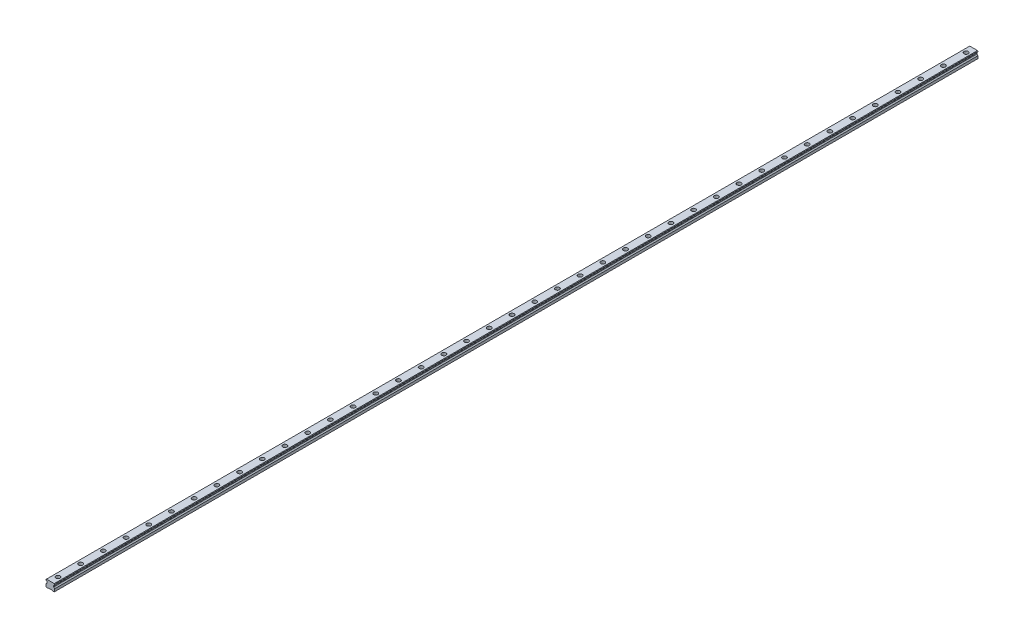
ISO-10303-21;
HEADER;
FILE_DESCRIPTION(('STEP AP214'),'2;1');
FILE_NAME('part.step','',(''),(''),'','','');
FILE_SCHEMA(('AUTOMOTIVE_DESIGN { 1 0 10303 214 1 1 1 1 }'));
ENDSEC;
DATA;
#1=APPLICATION_CONTEXT('core data for automotive mechanical design processes');
#2=APPLICATION_PROTOCOL_DEFINITION('international standard','automotive_design',2000,#1);
#3=PRODUCT_CONTEXT('',#1,'mechanical');
#4=PRODUCT('Part','Part','',(#3));
#5=PRODUCT_RELATED_PRODUCT_CATEGORY('part','',(#4));
#6=PRODUCT_DEFINITION_FORMATION('','',#4);
#7=PRODUCT_DEFINITION_CONTEXT('part definition',#1,'design');
#8=PRODUCT_DEFINITION('design','',#6,#7);
#9=PRODUCT_DEFINITION_SHAPE('','',#8);
#10=(LENGTH_UNIT() NAMED_UNIT(*) SI_UNIT(.MILLI.,.METRE.));
#11=(NAMED_UNIT(*) PLANE_ANGLE_UNIT() SI_UNIT($,.RADIAN.));
#12=(NAMED_UNIT(*) SI_UNIT($,.STERADIAN.) SOLID_ANGLE_UNIT());
#13=UNCERTAINTY_MEASURE_WITH_UNIT(LENGTH_MEASURE(1.E-05),#10,'distance_accuracy_value','');
#14=(GEOMETRIC_REPRESENTATION_CONTEXT(3) GLOBAL_UNCERTAINTY_ASSIGNED_CONTEXT((#13)) GLOBAL_UNIT_ASSIGNED_CONTEXT((#10,
#11,#12)) REPRESENTATION_CONTEXT('',''));
#15=CARTESIAN_POINT('',(0.,0.,0.));
#16=DIRECTION('',(0.,0.,1.));
#17=DIRECTION('',(1.,0.,0.));
#18=AXIS2_PLACEMENT_3D('',#15,#16,#17);
#19=CARTESIAN_POINT('',(0.,10.2,-1200.));
#20=DIRECTION('',(0.,1.,0.));
#21=DIRECTION('',(0.,0.,1.));
#22=AXIS2_PLACEMENT_3D('',#19,#20,#21);
#23=PLANE('',#22);
#24=CARTESIAN_POINT('',(0.,10.2,-1200.));
#25=DIRECTION('',(0.,1.,0.));
#26=DIRECTION('',(0.,0.,1.));
#27=AXIS2_PLACEMENT_3D('',#24,#25,#26);
#28=CIRCLE('',#27,3.49999999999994);
#29=CARTESIAN_POINT('',(0.,10.2,-1196.5));
#30=VERTEX_POINT('',#29);
#31=EDGE_CURVE('E669',#30,#30,#28,.T.);
#32=ORIENTED_EDGE('',*,*,#31,.F.);
#33=EDGE_LOOP('',(#32));
#34=FACE_BOUND('',#33,.T.);
#35=CARTESIAN_POINT('',(0.,10.2,-1200.));
#36=DIRECTION('',(0.,1.,0.));
#37=DIRECTION('',(0.,0.,1.));
#38=AXIS2_PLACEMENT_3D('',#35,#36,#37);
#39=CIRCLE('',#38,5.49999999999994);
#40=CARTESIAN_POINT('',(0.,10.2,-1194.5));
#41=VERTEX_POINT('',#40);
#42=EDGE_CURVE('E11',#41,#41,#39,.T.);
#43=ORIENTED_EDGE('',*,*,#42,.T.);
#44=EDGE_LOOP('',(#43));
#45=FACE_BOUND('',#44,.T.);
#46=ADVANCED_FACE('F39',(#34,#45),#23,.T.);
#47=CARTESIAN_POINT('',(0.,10.2,-1200.));
#48=DIRECTION('',(0.,1.,0.));
#49=DIRECTION('',(0.,0.,1.));
#50=AXIS2_PLACEMENT_3D('',#47,#48,#49);
#51=CYLINDRICAL_SURFACE('',#50,5.49999999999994);
#52=ORIENTED_EDGE('',*,*,#42,.F.);
#53=EDGE_LOOP('',(#52));
#54=FACE_BOUND('',#53,.T.);
#55=CARTESIAN_POINT('',(0.,19.2,-1200.));
#56=DIRECTION('',(0.,1.,0.));
#57=DIRECTION('',(0.,0.,1.));
#58=AXIS2_PLACEMENT_3D('',#55,#56,#57);
#59=CIRCLE('',#58,5.49999999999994);
#60=CARTESIAN_POINT('',(0.,19.2,-1194.5));
#61=VERTEX_POINT('',#60);
#62=EDGE_CURVE('E48',#61,#61,#59,.T.);
#63=ORIENTED_EDGE('',*,*,#62,.T.);
#64=EDGE_LOOP('',(#63));
#65=FACE_BOUND('',#64,.T.);
#66=ADVANCED_FACE('F1230',(#54,#65),#51,.F.);
#67=CARTESIAN_POINT('',(0.,10.2,-1140.));
#68=DIRECTION('',(0.,1.,0.));
#69=DIRECTION('',(0.,0.,1.));
#70=AXIS2_PLACEMENT_3D('',#67,#68,#69);
#71=PLANE('',#70);
#72=CARTESIAN_POINT('',(0.,10.2,-1140.));
#73=DIRECTION('',(0.,1.,0.));
#74=DIRECTION('',(0.,0.,1.));
#75=AXIS2_PLACEMENT_3D('',#72,#73,#74);
#76=CIRCLE('',#75,3.49999999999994);
#77=CARTESIAN_POINT('',(0.,10.2,-1136.5));
#78=VERTEX_POINT('',#77);
#79=EDGE_CURVE('E674',#78,#78,#76,.T.);
#80=ORIENTED_EDGE('',*,*,#79,.F.);
#81=EDGE_LOOP('',(#80));
#82=FACE_BOUND('',#81,.T.);
#83=CARTESIAN_POINT('',(0.,10.2,-1140.));
#84=DIRECTION('',(0.,1.,0.));
#85=DIRECTION('',(0.,0.,1.));
#86=AXIS2_PLACEMENT_3D('',#83,#84,#85);
#87=CIRCLE('',#86,5.49999999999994);
#88=CARTESIAN_POINT('',(0.,10.2,-1134.5));
#89=VERTEX_POINT('',#88);
#90=EDGE_CURVE('E653',#89,#89,#87,.T.);
#91=ORIENTED_EDGE('',*,*,#90,.T.);
#92=EDGE_LOOP('',(#91));
#93=FACE_BOUND('',#92,.T.);
#94=ADVANCED_FACE('F1232',(#82,#93),#71,.T.);
#95=CARTESIAN_POINT('',(0.,10.2,-1140.));
#96=DIRECTION('',(0.,1.,0.));
#97=DIRECTION('',(0.,0.,1.));
#98=AXIS2_PLACEMENT_3D('',#95,#96,#97);
#99=CYLINDRICAL_SURFACE('',#98,5.49999999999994);
#100=ORIENTED_EDGE('',*,*,#90,.F.);
#101=EDGE_LOOP('',(#100));
#102=FACE_BOUND('',#101,.T.);
#103=CARTESIAN_POINT('',(0.,19.2,-1140.));
#104=DIRECTION('',(0.,1.,0.));
#105=DIRECTION('',(0.,0.,1.));
#106=AXIS2_PLACEMENT_3D('',#103,#104,#105);
#107=CIRCLE('',#106,5.49999999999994);
#108=CARTESIAN_POINT('',(0.,19.2,-1134.5));
#109=VERTEX_POINT('',#108);
#110=EDGE_CURVE('E649',#109,#109,#107,.T.);
#111=ORIENTED_EDGE('',*,*,#110,.T.);
#112=EDGE_LOOP('',(#111));
#113=FACE_BOUND('',#112,.T.);
#114=ADVANCED_FACE('F1238',(#102,#113),#99,.F.);
#115=CARTESIAN_POINT('',(0.,10.2,-1080.));
#116=DIRECTION('',(0.,1.,0.));
#117=DIRECTION('',(0.,0.,1.));
#118=AXIS2_PLACEMENT_3D('',#115,#116,#117);
#119=PLANE('',#118);
#120=CARTESIAN_POINT('',(0.,10.2,-1080.));
#121=DIRECTION('',(0.,1.,0.));
#122=DIRECTION('',(0.,0.,1.));
#123=AXIS2_PLACEMENT_3D('',#120,#121,#122);
#124=CIRCLE('',#123,3.49999999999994);
#125=CARTESIAN_POINT('',(0.,10.2,-1076.5));
#126=VERTEX_POINT('',#125);
#127=EDGE_CURVE('E679',#126,#126,#124,.T.);
#128=ORIENTED_EDGE('',*,*,#127,.F.);
#129=EDGE_LOOP('',(#128));
#130=FACE_BOUND('',#129,.T.);
#131=CARTESIAN_POINT('',(0.,10.2,-1080.));
#132=DIRECTION('',(0.,1.,0.));
#133=DIRECTION('',(0.,0.,1.));
#134=AXIS2_PLACEMENT_3D('',#131,#132,#133);
#135=CIRCLE('',#134,5.49999999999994);
#136=CARTESIAN_POINT('',(0.,10.2,-1074.5));
#137=VERTEX_POINT('',#136);
#138=EDGE_CURVE('E645',#137,#137,#135,.T.);
#139=ORIENTED_EDGE('',*,*,#138,.T.);
#140=EDGE_LOOP('',(#139));
#141=FACE_BOUND('',#140,.T.);
#142=ADVANCED_FACE('F1246',(#130,#141),#119,.T.);
#143=CARTESIAN_POINT('',(0.,10.2,-1080.));
#144=DIRECTION('',(0.,1.,0.));
#145=DIRECTION('',(0.,0.,1.));
#146=AXIS2_PLACEMENT_3D('',#143,#144,#145);
#147=CYLINDRICAL_SURFACE('',#146,5.49999999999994);
#148=ORIENTED_EDGE('',*,*,#138,.F.);
#149=EDGE_LOOP('',(#148));
#150=FACE_BOUND('',#149,.T.);
#151=CARTESIAN_POINT('',(0.,19.2,-1080.));
#152=DIRECTION('',(0.,1.,0.));
#153=DIRECTION('',(0.,0.,1.));
#154=AXIS2_PLACEMENT_3D('',#151,#152,#153);
#155=CIRCLE('',#154,5.49999999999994);
#156=CARTESIAN_POINT('',(0.,19.2,-1074.5));
#157=VERTEX_POINT('',#156);
#158=EDGE_CURVE('E641',#157,#157,#155,.T.);
#159=ORIENTED_EDGE('',*,*,#158,.T.);
#160=EDGE_LOOP('',(#159));
#161=FACE_BOUND('',#160,.T.);
#162=ADVANCED_FACE('F1250',(#150,#161),#147,.F.);
#163=CARTESIAN_POINT('',(0.,10.2,-1020.));
#164=DIRECTION('',(0.,1.,0.));
#165=DIRECTION('',(0.,0.,1.));
#166=AXIS2_PLACEMENT_3D('',#163,#164,#165);
#167=PLANE('',#166);
#168=CARTESIAN_POINT('',(0.,10.2,-1020.));
#169=DIRECTION('',(0.,1.,0.));
#170=DIRECTION('',(0.,0.,1.));
#171=AXIS2_PLACEMENT_3D('',#168,#169,#170);
#172=CIRCLE('',#171,3.49999999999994);
#173=CARTESIAN_POINT('',(0.,10.2,-1016.5));
#174=VERTEX_POINT('',#173);
#175=EDGE_CURVE('E684',#174,#174,#172,.T.);
#176=ORIENTED_EDGE('',*,*,#175,.F.);
#177=EDGE_LOOP('',(#176));
#178=FACE_BOUND('',#177,.T.);
#179=CARTESIAN_POINT('',(0.,10.2,-1020.));
#180=DIRECTION('',(0.,1.,0.));
#181=DIRECTION('',(0.,0.,1.));
#182=AXIS2_PLACEMENT_3D('',#179,#180,#181);
#183=CIRCLE('',#182,5.49999999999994);
#184=CARTESIAN_POINT('',(0.,10.2,-1014.5));
#185=VERTEX_POINT('',#184);
#186=EDGE_CURVE('E637',#185,#185,#183,.T.);
#187=ORIENTED_EDGE('',*,*,#186,.T.);
#188=EDGE_LOOP('',(#187));
#189=FACE_BOUND('',#188,.T.);
#190=ADVANCED_FACE('F1254',(#178,#189),#167,.T.);
#191=CARTESIAN_POINT('',(0.,10.2,-1020.));
#192=DIRECTION('',(0.,1.,0.));
#193=DIRECTION('',(0.,0.,1.));
#194=AXIS2_PLACEMENT_3D('',#191,#192,#193);
#195=CYLINDRICAL_SURFACE('',#194,5.49999999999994);
#196=ORIENTED_EDGE('',*,*,#186,.F.);
#197=EDGE_LOOP('',(#196));
#198=FACE_BOUND('',#197,.T.);
#199=CARTESIAN_POINT('',(0.,19.2,-1020.));
#200=DIRECTION('',(0.,1.,0.));
#201=DIRECTION('',(0.,0.,1.));
#202=AXIS2_PLACEMENT_3D('',#199,#200,#201);
#203=CIRCLE('',#202,5.49999999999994);
#204=CARTESIAN_POINT('',(0.,19.2,-1014.5));
#205=VERTEX_POINT('',#204);
#206=EDGE_CURVE('E633',#205,#205,#203,.T.);
#207=ORIENTED_EDGE('',*,*,#206,.T.);
#208=EDGE_LOOP('',(#207));
#209=FACE_BOUND('',#208,.T.);
#210=ADVANCED_FACE('F1258',(#198,#209),#195,.F.);
#211=CARTESIAN_POINT('',(0.,10.2,-960.));
#212=DIRECTION('',(0.,1.,0.));
#213=DIRECTION('',(0.,0.,1.));
#214=AXIS2_PLACEMENT_3D('',#211,#212,#213);
#215=PLANE('',#214);
#216=CARTESIAN_POINT('',(0.,10.2,-960.));
#217=DIRECTION('',(0.,1.,0.));
#218=DIRECTION('',(0.,0.,1.));
#219=AXIS2_PLACEMENT_3D('',#216,#217,#218);
#220=CIRCLE('',#219,3.49999999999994);
#221=CARTESIAN_POINT('',(0.,10.2,-956.5));
#222=VERTEX_POINT('',#221);
#223=EDGE_CURVE('E689',#222,#222,#220,.T.);
#224=ORIENTED_EDGE('',*,*,#223,.F.);
#225=EDGE_LOOP('',(#224));
#226=FACE_BOUND('',#225,.T.);
#227=CARTESIAN_POINT('',(0.,10.2,-960.));
#228=DIRECTION('',(0.,1.,0.));
#229=DIRECTION('',(0.,0.,1.));
#230=AXIS2_PLACEMENT_3D('',#227,#228,#229);
#231=CIRCLE('',#230,5.49999999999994);
#232=CARTESIAN_POINT('',(0.,10.2,-954.5));
#233=VERTEX_POINT('',#232);
#234=EDGE_CURVE('E629',#233,#233,#231,.T.);
#235=ORIENTED_EDGE('',*,*,#234,.T.);
#236=EDGE_LOOP('',(#235));
#237=FACE_BOUND('',#236,.T.);
#238=ADVANCED_FACE('F1262',(#226,#237),#215,.T.);
#239=CARTESIAN_POINT('',(0.,10.2,-960.));
#240=DIRECTION('',(0.,1.,0.));
#241=DIRECTION('',(0.,0.,1.));
#242=AXIS2_PLACEMENT_3D('',#239,#240,#241);
#243=CYLINDRICAL_SURFACE('',#242,5.49999999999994);
#244=ORIENTED_EDGE('',*,*,#234,.F.);
#245=EDGE_LOOP('',(#244));
#246=FACE_BOUND('',#245,.T.);
#247=CARTESIAN_POINT('',(0.,19.2,-960.));
#248=DIRECTION('',(0.,1.,0.));
#249=DIRECTION('',(0.,0.,1.));
#250=AXIS2_PLACEMENT_3D('',#247,#248,#249);
#251=CIRCLE('',#250,5.49999999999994);
#252=CARTESIAN_POINT('',(0.,19.2,-954.5));
#253=VERTEX_POINT('',#252);
#254=EDGE_CURVE('E625',#253,#253,#251,.T.);
#255=ORIENTED_EDGE('',*,*,#254,.T.);
#256=EDGE_LOOP('',(#255));
#257=FACE_BOUND('',#256,.T.);
#258=ADVANCED_FACE('F1266',(#246,#257),#243,.F.);
#259=CARTESIAN_POINT('',(0.,10.2,-900.));
#260=DIRECTION('',(0.,1.,0.));
#261=DIRECTION('',(0.,0.,1.));
#262=AXIS2_PLACEMENT_3D('',#259,#260,#261);
#263=PLANE('',#262);
#264=CARTESIAN_POINT('',(0.,10.2,-900.));
#265=DIRECTION('',(0.,1.,0.));
#266=DIRECTION('',(0.,0.,1.));
#267=AXIS2_PLACEMENT_3D('',#264,#265,#266);
#268=CIRCLE('',#267,3.49999999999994);
#269=CARTESIAN_POINT('',(0.,10.2,-896.5));
#270=VERTEX_POINT('',#269);
#271=EDGE_CURVE('E694',#270,#270,#268,.T.);
#272=ORIENTED_EDGE('',*,*,#271,.F.);
#273=EDGE_LOOP('',(#272));
#274=FACE_BOUND('',#273,.T.);
#275=CARTESIAN_POINT('',(0.,10.2,-900.));
#276=DIRECTION('',(0.,1.,0.));
#277=DIRECTION('',(0.,0.,1.));
#278=AXIS2_PLACEMENT_3D('',#275,#276,#277);
#279=CIRCLE('',#278,5.49999999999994);
#280=CARTESIAN_POINT('',(0.,10.2,-894.5));
#281=VERTEX_POINT('',#280);
#282=EDGE_CURVE('E621',#281,#281,#279,.T.);
#283=ORIENTED_EDGE('',*,*,#282,.T.);
#284=EDGE_LOOP('',(#283));
#285=FACE_BOUND('',#284,.T.);
#286=ADVANCED_FACE('F1270',(#274,#285),#263,.T.);
#287=CARTESIAN_POINT('',(0.,10.2,-900.));
#288=DIRECTION('',(0.,1.,0.));
#289=DIRECTION('',(0.,0.,1.));
#290=AXIS2_PLACEMENT_3D('',#287,#288,#289);
#291=CYLINDRICAL_SURFACE('',#290,5.49999999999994);
#292=ORIENTED_EDGE('',*,*,#282,.F.);
#293=EDGE_LOOP('',(#292));
#294=FACE_BOUND('',#293,.T.);
#295=CARTESIAN_POINT('',(0.,19.2,-900.));
#296=DIRECTION('',(0.,1.,0.));
#297=DIRECTION('',(0.,0.,1.));
#298=AXIS2_PLACEMENT_3D('',#295,#296,#297);
#299=CIRCLE('',#298,5.49999999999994);
#300=CARTESIAN_POINT('',(0.,19.2,-894.5));
#301=VERTEX_POINT('',#300);
#302=EDGE_CURVE('E617',#301,#301,#299,.T.);
#303=ORIENTED_EDGE('',*,*,#302,.T.);
#304=EDGE_LOOP('',(#303));
#305=FACE_BOUND('',#304,.T.);
#306=ADVANCED_FACE('F1274',(#294,#305),#291,.F.);
#307=CARTESIAN_POINT('',(0.,10.2,-840.));
#308=DIRECTION('',(0.,1.,0.));
#309=DIRECTION('',(0.,0.,1.));
#310=AXIS2_PLACEMENT_3D('',#307,#308,#309);
#311=PLANE('',#310);
#312=CARTESIAN_POINT('',(0.,10.2,-840.));
#313=DIRECTION('',(0.,1.,0.));
#314=DIRECTION('',(0.,0.,1.));
#315=AXIS2_PLACEMENT_3D('',#312,#313,#314);
#316=CIRCLE('',#315,3.49999999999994);
#317=CARTESIAN_POINT('',(0.,10.2,-836.5));
#318=VERTEX_POINT('',#317);
#319=EDGE_CURVE('E699',#318,#318,#316,.T.);
#320=ORIENTED_EDGE('',*,*,#319,.F.);
#321=EDGE_LOOP('',(#320));
#322=FACE_BOUND('',#321,.T.);
#323=CARTESIAN_POINT('',(0.,10.2,-840.));
#324=DIRECTION('',(0.,1.,0.));
#325=DIRECTION('',(0.,0.,1.));
#326=AXIS2_PLACEMENT_3D('',#323,#324,#325);
#327=CIRCLE('',#326,5.49999999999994);
#328=CARTESIAN_POINT('',(0.,10.2,-834.5));
#329=VERTEX_POINT('',#328);
#330=EDGE_CURVE('E613',#329,#329,#327,.T.);
#331=ORIENTED_EDGE('',*,*,#330,.T.);
#332=EDGE_LOOP('',(#331));
#333=FACE_BOUND('',#332,.T.);
#334=ADVANCED_FACE('F1278',(#322,#333),#311,.T.);
#335=CARTESIAN_POINT('',(0.,10.2,-840.));
#336=DIRECTION('',(0.,1.,0.));
#337=DIRECTION('',(0.,0.,1.));
#338=AXIS2_PLACEMENT_3D('',#335,#336,#337);
#339=CYLINDRICAL_SURFACE('',#338,5.49999999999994);
#340=ORIENTED_EDGE('',*,*,#330,.F.);
#341=EDGE_LOOP('',(#340));
#342=FACE_BOUND('',#341,.T.);
#343=CARTESIAN_POINT('',(0.,19.2,-840.));
#344=DIRECTION('',(0.,1.,0.));
#345=DIRECTION('',(0.,0.,1.));
#346=AXIS2_PLACEMENT_3D('',#343,#344,#345);
#347=CIRCLE('',#346,5.49999999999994);
#348=CARTESIAN_POINT('',(0.,19.2,-834.5));
#349=VERTEX_POINT('',#348);
#350=EDGE_CURVE('E609',#349,#349,#347,.T.);
#351=ORIENTED_EDGE('',*,*,#350,.T.);
#352=EDGE_LOOP('',(#351));
#353=FACE_BOUND('',#352,.T.);
#354=ADVANCED_FACE('F1282',(#342,#353),#339,.F.);
#355=CARTESIAN_POINT('',(0.,10.2,-780.));
#356=DIRECTION('',(0.,1.,0.));
#357=DIRECTION('',(0.,0.,1.));
#358=AXIS2_PLACEMENT_3D('',#355,#356,#357);
#359=PLANE('',#358);
#360=CARTESIAN_POINT('',(0.,10.2,-780.));
#361=DIRECTION('',(0.,1.,0.));
#362=DIRECTION('',(0.,0.,1.));
#363=AXIS2_PLACEMENT_3D('',#360,#361,#362);
#364=CIRCLE('',#363,3.49999999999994);
#365=CARTESIAN_POINT('',(0.,10.2,-776.5));
#366=VERTEX_POINT('',#365);
#367=EDGE_CURVE('E704',#366,#366,#364,.T.);
#368=ORIENTED_EDGE('',*,*,#367,.F.);
#369=EDGE_LOOP('',(#368));
#370=FACE_BOUND('',#369,.T.);
#371=CARTESIAN_POINT('',(0.,10.2,-780.));
#372=DIRECTION('',(0.,1.,0.));
#373=DIRECTION('',(0.,0.,1.));
#374=AXIS2_PLACEMENT_3D('',#371,#372,#373);
#375=CIRCLE('',#374,5.49999999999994);
#376=CARTESIAN_POINT('',(0.,10.2,-774.5));
#377=VERTEX_POINT('',#376);
#378=EDGE_CURVE('E605',#377,#377,#375,.T.);
#379=ORIENTED_EDGE('',*,*,#378,.T.);
#380=EDGE_LOOP('',(#379));
#381=FACE_BOUND('',#380,.T.);
#382=ADVANCED_FACE('F1286',(#370,#381),#359,.T.);
#383=CARTESIAN_POINT('',(0.,10.2,-780.));
#384=DIRECTION('',(0.,1.,0.));
#385=DIRECTION('',(0.,0.,1.));
#386=AXIS2_PLACEMENT_3D('',#383,#384,#385);
#387=CYLINDRICAL_SURFACE('',#386,5.49999999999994);
#388=ORIENTED_EDGE('',*,*,#378,.F.);
#389=EDGE_LOOP('',(#388));
#390=FACE_BOUND('',#389,.T.);
#391=CARTESIAN_POINT('',(0.,19.2,-780.));
#392=DIRECTION('',(0.,1.,0.));
#393=DIRECTION('',(0.,0.,1.));
#394=AXIS2_PLACEMENT_3D('',#391,#392,#393);
#395=CIRCLE('',#394,5.49999999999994);
#396=CARTESIAN_POINT('',(0.,19.2,-774.5));
#397=VERTEX_POINT('',#396);
#398=EDGE_CURVE('E601',#397,#397,#395,.T.);
#399=ORIENTED_EDGE('',*,*,#398,.T.);
#400=EDGE_LOOP('',(#399));
#401=FACE_BOUND('',#400,.T.);
#402=ADVANCED_FACE('F1290',(#390,#401),#387,.F.);
#403=CARTESIAN_POINT('',(0.,10.2,-720.));
#404=DIRECTION('',(0.,1.,0.));
#405=DIRECTION('',(0.,0.,1.));
#406=AXIS2_PLACEMENT_3D('',#403,#404,#405);
#407=PLANE('',#406);
#408=CARTESIAN_POINT('',(0.,10.2,-720.));
#409=DIRECTION('',(0.,1.,0.));
#410=DIRECTION('',(0.,0.,1.));
#411=AXIS2_PLACEMENT_3D('',#408,#409,#410);
#412=CIRCLE('',#411,3.49999999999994);
#413=CARTESIAN_POINT('',(0.,10.2,-716.5));
#414=VERTEX_POINT('',#413);
#415=EDGE_CURVE('E709',#414,#414,#412,.T.);
#416=ORIENTED_EDGE('',*,*,#415,.F.);
#417=EDGE_LOOP('',(#416));
#418=FACE_BOUND('',#417,.T.);
#419=CARTESIAN_POINT('',(0.,10.2,-720.));
#420=DIRECTION('',(0.,1.,0.));
#421=DIRECTION('',(0.,0.,1.));
#422=AXIS2_PLACEMENT_3D('',#419,#420,#421);
#423=CIRCLE('',#422,5.49999999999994);
#424=CARTESIAN_POINT('',(0.,10.2,-714.5));
#425=VERTEX_POINT('',#424);
#426=EDGE_CURVE('E597',#425,#425,#423,.T.);
#427=ORIENTED_EDGE('',*,*,#426,.T.);
#428=EDGE_LOOP('',(#427));
#429=FACE_BOUND('',#428,.T.);
#430=ADVANCED_FACE('F1294',(#418,#429),#407,.T.);
#431=CARTESIAN_POINT('',(0.,10.2,-720.));
#432=DIRECTION('',(0.,1.,0.));
#433=DIRECTION('',(0.,0.,1.));
#434=AXIS2_PLACEMENT_3D('',#431,#432,#433);
#435=CYLINDRICAL_SURFACE('',#434,5.49999999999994);
#436=ORIENTED_EDGE('',*,*,#426,.F.);
#437=EDGE_LOOP('',(#436));
#438=FACE_BOUND('',#437,.T.);
#439=CARTESIAN_POINT('',(0.,19.2,-720.));
#440=DIRECTION('',(0.,1.,0.));
#441=DIRECTION('',(0.,0.,1.));
#442=AXIS2_PLACEMENT_3D('',#439,#440,#441);
#443=CIRCLE('',#442,5.49999999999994);
#444=CARTESIAN_POINT('',(0.,19.2,-714.5));
#445=VERTEX_POINT('',#444);
#446=EDGE_CURVE('E593',#445,#445,#443,.T.);
#447=ORIENTED_EDGE('',*,*,#446,.T.);
#448=EDGE_LOOP('',(#447));
#449=FACE_BOUND('',#448,.T.);
#450=ADVANCED_FACE('F1298',(#438,#449),#435,.F.);
#451=CARTESIAN_POINT('',(0.,10.2,-660.));
#452=DIRECTION('',(0.,1.,0.));
#453=DIRECTION('',(0.,0.,1.));
#454=AXIS2_PLACEMENT_3D('',#451,#452,#453);
#455=PLANE('',#454);
#456=CARTESIAN_POINT('',(0.,10.2,-660.));
#457=DIRECTION('',(0.,1.,0.));
#458=DIRECTION('',(0.,0.,1.));
#459=AXIS2_PLACEMENT_3D('',#456,#457,#458);
#460=CIRCLE('',#459,3.49999999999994);
#461=CARTESIAN_POINT('',(0.,10.2,-656.5));
#462=VERTEX_POINT('',#461);
#463=EDGE_CURVE('E714',#462,#462,#460,.T.);
#464=ORIENTED_EDGE('',*,*,#463,.F.);
#465=EDGE_LOOP('',(#464));
#466=FACE_BOUND('',#465,.T.);
#467=CARTESIAN_POINT('',(0.,10.2,-660.));
#468=DIRECTION('',(0.,1.,0.));
#469=DIRECTION('',(0.,0.,1.));
#470=AXIS2_PLACEMENT_3D('',#467,#468,#469);
#471=CIRCLE('',#470,5.49999999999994);
#472=CARTESIAN_POINT('',(0.,10.2,-654.5));
#473=VERTEX_POINT('',#472);
#474=EDGE_CURVE('E589',#473,#473,#471,.T.);
#475=ORIENTED_EDGE('',*,*,#474,.T.);
#476=EDGE_LOOP('',(#475));
#477=FACE_BOUND('',#476,.T.);
#478=ADVANCED_FACE('F1302',(#466,#477),#455,.T.);
#479=CARTESIAN_POINT('',(0.,10.2,-660.));
#480=DIRECTION('',(0.,1.,0.));
#481=DIRECTION('',(0.,0.,1.));
#482=AXIS2_PLACEMENT_3D('',#479,#480,#481);
#483=CYLINDRICAL_SURFACE('',#482,5.49999999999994);
#484=ORIENTED_EDGE('',*,*,#474,.F.);
#485=EDGE_LOOP('',(#484));
#486=FACE_BOUND('',#485,.T.);
#487=CARTESIAN_POINT('',(0.,19.2,-660.));
#488=DIRECTION('',(0.,1.,0.));
#489=DIRECTION('',(0.,0.,1.));
#490=AXIS2_PLACEMENT_3D('',#487,#488,#489);
#491=CIRCLE('',#490,5.49999999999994);
#492=CARTESIAN_POINT('',(0.,19.2,-654.5));
#493=VERTEX_POINT('',#492);
#494=EDGE_CURVE('E585',#493,#493,#491,.T.);
#495=ORIENTED_EDGE('',*,*,#494,.T.);
#496=EDGE_LOOP('',(#495));
#497=FACE_BOUND('',#496,.T.);
#498=ADVANCED_FACE('F1306',(#486,#497),#483,.F.);
#499=CARTESIAN_POINT('',(0.,10.2,-600.));
#500=DIRECTION('',(0.,1.,0.));
#501=DIRECTION('',(0.,0.,1.));
#502=AXIS2_PLACEMENT_3D('',#499,#500,#501);
#503=PLANE('',#502);
#504=CARTESIAN_POINT('',(0.,10.2,-600.));
#505=DIRECTION('',(0.,1.,0.));
#506=DIRECTION('',(0.,0.,1.));
#507=AXIS2_PLACEMENT_3D('',#504,#505,#506);
#508=CIRCLE('',#507,3.49999999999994);
#509=CARTESIAN_POINT('',(0.,10.2,-596.5));
#510=VERTEX_POINT('',#509);
#511=EDGE_CURVE('E719',#510,#510,#508,.T.);
#512=ORIENTED_EDGE('',*,*,#511,.F.);
#513=EDGE_LOOP('',(#512));
#514=FACE_BOUND('',#513,.T.);
#515=CARTESIAN_POINT('',(0.,10.2,-600.));
#516=DIRECTION('',(0.,1.,0.));
#517=DIRECTION('',(0.,0.,1.));
#518=AXIS2_PLACEMENT_3D('',#515,#516,#517);
#519=CIRCLE('',#518,5.49999999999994);
#520=CARTESIAN_POINT('',(0.,10.2,-594.5));
#521=VERTEX_POINT('',#520);
#522=EDGE_CURVE('E581',#521,#521,#519,.T.);
#523=ORIENTED_EDGE('',*,*,#522,.T.);
#524=EDGE_LOOP('',(#523));
#525=FACE_BOUND('',#524,.T.);
#526=ADVANCED_FACE('F1310',(#514,#525),#503,.T.);
#527=CARTESIAN_POINT('',(0.,10.2,-600.));
#528=DIRECTION('',(0.,1.,0.));
#529=DIRECTION('',(0.,0.,1.));
#530=AXIS2_PLACEMENT_3D('',#527,#528,#529);
#531=CYLINDRICAL_SURFACE('',#530,5.49999999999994);
#532=ORIENTED_EDGE('',*,*,#522,.F.);
#533=EDGE_LOOP('',(#532));
#534=FACE_BOUND('',#533,.T.);
#535=CARTESIAN_POINT('',(0.,19.2,-600.));
#536=DIRECTION('',(0.,1.,0.));
#537=DIRECTION('',(0.,0.,1.));
#538=AXIS2_PLACEMENT_3D('',#535,#536,#537);
#539=CIRCLE('',#538,5.49999999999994);
#540=CARTESIAN_POINT('',(0.,19.2,-594.5));
#541=VERTEX_POINT('',#540);
#542=EDGE_CURVE('E577',#541,#541,#539,.T.);
#543=ORIENTED_EDGE('',*,*,#542,.T.);
#544=EDGE_LOOP('',(#543));
#545=FACE_BOUND('',#544,.T.);
#546=ADVANCED_FACE('F1314',(#534,#545),#531,.F.);
#547=CARTESIAN_POINT('',(0.,10.2,-540.));
#548=DIRECTION('',(0.,1.,0.));
#549=DIRECTION('',(0.,0.,1.));
#550=AXIS2_PLACEMENT_3D('',#547,#548,#549);
#551=PLANE('',#550);
#552=CARTESIAN_POINT('',(0.,10.2,-540.));
#553=DIRECTION('',(0.,1.,0.));
#554=DIRECTION('',(0.,0.,1.));
#555=AXIS2_PLACEMENT_3D('',#552,#553,#554);
#556=CIRCLE('',#555,3.49999999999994);
#557=CARTESIAN_POINT('',(0.,10.2,-536.5));
#558=VERTEX_POINT('',#557);
#559=EDGE_CURVE('E724',#558,#558,#556,.T.);
#560=ORIENTED_EDGE('',*,*,#559,.F.);
#561=EDGE_LOOP('',(#560));
#562=FACE_BOUND('',#561,.T.);
#563=CARTESIAN_POINT('',(0.,10.2,-540.));
#564=DIRECTION('',(0.,1.,0.));
#565=DIRECTION('',(0.,0.,1.));
#566=AXIS2_PLACEMENT_3D('',#563,#564,#565);
#567=CIRCLE('',#566,5.49999999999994);
#568=CARTESIAN_POINT('',(0.,10.2,-534.5));
#569=VERTEX_POINT('',#568);
#570=EDGE_CURVE('E573',#569,#569,#567,.T.);
#571=ORIENTED_EDGE('',*,*,#570,.T.);
#572=EDGE_LOOP('',(#571));
#573=FACE_BOUND('',#572,.T.);
#574=ADVANCED_FACE('F1318',(#562,#573),#551,.T.);
#575=CARTESIAN_POINT('',(0.,10.2,-540.));
#576=DIRECTION('',(0.,1.,0.));
#577=DIRECTION('',(0.,0.,1.));
#578=AXIS2_PLACEMENT_3D('',#575,#576,#577);
#579=CYLINDRICAL_SURFACE('',#578,5.49999999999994);
#580=ORIENTED_EDGE('',*,*,#570,.F.);
#581=EDGE_LOOP('',(#580));
#582=FACE_BOUND('',#581,.T.);
#583=CARTESIAN_POINT('',(0.,19.2,-540.));
#584=DIRECTION('',(0.,1.,0.));
#585=DIRECTION('',(0.,0.,1.));
#586=AXIS2_PLACEMENT_3D('',#583,#584,#585);
#587=CIRCLE('',#586,5.49999999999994);
#588=CARTESIAN_POINT('',(0.,19.2,-534.5));
#589=VERTEX_POINT('',#588);
#590=EDGE_CURVE('E569',#589,#589,#587,.T.);
#591=ORIENTED_EDGE('',*,*,#590,.T.);
#592=EDGE_LOOP('',(#591));
#593=FACE_BOUND('',#592,.T.);
#594=ADVANCED_FACE('F1322',(#582,#593),#579,.F.);
#595=CARTESIAN_POINT('',(0.,10.2,-480.));
#596=DIRECTION('',(0.,1.,0.));
#597=DIRECTION('',(0.,0.,1.));
#598=AXIS2_PLACEMENT_3D('',#595,#596,#597);
#599=PLANE('',#598);
#600=CARTESIAN_POINT('',(0.,10.2,-480.));
#601=DIRECTION('',(0.,1.,0.));
#602=DIRECTION('',(0.,0.,1.));
#603=AXIS2_PLACEMENT_3D('',#600,#601,#602);
#604=CIRCLE('',#603,3.49999999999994);
#605=CARTESIAN_POINT('',(0.,10.2,-476.5));
#606=VERTEX_POINT('',#605);
#607=EDGE_CURVE('E729',#606,#606,#604,.T.);
#608=ORIENTED_EDGE('',*,*,#607,.F.);
#609=EDGE_LOOP('',(#608));
#610=FACE_BOUND('',#609,.T.);
#611=CARTESIAN_POINT('',(0.,10.2,-480.));
#612=DIRECTION('',(0.,1.,0.));
#613=DIRECTION('',(0.,0.,1.));
#614=AXIS2_PLACEMENT_3D('',#611,#612,#613);
#615=CIRCLE('',#614,5.49999999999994);
#616=CARTESIAN_POINT('',(0.,10.2,-474.5));
#617=VERTEX_POINT('',#616);
#618=EDGE_CURVE('E565',#617,#617,#615,.T.);
#619=ORIENTED_EDGE('',*,*,#618,.T.);
#620=EDGE_LOOP('',(#619));
#621=FACE_BOUND('',#620,.T.);
#622=ADVANCED_FACE('F1326',(#610,#621),#599,.T.);
#623=CARTESIAN_POINT('',(0.,10.2,-480.));
#624=DIRECTION('',(0.,1.,0.));
#625=DIRECTION('',(0.,0.,1.));
#626=AXIS2_PLACEMENT_3D('',#623,#624,#625);
#627=CYLINDRICAL_SURFACE('',#626,5.49999999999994);
#628=ORIENTED_EDGE('',*,*,#618,.F.);
#629=EDGE_LOOP('',(#628));
#630=FACE_BOUND('',#629,.T.);
#631=CARTESIAN_POINT('',(0.,19.2,-480.));
#632=DIRECTION('',(0.,1.,0.));
#633=DIRECTION('',(0.,0.,1.));
#634=AXIS2_PLACEMENT_3D('',#631,#632,#633);
#635=CIRCLE('',#634,5.49999999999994);
#636=CARTESIAN_POINT('',(0.,19.2,-474.5));
#637=VERTEX_POINT('',#636);
#638=EDGE_CURVE('E561',#637,#637,#635,.T.);
#639=ORIENTED_EDGE('',*,*,#638,.T.);
#640=EDGE_LOOP('',(#639));
#641=FACE_BOUND('',#640,.T.);
#642=ADVANCED_FACE('F1330',(#630,#641),#627,.F.);
#643=CARTESIAN_POINT('',(0.,10.2,-420.));
#644=DIRECTION('',(0.,1.,0.));
#645=DIRECTION('',(0.,0.,1.));
#646=AXIS2_PLACEMENT_3D('',#643,#644,#645);
#647=PLANE('',#646);
#648=CARTESIAN_POINT('',(0.,10.2,-420.));
#649=DIRECTION('',(0.,1.,0.));
#650=DIRECTION('',(0.,0.,1.));
#651=AXIS2_PLACEMENT_3D('',#648,#649,#650);
#652=CIRCLE('',#651,3.49999999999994);
#653=CARTESIAN_POINT('',(0.,10.2,-416.5));
#654=VERTEX_POINT('',#653);
#655=EDGE_CURVE('E734',#654,#654,#652,.T.);
#656=ORIENTED_EDGE('',*,*,#655,.F.);
#657=EDGE_LOOP('',(#656));
#658=FACE_BOUND('',#657,.T.);
#659=CARTESIAN_POINT('',(0.,10.2,-420.));
#660=DIRECTION('',(0.,1.,0.));
#661=DIRECTION('',(0.,0.,1.));
#662=AXIS2_PLACEMENT_3D('',#659,#660,#661);
#663=CIRCLE('',#662,5.49999999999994);
#664=CARTESIAN_POINT('',(0.,10.2,-414.5));
#665=VERTEX_POINT('',#664);
#666=EDGE_CURVE('E557',#665,#665,#663,.T.);
#667=ORIENTED_EDGE('',*,*,#666,.T.);
#668=EDGE_LOOP('',(#667));
#669=FACE_BOUND('',#668,.T.);
#670=ADVANCED_FACE('F1334',(#658,#669),#647,.T.);
#671=CARTESIAN_POINT('',(0.,10.2,-420.));
#672=DIRECTION('',(0.,1.,0.));
#673=DIRECTION('',(0.,0.,1.));
#674=AXIS2_PLACEMENT_3D('',#671,#672,#673);
#675=CYLINDRICAL_SURFACE('',#674,5.49999999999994);
#676=ORIENTED_EDGE('',*,*,#666,.F.);
#677=EDGE_LOOP('',(#676));
#678=FACE_BOUND('',#677,.T.);
#679=CARTESIAN_POINT('',(0.,19.2,-420.));
#680=DIRECTION('',(0.,1.,0.));
#681=DIRECTION('',(0.,0.,1.));
#682=AXIS2_PLACEMENT_3D('',#679,#680,#681);
#683=CIRCLE('',#682,5.49999999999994);
#684=CARTESIAN_POINT('',(0.,19.2,-414.5));
#685=VERTEX_POINT('',#684);
#686=EDGE_CURVE('E553',#685,#685,#683,.T.);
#687=ORIENTED_EDGE('',*,*,#686,.T.);
#688=EDGE_LOOP('',(#687));
#689=FACE_BOUND('',#688,.T.);
#690=ADVANCED_FACE('F1338',(#678,#689),#675,.F.);
#691=CARTESIAN_POINT('',(0.,10.2,-360.));
#692=DIRECTION('',(0.,1.,0.));
#693=DIRECTION('',(0.,0.,1.));
#694=AXIS2_PLACEMENT_3D('',#691,#692,#693);
#695=PLANE('',#694);
#696=CARTESIAN_POINT('',(0.,10.2,-360.));
#697=DIRECTION('',(0.,1.,0.));
#698=DIRECTION('',(0.,0.,1.));
#699=AXIS2_PLACEMENT_3D('',#696,#697,#698);
#700=CIRCLE('',#699,3.49999999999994);
#701=CARTESIAN_POINT('',(0.,10.2,-356.5));
#702=VERTEX_POINT('',#701);
#703=EDGE_CURVE('E739',#702,#702,#700,.T.);
#704=ORIENTED_EDGE('',*,*,#703,.F.);
#705=EDGE_LOOP('',(#704));
#706=FACE_BOUND('',#705,.T.);
#707=CARTESIAN_POINT('',(0.,10.2,-360.));
#708=DIRECTION('',(0.,1.,0.));
#709=DIRECTION('',(0.,0.,1.));
#710=AXIS2_PLACEMENT_3D('',#707,#708,#709);
#711=CIRCLE('',#710,5.49999999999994);
#712=CARTESIAN_POINT('',(0.,10.2,-354.5));
#713=VERTEX_POINT('',#712);
#714=EDGE_CURVE('E549',#713,#713,#711,.T.);
#715=ORIENTED_EDGE('',*,*,#714,.T.);
#716=EDGE_LOOP('',(#715));
#717=FACE_BOUND('',#716,.T.);
#718=ADVANCED_FACE('F1342',(#706,#717),#695,.T.);
#719=CARTESIAN_POINT('',(0.,10.2,-360.));
#720=DIRECTION('',(0.,1.,0.));
#721=DIRECTION('',(0.,0.,1.));
#722=AXIS2_PLACEMENT_3D('',#719,#720,#721);
#723=CYLINDRICAL_SURFACE('',#722,5.49999999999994);
#724=ORIENTED_EDGE('',*,*,#714,.F.);
#725=EDGE_LOOP('',(#724));
#726=FACE_BOUND('',#725,.T.);
#727=CARTESIAN_POINT('',(0.,19.2,-360.));
#728=DIRECTION('',(0.,1.,0.));
#729=DIRECTION('',(0.,0.,1.));
#730=AXIS2_PLACEMENT_3D('',#727,#728,#729);
#731=CIRCLE('',#730,5.49999999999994);
#732=CARTESIAN_POINT('',(0.,19.2,-354.5));
#733=VERTEX_POINT('',#732);
#734=EDGE_CURVE('E545',#733,#733,#731,.T.);
#735=ORIENTED_EDGE('',*,*,#734,.T.);
#736=EDGE_LOOP('',(#735));
#737=FACE_BOUND('',#736,.T.);
#738=ADVANCED_FACE('F1346',(#726,#737),#723,.F.);
#739=CARTESIAN_POINT('',(0.,10.2,-300.));
#740=DIRECTION('',(0.,1.,0.));
#741=DIRECTION('',(0.,0.,1.));
#742=AXIS2_PLACEMENT_3D('',#739,#740,#741);
#743=PLANE('',#742);
#744=CARTESIAN_POINT('',(0.,10.2,-300.));
#745=DIRECTION('',(0.,1.,0.));
#746=DIRECTION('',(0.,0.,1.));
#747=AXIS2_PLACEMENT_3D('',#744,#745,#746);
#748=CIRCLE('',#747,3.49999999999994);
#749=CARTESIAN_POINT('',(0.,10.2,-296.5));
#750=VERTEX_POINT('',#749);
#751=EDGE_CURVE('E744',#750,#750,#748,.T.);
#752=ORIENTED_EDGE('',*,*,#751,.F.);
#753=EDGE_LOOP('',(#752));
#754=FACE_BOUND('',#753,.T.);
#755=CARTESIAN_POINT('',(0.,10.2,-300.));
#756=DIRECTION('',(0.,1.,0.));
#757=DIRECTION('',(0.,0.,1.));
#758=AXIS2_PLACEMENT_3D('',#755,#756,#757);
#759=CIRCLE('',#758,5.49999999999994);
#760=CARTESIAN_POINT('',(0.,10.2,-294.5));
#761=VERTEX_POINT('',#760);
#762=EDGE_CURVE('E541',#761,#761,#759,.T.);
#763=ORIENTED_EDGE('',*,*,#762,.T.);
#764=EDGE_LOOP('',(#763));
#765=FACE_BOUND('',#764,.T.);
#766=ADVANCED_FACE('F1350',(#754,#765),#743,.T.);
#767=CARTESIAN_POINT('',(0.,10.2,-300.));
#768=DIRECTION('',(0.,1.,0.));
#769=DIRECTION('',(0.,0.,1.));
#770=AXIS2_PLACEMENT_3D('',#767,#768,#769);
#771=CYLINDRICAL_SURFACE('',#770,5.49999999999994);
#772=ORIENTED_EDGE('',*,*,#762,.F.);
#773=EDGE_LOOP('',(#772));
#774=FACE_BOUND('',#773,.T.);
#775=CARTESIAN_POINT('',(0.,19.2,-300.));
#776=DIRECTION('',(0.,1.,0.));
#777=DIRECTION('',(0.,0.,1.));
#778=AXIS2_PLACEMENT_3D('',#775,#776,#777);
#779=CIRCLE('',#778,5.49999999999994);
#780=CARTESIAN_POINT('',(0.,19.2,-294.5));
#781=VERTEX_POINT('',#780);
#782=EDGE_CURVE('E537',#781,#781,#779,.T.);
#783=ORIENTED_EDGE('',*,*,#782,.T.);
#784=EDGE_LOOP('',(#783));
#785=FACE_BOUND('',#784,.T.);
#786=ADVANCED_FACE('F1354',(#774,#785),#771,.F.);
#787=CARTESIAN_POINT('',(0.,10.2,-240.));
#788=DIRECTION('',(0.,1.,0.));
#789=DIRECTION('',(0.,0.,1.));
#790=AXIS2_PLACEMENT_3D('',#787,#788,#789);
#791=PLANE('',#790);
#792=CARTESIAN_POINT('',(0.,10.2,-240.));
#793=DIRECTION('',(0.,1.,0.));
#794=DIRECTION('',(0.,0.,1.));
#795=AXIS2_PLACEMENT_3D('',#792,#793,#794);
#796=CIRCLE('',#795,3.49999999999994);
#797=CARTESIAN_POINT('',(0.,10.2,-236.5));
#798=VERTEX_POINT('',#797);
#799=EDGE_CURVE('E749',#798,#798,#796,.T.);
#800=ORIENTED_EDGE('',*,*,#799,.F.);
#801=EDGE_LOOP('',(#800));
#802=FACE_BOUND('',#801,.T.);
#803=CARTESIAN_POINT('',(0.,10.2,-240.));
#804=DIRECTION('',(0.,1.,0.));
#805=DIRECTION('',(0.,0.,1.));
#806=AXIS2_PLACEMENT_3D('',#803,#804,#805);
#807=CIRCLE('',#806,5.49999999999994);
#808=CARTESIAN_POINT('',(0.,10.2,-234.5));
#809=VERTEX_POINT('',#808);
#810=EDGE_CURVE('E533',#809,#809,#807,.T.);
#811=ORIENTED_EDGE('',*,*,#810,.T.);
#812=EDGE_LOOP('',(#811));
#813=FACE_BOUND('',#812,.T.);
#814=ADVANCED_FACE('F1358',(#802,#813),#791,.T.);
#815=CARTESIAN_POINT('',(0.,10.2,-240.));
#816=DIRECTION('',(0.,1.,0.));
#817=DIRECTION('',(0.,0.,1.));
#818=AXIS2_PLACEMENT_3D('',#815,#816,#817);
#819=CYLINDRICAL_SURFACE('',#818,5.49999999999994);
#820=ORIENTED_EDGE('',*,*,#810,.F.);
#821=EDGE_LOOP('',(#820));
#822=FACE_BOUND('',#821,.T.);
#823=CARTESIAN_POINT('',(0.,19.2,-240.));
#824=DIRECTION('',(0.,1.,0.));
#825=DIRECTION('',(0.,0.,1.));
#826=AXIS2_PLACEMENT_3D('',#823,#824,#825);
#827=CIRCLE('',#826,5.49999999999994);
#828=CARTESIAN_POINT('',(0.,19.2,-234.5));
#829=VERTEX_POINT('',#828);
#830=EDGE_CURVE('E529',#829,#829,#827,.T.);
#831=ORIENTED_EDGE('',*,*,#830,.T.);
#832=EDGE_LOOP('',(#831));
#833=FACE_BOUND('',#832,.T.);
#834=ADVANCED_FACE('F1362',(#822,#833),#819,.F.);
#835=CARTESIAN_POINT('',(0.,10.2,-180.));
#836=DIRECTION('',(0.,1.,0.));
#837=DIRECTION('',(0.,0.,1.));
#838=AXIS2_PLACEMENT_3D('',#835,#836,#837);
#839=PLANE('',#838);
#840=CARTESIAN_POINT('',(0.,10.2,-180.));
#841=DIRECTION('',(0.,1.,0.));
#842=DIRECTION('',(0.,0.,1.));
#843=AXIS2_PLACEMENT_3D('',#840,#841,#842);
#844=CIRCLE('',#843,3.49999999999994);
#845=CARTESIAN_POINT('',(0.,10.2,-176.5));
#846=VERTEX_POINT('',#845);
#847=EDGE_CURVE('E754',#846,#846,#844,.T.);
#848=ORIENTED_EDGE('',*,*,#847,.F.);
#849=EDGE_LOOP('',(#848));
#850=FACE_BOUND('',#849,.T.);
#851=CARTESIAN_POINT('',(0.,10.2,-180.));
#852=DIRECTION('',(0.,1.,0.));
#853=DIRECTION('',(0.,0.,1.));
#854=AXIS2_PLACEMENT_3D('',#851,#852,#853);
#855=CIRCLE('',#854,5.49999999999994);
#856=CARTESIAN_POINT('',(0.,10.2,-174.5));
#857=VERTEX_POINT('',#856);
#858=EDGE_CURVE('E525',#857,#857,#855,.T.);
#859=ORIENTED_EDGE('',*,*,#858,.T.);
#860=EDGE_LOOP('',(#859));
#861=FACE_BOUND('',#860,.T.);
#862=ADVANCED_FACE('F1366',(#850,#861),#839,.T.);
#863=CARTESIAN_POINT('',(0.,10.2,-180.));
#864=DIRECTION('',(0.,1.,0.));
#865=DIRECTION('',(0.,0.,1.));
#866=AXIS2_PLACEMENT_3D('',#863,#864,#865);
#867=CYLINDRICAL_SURFACE('',#866,5.49999999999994);
#868=ORIENTED_EDGE('',*,*,#858,.F.);
#869=EDGE_LOOP('',(#868));
#870=FACE_BOUND('',#869,.T.);
#871=CARTESIAN_POINT('',(0.,19.2,-180.));
#872=DIRECTION('',(0.,1.,0.));
#873=DIRECTION('',(0.,0.,1.));
#874=AXIS2_PLACEMENT_3D('',#871,#872,#873);
#875=CIRCLE('',#874,5.49999999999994);
#876=CARTESIAN_POINT('',(0.,19.2,-174.5));
#877=VERTEX_POINT('',#876);
#878=EDGE_CURVE('E521',#877,#877,#875,.T.);
#879=ORIENTED_EDGE('',*,*,#878,.T.);
#880=EDGE_LOOP('',(#879));
#881=FACE_BOUND('',#880,.T.);
#882=ADVANCED_FACE('F1370',(#870,#881),#867,.F.);
#883=CARTESIAN_POINT('',(0.,10.2,-120.));
#884=DIRECTION('',(0.,1.,0.));
#885=DIRECTION('',(0.,0.,1.));
#886=AXIS2_PLACEMENT_3D('',#883,#884,#885);
#887=PLANE('',#886);
#888=CARTESIAN_POINT('',(0.,10.2,-120.));
#889=DIRECTION('',(0.,1.,0.));
#890=DIRECTION('',(0.,0.,1.));
#891=AXIS2_PLACEMENT_3D('',#888,#889,#890);
#892=CIRCLE('',#891,3.49999999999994);
#893=CARTESIAN_POINT('',(0.,10.2,-116.5));
#894=VERTEX_POINT('',#893);
#895=EDGE_CURVE('E759',#894,#894,#892,.T.);
#896=ORIENTED_EDGE('',*,*,#895,.F.);
#897=EDGE_LOOP('',(#896));
#898=FACE_BOUND('',#897,.T.);
#899=CARTESIAN_POINT('',(0.,10.2,-120.));
#900=DIRECTION('',(0.,1.,0.));
#901=DIRECTION('',(0.,0.,1.));
#902=AXIS2_PLACEMENT_3D('',#899,#900,#901);
#903=CIRCLE('',#902,5.49999999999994);
#904=CARTESIAN_POINT('',(0.,10.2,-114.5));
#905=VERTEX_POINT('',#904);
#906=EDGE_CURVE('E517',#905,#905,#903,.T.);
#907=ORIENTED_EDGE('',*,*,#906,.T.);
#908=EDGE_LOOP('',(#907));
#909=FACE_BOUND('',#908,.T.);
#910=ADVANCED_FACE('F1374',(#898,#909),#887,.T.);
#911=CARTESIAN_POINT('',(0.,10.2,-120.));
#912=DIRECTION('',(0.,1.,0.));
#913=DIRECTION('',(0.,0.,1.));
#914=AXIS2_PLACEMENT_3D('',#911,#912,#913);
#915=CYLINDRICAL_SURFACE('',#914,5.49999999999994);
#916=ORIENTED_EDGE('',*,*,#906,.F.);
#917=EDGE_LOOP('',(#916));
#918=FACE_BOUND('',#917,.T.);
#919=CARTESIAN_POINT('',(0.,19.2,-120.));
#920=DIRECTION('',(0.,1.,0.));
#921=DIRECTION('',(0.,0.,1.));
#922=AXIS2_PLACEMENT_3D('',#919,#920,#921);
#923=CIRCLE('',#922,5.49999999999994);
#924=CARTESIAN_POINT('',(0.,19.2,-114.5));
#925=VERTEX_POINT('',#924);
#926=EDGE_CURVE('E513',#925,#925,#923,.T.);
#927=ORIENTED_EDGE('',*,*,#926,.T.);
#928=EDGE_LOOP('',(#927));
#929=FACE_BOUND('',#928,.T.);
#930=ADVANCED_FACE('F1378',(#918,#929),#915,.F.);
#931=CARTESIAN_POINT('',(0.,10.2,-60.0000000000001));
#932=DIRECTION('',(0.,1.,0.));
#933=DIRECTION('',(0.,0.,1.));
#934=AXIS2_PLACEMENT_3D('',#931,#932,#933);
#935=PLANE('',#934);
#936=CARTESIAN_POINT('',(0.,10.2,-60.0000000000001));
#937=DIRECTION('',(0.,1.,0.));
#938=DIRECTION('',(0.,0.,1.));
#939=AXIS2_PLACEMENT_3D('',#936,#937,#938);
#940=CIRCLE('',#939,3.49999999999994);
#941=CARTESIAN_POINT('',(0.,10.2,-56.5000000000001));
#942=VERTEX_POINT('',#941);
#943=EDGE_CURVE('E764',#942,#942,#940,.T.);
#944=ORIENTED_EDGE('',*,*,#943,.F.);
#945=EDGE_LOOP('',(#944));
#946=FACE_BOUND('',#945,.T.);
#947=CARTESIAN_POINT('',(0.,10.2,-60.0000000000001));
#948=DIRECTION('',(0.,1.,0.));
#949=DIRECTION('',(0.,0.,1.));
#950=AXIS2_PLACEMENT_3D('',#947,#948,#949);
#951=CIRCLE('',#950,5.49999999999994);
#952=CARTESIAN_POINT('',(0.,10.2,-54.5000000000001));
#953=VERTEX_POINT('',#952);
#954=EDGE_CURVE('E509',#953,#953,#951,.T.);
#955=ORIENTED_EDGE('',*,*,#954,.T.);
#956=EDGE_LOOP('',(#955));
#957=FACE_BOUND('',#956,.T.);
#958=ADVANCED_FACE('F1382',(#946,#957),#935,.T.);
#959=CARTESIAN_POINT('',(0.,10.2,-60.0000000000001));
#960=DIRECTION('',(0.,1.,0.));
#961=DIRECTION('',(0.,0.,1.));
#962=AXIS2_PLACEMENT_3D('',#959,#960,#961);
#963=CYLINDRICAL_SURFACE('',#962,5.49999999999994);
#964=ORIENTED_EDGE('',*,*,#954,.F.);
#965=EDGE_LOOP('',(#964));
#966=FACE_BOUND('',#965,.T.);
#967=CARTESIAN_POINT('',(0.,19.2,-60.0000000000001));
#968=DIRECTION('',(0.,1.,0.));
#969=DIRECTION('',(0.,0.,1.));
#970=AXIS2_PLACEMENT_3D('',#967,#968,#969);
#971=CIRCLE('',#970,5.49999999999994);
#972=CARTESIAN_POINT('',(0.,19.2,-54.5000000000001));
#973=VERTEX_POINT('',#972);
#974=EDGE_CURVE('E505',#973,#973,#971,.T.);
#975=ORIENTED_EDGE('',*,*,#974,.T.);
#976=EDGE_LOOP('',(#975));
#977=FACE_BOUND('',#976,.T.);
#978=ADVANCED_FACE('F1386',(#966,#977),#963,.F.);
#979=CARTESIAN_POINT('',(0.,10.2,0.));
#980=DIRECTION('',(0.,1.,0.));
#981=DIRECTION('',(0.,0.,1.));
#982=AXIS2_PLACEMENT_3D('',#979,#980,#981);
#983=PLANE('',#982);
#984=CARTESIAN_POINT('',(0.,10.2,0.));
#985=DIRECTION('',(0.,1.,0.));
#986=DIRECTION('',(0.,0.,1.));
#987=AXIS2_PLACEMENT_3D('',#984,#985,#986);
#988=CIRCLE('',#987,3.49999999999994);
#989=CARTESIAN_POINT('',(0.,10.2,3.49999999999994));
#990=VERTEX_POINT('',#989);
#991=EDGE_CURVE('E769',#990,#990,#988,.T.);
#992=ORIENTED_EDGE('',*,*,#991,.F.);
#993=EDGE_LOOP('',(#992));
#994=FACE_BOUND('',#993,.T.);
#995=CARTESIAN_POINT('',(0.,10.2,0.));
#996=DIRECTION('',(0.,1.,0.));
#997=DIRECTION('',(0.,0.,1.));
#998=AXIS2_PLACEMENT_3D('',#995,#996,#997);
#999=CIRCLE('',#998,5.49999999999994);
#1000=CARTESIAN_POINT('',(0.,10.2,5.49999999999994));
#1001=VERTEX_POINT('',#1000);
#1002=EDGE_CURVE('E501',#1001,#1001,#999,.T.);
#1003=ORIENTED_EDGE('',*,*,#1002,.T.);
#1004=EDGE_LOOP('',(#1003));
#1005=FACE_BOUND('',#1004,.T.);
#1006=ADVANCED_FACE('F1390',(#994,#1005),#983,.T.);
#1007=CARTESIAN_POINT('',(0.,10.2,0.));
#1008=DIRECTION('',(0.,1.,0.));
#1009=DIRECTION('',(0.,0.,1.));
#1010=AXIS2_PLACEMENT_3D('',#1007,#1008,#1009);
#1011=CYLINDRICAL_SURFACE('',#1010,5.49999999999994);
#1012=ORIENTED_EDGE('',*,*,#1002,.F.);
#1013=EDGE_LOOP('',(#1012));
#1014=FACE_BOUND('',#1013,.T.);
#1015=CARTESIAN_POINT('',(0.,19.2,0.));
#1016=DIRECTION('',(0.,1.,0.));
#1017=DIRECTION('',(0.,0.,1.));
#1018=AXIS2_PLACEMENT_3D('',#1015,#1016,#1017);
#1019=CIRCLE('',#1018,5.49999999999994);
#1020=CARTESIAN_POINT('',(0.,19.2,5.49999999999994));
#1021=VERTEX_POINT('',#1020);
#1022=EDGE_CURVE('E497',#1021,#1021,#1019,.T.);
#1023=ORIENTED_EDGE('',*,*,#1022,.T.);
#1024=EDGE_LOOP('',(#1023));
#1025=FACE_BOUND('',#1024,.T.);
#1026=ADVANCED_FACE('F1394',(#1014,#1025),#1011,.F.);
#1027=CARTESIAN_POINT('',(0.,10.2,60.0000000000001));
#1028=DIRECTION('',(0.,1.,0.));
#1029=DIRECTION('',(0.,0.,1.));
#1030=AXIS2_PLACEMENT_3D('',#1027,#1028,#1029);
#1031=PLANE('',#1030);
#1032=CARTESIAN_POINT('',(0.,10.2,60.0000000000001));
#1033=DIRECTION('',(0.,1.,0.));
#1034=DIRECTION('',(0.,0.,1.));
#1035=AXIS2_PLACEMENT_3D('',#1032,#1033,#1034);
#1036=CIRCLE('',#1035,3.49999999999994);
#1037=CARTESIAN_POINT('',(0.,10.2,63.5));
#1038=VERTEX_POINT('',#1037);
#1039=EDGE_CURVE('E774',#1038,#1038,#1036,.T.);
#1040=ORIENTED_EDGE('',*,*,#1039,.F.);
#1041=EDGE_LOOP('',(#1040));
#1042=FACE_BOUND('',#1041,.T.);
#1043=CARTESIAN_POINT('',(0.,10.2,60.0000000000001));
#1044=DIRECTION('',(0.,1.,0.));
#1045=DIRECTION('',(0.,0.,1.));
#1046=AXIS2_PLACEMENT_3D('',#1043,#1044,#1045);
#1047=CIRCLE('',#1046,5.49999999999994);
#1048=CARTESIAN_POINT('',(0.,10.2,65.5));
#1049=VERTEX_POINT('',#1048);
#1050=EDGE_CURVE('E493',#1049,#1049,#1047,.T.);
#1051=ORIENTED_EDGE('',*,*,#1050,.T.);
#1052=EDGE_LOOP('',(#1051));
#1053=FACE_BOUND('',#1052,.T.);
#1054=ADVANCED_FACE('F1398',(#1042,#1053),#1031,.T.);
#1055=CARTESIAN_POINT('',(0.,10.2,60.0000000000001));
#1056=DIRECTION('',(0.,1.,0.));
#1057=DIRECTION('',(0.,0.,1.));
#1058=AXIS2_PLACEMENT_3D('',#1055,#1056,#1057);
#1059=CYLINDRICAL_SURFACE('',#1058,5.49999999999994);
#1060=ORIENTED_EDGE('',*,*,#1050,.F.);
#1061=EDGE_LOOP('',(#1060));
#1062=FACE_BOUND('',#1061,.T.);
#1063=CARTESIAN_POINT('',(0.,19.2,60.0000000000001));
#1064=DIRECTION('',(0.,1.,0.));
#1065=DIRECTION('',(0.,0.,1.));
#1066=AXIS2_PLACEMENT_3D('',#1063,#1064,#1065);
#1067=CIRCLE('',#1066,5.49999999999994);
#1068=CARTESIAN_POINT('',(0.,19.2,65.5));
#1069=VERTEX_POINT('',#1068);
#1070=EDGE_CURVE('E489',#1069,#1069,#1067,.T.);
#1071=ORIENTED_EDGE('',*,*,#1070,.T.);
#1072=EDGE_LOOP('',(#1071));
#1073=FACE_BOUND('',#1072,.T.);
#1074=ADVANCED_FACE('F1402',(#1062,#1073),#1059,.F.);
#1075=CARTESIAN_POINT('',(0.,10.2,120.));
#1076=DIRECTION('',(0.,1.,0.));
#1077=DIRECTION('',(0.,0.,1.));
#1078=AXIS2_PLACEMENT_3D('',#1075,#1076,#1077);
#1079=PLANE('',#1078);
#1080=CARTESIAN_POINT('',(0.,10.2,120.));
#1081=DIRECTION('',(0.,1.,0.));
#1082=DIRECTION('',(0.,0.,1.));
#1083=AXIS2_PLACEMENT_3D('',#1080,#1081,#1082);
#1084=CIRCLE('',#1083,3.49999999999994);
#1085=CARTESIAN_POINT('',(0.,10.2,123.5));
#1086=VERTEX_POINT('',#1085);
#1087=EDGE_CURVE('E779',#1086,#1086,#1084,.T.);
#1088=ORIENTED_EDGE('',*,*,#1087,.F.);
#1089=EDGE_LOOP('',(#1088));
#1090=FACE_BOUND('',#1089,.T.);
#1091=CARTESIAN_POINT('',(0.,10.2,120.));
#1092=DIRECTION('',(0.,1.,0.));
#1093=DIRECTION('',(0.,0.,1.));
#1094=AXIS2_PLACEMENT_3D('',#1091,#1092,#1093);
#1095=CIRCLE('',#1094,5.49999999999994);
#1096=CARTESIAN_POINT('',(0.,10.2,125.5));
#1097=VERTEX_POINT('',#1096);
#1098=EDGE_CURVE('E485',#1097,#1097,#1095,.T.);
#1099=ORIENTED_EDGE('',*,*,#1098,.T.);
#1100=EDGE_LOOP('',(#1099));
#1101=FACE_BOUND('',#1100,.T.);
#1102=ADVANCED_FACE('F1406',(#1090,#1101),#1079,.T.);
#1103=CARTESIAN_POINT('',(0.,10.2,120.));
#1104=DIRECTION('',(0.,1.,0.));
#1105=DIRECTION('',(0.,0.,1.));
#1106=AXIS2_PLACEMENT_3D('',#1103,#1104,#1105);
#1107=CYLINDRICAL_SURFACE('',#1106,5.49999999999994);
#1108=ORIENTED_EDGE('',*,*,#1098,.F.);
#1109=EDGE_LOOP('',(#1108));
#1110=FACE_BOUND('',#1109,.T.);
#1111=CARTESIAN_POINT('',(0.,19.2,120.));
#1112=DIRECTION('',(0.,1.,0.));
#1113=DIRECTION('',(0.,0.,1.));
#1114=AXIS2_PLACEMENT_3D('',#1111,#1112,#1113);
#1115=CIRCLE('',#1114,5.49999999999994);
#1116=CARTESIAN_POINT('',(0.,19.2,125.5));
#1117=VERTEX_POINT('',#1116);
#1118=EDGE_CURVE('E481',#1117,#1117,#1115,.T.);
#1119=ORIENTED_EDGE('',*,*,#1118,.T.);
#1120=EDGE_LOOP('',(#1119));
#1121=FACE_BOUND('',#1120,.T.);
#1122=ADVANCED_FACE('F1410',(#1110,#1121),#1107,.F.);
#1123=CARTESIAN_POINT('',(0.,10.2,180.));
#1124=DIRECTION('',(0.,1.,0.));
#1125=DIRECTION('',(0.,0.,1.));
#1126=AXIS2_PLACEMENT_3D('',#1123,#1124,#1125);
#1127=PLANE('',#1126);
#1128=CARTESIAN_POINT('',(0.,10.2,180.));
#1129=DIRECTION('',(0.,1.,0.));
#1130=DIRECTION('',(0.,0.,1.));
#1131=AXIS2_PLACEMENT_3D('',#1128,#1129,#1130);
#1132=CIRCLE('',#1131,3.49999999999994);
#1133=CARTESIAN_POINT('',(0.,10.2,183.5));
#1134=VERTEX_POINT('',#1133);
#1135=EDGE_CURVE('E784',#1134,#1134,#1132,.T.);
#1136=ORIENTED_EDGE('',*,*,#1135,.F.);
#1137=EDGE_LOOP('',(#1136));
#1138=FACE_BOUND('',#1137,.T.);
#1139=CARTESIAN_POINT('',(0.,10.2,180.));
#1140=DIRECTION('',(0.,1.,0.));
#1141=DIRECTION('',(0.,0.,1.));
#1142=AXIS2_PLACEMENT_3D('',#1139,#1140,#1141);
#1143=CIRCLE('',#1142,5.49999999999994);
#1144=CARTESIAN_POINT('',(0.,10.2,185.5));
#1145=VERTEX_POINT('',#1144);
#1146=EDGE_CURVE('E477',#1145,#1145,#1143,.T.);
#1147=ORIENTED_EDGE('',*,*,#1146,.T.);
#1148=EDGE_LOOP('',(#1147));
#1149=FACE_BOUND('',#1148,.T.);
#1150=ADVANCED_FACE('F1414',(#1138,#1149),#1127,.T.);
#1151=CARTESIAN_POINT('',(0.,10.2,180.));
#1152=DIRECTION('',(0.,1.,0.));
#1153=DIRECTION('',(0.,0.,1.));
#1154=AXIS2_PLACEMENT_3D('',#1151,#1152,#1153);
#1155=CYLINDRICAL_SURFACE('',#1154,5.49999999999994);
#1156=ORIENTED_EDGE('',*,*,#1146,.F.);
#1157=EDGE_LOOP('',(#1156));
#1158=FACE_BOUND('',#1157,.T.);
#1159=CARTESIAN_POINT('',(0.,19.2,180.));
#1160=DIRECTION('',(0.,1.,0.));
#1161=DIRECTION('',(0.,0.,1.));
#1162=AXIS2_PLACEMENT_3D('',#1159,#1160,#1161);
#1163=CIRCLE('',#1162,5.49999999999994);
#1164=CARTESIAN_POINT('',(0.,19.2,185.5));
#1165=VERTEX_POINT('',#1164);
#1166=EDGE_CURVE('E473',#1165,#1165,#1163,.T.);
#1167=ORIENTED_EDGE('',*,*,#1166,.T.);
#1168=EDGE_LOOP('',(#1167));
#1169=FACE_BOUND('',#1168,.T.);
#1170=ADVANCED_FACE('F1418',(#1158,#1169),#1155,.F.);
#1171=CARTESIAN_POINT('',(0.,10.2,240.));
#1172=DIRECTION('',(0.,1.,0.));
#1173=DIRECTION('',(0.,0.,1.));
#1174=AXIS2_PLACEMENT_3D('',#1171,#1172,#1173);
#1175=PLANE('',#1174);
#1176=CARTESIAN_POINT('',(0.,10.2,240.));
#1177=DIRECTION('',(0.,1.,0.));
#1178=DIRECTION('',(0.,0.,1.));
#1179=AXIS2_PLACEMENT_3D('',#1176,#1177,#1178);
#1180=CIRCLE('',#1179,3.49999999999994);
#1181=CARTESIAN_POINT('',(0.,10.2,243.5));
#1182=VERTEX_POINT('',#1181);
#1183=EDGE_CURVE('E789',#1182,#1182,#1180,.T.);
#1184=ORIENTED_EDGE('',*,*,#1183,.F.);
#1185=EDGE_LOOP('',(#1184));
#1186=FACE_BOUND('',#1185,.T.);
#1187=CARTESIAN_POINT('',(0.,10.2,240.));
#1188=DIRECTION('',(0.,1.,0.));
#1189=DIRECTION('',(0.,0.,1.));
#1190=AXIS2_PLACEMENT_3D('',#1187,#1188,#1189);
#1191=CIRCLE('',#1190,5.49999999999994);
#1192=CARTESIAN_POINT('',(0.,10.2,245.5));
#1193=VERTEX_POINT('',#1192);
#1194=EDGE_CURVE('E469',#1193,#1193,#1191,.T.);
#1195=ORIENTED_EDGE('',*,*,#1194,.T.);
#1196=EDGE_LOOP('',(#1195));
#1197=FACE_BOUND('',#1196,.T.);
#1198=ADVANCED_FACE('F1422',(#1186,#1197),#1175,.T.);
#1199=CARTESIAN_POINT('',(0.,10.2,240.));
#1200=DIRECTION('',(0.,1.,0.));
#1201=DIRECTION('',(0.,0.,1.));
#1202=AXIS2_PLACEMENT_3D('',#1199,#1200,#1201);
#1203=CYLINDRICAL_SURFACE('',#1202,5.49999999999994);
#1204=ORIENTED_EDGE('',*,*,#1194,.F.);
#1205=EDGE_LOOP('',(#1204));
#1206=FACE_BOUND('',#1205,.T.);
#1207=CARTESIAN_POINT('',(0.,19.2,240.));
#1208=DIRECTION('',(0.,1.,0.));
#1209=DIRECTION('',(0.,0.,1.));
#1210=AXIS2_PLACEMENT_3D('',#1207,#1208,#1209);
#1211=CIRCLE('',#1210,5.49999999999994);
#1212=CARTESIAN_POINT('',(0.,19.2,245.5));
#1213=VERTEX_POINT('',#1212);
#1214=EDGE_CURVE('E465',#1213,#1213,#1211,.T.);
#1215=ORIENTED_EDGE('',*,*,#1214,.T.);
#1216=EDGE_LOOP('',(#1215));
#1217=FACE_BOUND('',#1216,.T.);
#1218=ADVANCED_FACE('F1426',(#1206,#1217),#1203,.F.);
#1219=CARTESIAN_POINT('',(0.,10.2,300.));
#1220=DIRECTION('',(0.,1.,0.));
#1221=DIRECTION('',(0.,0.,1.));
#1222=AXIS2_PLACEMENT_3D('',#1219,#1220,#1221);
#1223=PLANE('',#1222);
#1224=CARTESIAN_POINT('',(0.,10.2,300.));
#1225=DIRECTION('',(0.,1.,0.));
#1226=DIRECTION('',(0.,0.,1.));
#1227=AXIS2_PLACEMENT_3D('',#1224,#1225,#1226);
#1228=CIRCLE('',#1227,3.49999999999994);
#1229=CARTESIAN_POINT('',(0.,10.2,303.5));
#1230=VERTEX_POINT('',#1229);
#1231=EDGE_CURVE('E794',#1230,#1230,#1228,.T.);
#1232=ORIENTED_EDGE('',*,*,#1231,.F.);
#1233=EDGE_LOOP('',(#1232));
#1234=FACE_BOUND('',#1233,.T.);
#1235=CARTESIAN_POINT('',(0.,10.2,300.));
#1236=DIRECTION('',(0.,1.,0.));
#1237=DIRECTION('',(0.,0.,1.));
#1238=AXIS2_PLACEMENT_3D('',#1235,#1236,#1237);
#1239=CIRCLE('',#1238,5.49999999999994);
#1240=CARTESIAN_POINT('',(0.,10.2,305.5));
#1241=VERTEX_POINT('',#1240);
#1242=EDGE_CURVE('E461',#1241,#1241,#1239,.T.);
#1243=ORIENTED_EDGE('',*,*,#1242,.T.);
#1244=EDGE_LOOP('',(#1243));
#1245=FACE_BOUND('',#1244,.T.);
#1246=ADVANCED_FACE('F1430',(#1234,#1245),#1223,.T.);
#1247=CARTESIAN_POINT('',(0.,10.2,300.));
#1248=DIRECTION('',(0.,1.,0.));
#1249=DIRECTION('',(0.,0.,1.));
#1250=AXIS2_PLACEMENT_3D('',#1247,#1248,#1249);
#1251=CYLINDRICAL_SURFACE('',#1250,5.49999999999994);
#1252=ORIENTED_EDGE('',*,*,#1242,.F.);
#1253=EDGE_LOOP('',(#1252));
#1254=FACE_BOUND('',#1253,.T.);
#1255=CARTESIAN_POINT('',(0.,19.2,300.));
#1256=DIRECTION('',(0.,1.,0.));
#1257=DIRECTION('',(0.,0.,1.));
#1258=AXIS2_PLACEMENT_3D('',#1255,#1256,#1257);
#1259=CIRCLE('',#1258,5.49999999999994);
#1260=CARTESIAN_POINT('',(0.,19.2,305.5));
#1261=VERTEX_POINT('',#1260);
#1262=EDGE_CURVE('E458',#1261,#1261,#1259,.T.);
#1263=ORIENTED_EDGE('',*,*,#1262,.T.);
#1264=EDGE_LOOP('',(#1263));
#1265=FACE_BOUND('',#1264,.T.);
#1266=ADVANCED_FACE('F1434',(#1254,#1265),#1251,.F.);
#1267=CARTESIAN_POINT('',(0.,10.2,360.));
#1268=DIRECTION('',(0.,1.,0.));
#1269=DIRECTION('',(0.,0.,1.));
#1270=AXIS2_PLACEMENT_3D('',#1267,#1268,#1269);
#1271=PLANE('',#1270);
#1272=CARTESIAN_POINT('',(0.,10.2,360.));
#1273=DIRECTION('',(0.,1.,0.));
#1274=DIRECTION('',(0.,0.,1.));
#1275=AXIS2_PLACEMENT_3D('',#1272,#1273,#1274);
#1276=CIRCLE('',#1275,3.49999999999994);
#1277=CARTESIAN_POINT('',(0.,10.2,363.5));
#1278=VERTEX_POINT('',#1277);
#1279=EDGE_CURVE('E799',#1278,#1278,#1276,.T.);
#1280=ORIENTED_EDGE('',*,*,#1279,.F.);
#1281=EDGE_LOOP('',(#1280));
#1282=FACE_BOUND('',#1281,.T.);
#1283=CARTESIAN_POINT('',(0.,10.2,360.));
#1284=DIRECTION('',(0.,1.,0.));
#1285=DIRECTION('',(0.,0.,1.));
#1286=AXIS2_PLACEMENT_3D('',#1283,#1284,#1285);
#1287=CIRCLE('',#1286,5.49999999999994);
#1288=CARTESIAN_POINT('',(0.,10.2,365.5));
#1289=VERTEX_POINT('',#1288);
#1290=EDGE_CURVE('E454',#1289,#1289,#1287,.T.);
#1291=ORIENTED_EDGE('',*,*,#1290,.T.);
#1292=EDGE_LOOP('',(#1291));
#1293=FACE_BOUND('',#1292,.T.);
#1294=ADVANCED_FACE('F1438',(#1282,#1293),#1271,.T.);
#1295=CARTESIAN_POINT('',(0.,10.2,360.));
#1296=DIRECTION('',(0.,1.,0.));
#1297=DIRECTION('',(0.,0.,1.));
#1298=AXIS2_PLACEMENT_3D('',#1295,#1296,#1297);
#1299=CYLINDRICAL_SURFACE('',#1298,5.49999999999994);
#1300=ORIENTED_EDGE('',*,*,#1290,.F.);
#1301=EDGE_LOOP('',(#1300));
#1302=FACE_BOUND('',#1301,.T.);
#1303=CARTESIAN_POINT('',(0.,19.2,360.));
#1304=DIRECTION('',(0.,1.,0.));
#1305=DIRECTION('',(0.,0.,1.));
#1306=AXIS2_PLACEMENT_3D('',#1303,#1304,#1305);
#1307=CIRCLE('',#1306,5.49999999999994);
#1308=CARTESIAN_POINT('',(0.,19.2,365.5));
#1309=VERTEX_POINT('',#1308);
#1310=EDGE_CURVE('E450',#1309,#1309,#1307,.T.);
#1311=ORIENTED_EDGE('',*,*,#1310,.T.);
#1312=EDGE_LOOP('',(#1311));
#1313=FACE_BOUND('',#1312,.T.);
#1314=ADVANCED_FACE('F1442',(#1302,#1313),#1299,.F.);
#1315=CARTESIAN_POINT('',(0.,10.2,420.));
#1316=DIRECTION('',(0.,1.,0.));
#1317=DIRECTION('',(0.,0.,1.));
#1318=AXIS2_PLACEMENT_3D('',#1315,#1316,#1317);
#1319=PLANE('',#1318);
#1320=CARTESIAN_POINT('',(0.,10.2,420.));
#1321=DIRECTION('',(0.,1.,0.));
#1322=DIRECTION('',(0.,0.,1.));
#1323=AXIS2_PLACEMENT_3D('',#1320,#1321,#1322);
#1324=CIRCLE('',#1323,3.49999999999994);
#1325=CARTESIAN_POINT('',(0.,10.2,423.5));
#1326=VERTEX_POINT('',#1325);
#1327=EDGE_CURVE('E804',#1326,#1326,#1324,.T.);
#1328=ORIENTED_EDGE('',*,*,#1327,.F.);
#1329=EDGE_LOOP('',(#1328));
#1330=FACE_BOUND('',#1329,.T.);
#1331=CARTESIAN_POINT('',(0.,10.2,420.));
#1332=DIRECTION('',(0.,1.,0.));
#1333=DIRECTION('',(0.,0.,1.));
#1334=AXIS2_PLACEMENT_3D('',#1331,#1332,#1333);
#1335=CIRCLE('',#1334,5.49999999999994);
#1336=CARTESIAN_POINT('',(0.,10.2,425.5));
#1337=VERTEX_POINT('',#1336);
#1338=EDGE_CURVE('E446',#1337,#1337,#1335,.T.);
#1339=ORIENTED_EDGE('',*,*,#1338,.T.);
#1340=EDGE_LOOP('',(#1339));
#1341=FACE_BOUND('',#1340,.T.);
#1342=ADVANCED_FACE('F1446',(#1330,#1341),#1319,.T.);
#1343=CARTESIAN_POINT('',(0.,10.2,420.));
#1344=DIRECTION('',(0.,1.,0.));
#1345=DIRECTION('',(0.,0.,1.));
#1346=AXIS2_PLACEMENT_3D('',#1343,#1344,#1345);
#1347=CYLINDRICAL_SURFACE('',#1346,5.49999999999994);
#1348=ORIENTED_EDGE('',*,*,#1338,.F.);
#1349=EDGE_LOOP('',(#1348));
#1350=FACE_BOUND('',#1349,.T.);
#1351=CARTESIAN_POINT('',(0.,19.2,420.));
#1352=DIRECTION('',(0.,1.,0.));
#1353=DIRECTION('',(0.,0.,1.));
#1354=AXIS2_PLACEMENT_3D('',#1351,#1352,#1353);
#1355=CIRCLE('',#1354,5.49999999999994);
#1356=CARTESIAN_POINT('',(0.,19.2,425.5));
#1357=VERTEX_POINT('',#1356);
#1358=EDGE_CURVE('E442',#1357,#1357,#1355,.T.);
#1359=ORIENTED_EDGE('',*,*,#1358,.T.);
#1360=EDGE_LOOP('',(#1359));
#1361=FACE_BOUND('',#1360,.T.);
#1362=ADVANCED_FACE('F1450',(#1350,#1361),#1347,.F.);
#1363=CARTESIAN_POINT('',(0.,10.2,480.));
#1364=DIRECTION('',(0.,1.,0.));
#1365=DIRECTION('',(0.,0.,1.));
#1366=AXIS2_PLACEMENT_3D('',#1363,#1364,#1365);
#1367=PLANE('',#1366);
#1368=CARTESIAN_POINT('',(0.,10.2,480.));
#1369=DIRECTION('',(0.,1.,0.));
#1370=DIRECTION('',(0.,0.,1.));
#1371=AXIS2_PLACEMENT_3D('',#1368,#1369,#1370);
#1372=CIRCLE('',#1371,3.49999999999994);
#1373=CARTESIAN_POINT('',(0.,10.2,483.5));
#1374=VERTEX_POINT('',#1373);
#1375=EDGE_CURVE('E809',#1374,#1374,#1372,.T.);
#1376=ORIENTED_EDGE('',*,*,#1375,.F.);
#1377=EDGE_LOOP('',(#1376));
#1378=FACE_BOUND('',#1377,.T.);
#1379=CARTESIAN_POINT('',(0.,10.2,480.));
#1380=DIRECTION('',(0.,1.,0.));
#1381=DIRECTION('',(0.,0.,1.));
#1382=AXIS2_PLACEMENT_3D('',#1379,#1380,#1381);
#1383=CIRCLE('',#1382,5.49999999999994);
#1384=CARTESIAN_POINT('',(0.,10.2,485.5));
#1385=VERTEX_POINT('',#1384);
#1386=EDGE_CURVE('E438',#1385,#1385,#1383,.T.);
#1387=ORIENTED_EDGE('',*,*,#1386,.T.);
#1388=EDGE_LOOP('',(#1387));
#1389=FACE_BOUND('',#1388,.T.);
#1390=ADVANCED_FACE('F1454',(#1378,#1389),#1367,.T.);
#1391=CARTESIAN_POINT('',(0.,10.2,480.));
#1392=DIRECTION('',(0.,1.,0.));
#1393=DIRECTION('',(0.,0.,1.));
#1394=AXIS2_PLACEMENT_3D('',#1391,#1392,#1393);
#1395=CYLINDRICAL_SURFACE('',#1394,5.49999999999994);
#1396=ORIENTED_EDGE('',*,*,#1386,.F.);
#1397=EDGE_LOOP('',(#1396));
#1398=FACE_BOUND('',#1397,.T.);
#1399=CARTESIAN_POINT('',(0.,19.2,480.));
#1400=DIRECTION('',(0.,1.,0.));
#1401=DIRECTION('',(0.,0.,1.));
#1402=AXIS2_PLACEMENT_3D('',#1399,#1400,#1401);
#1403=CIRCLE('',#1402,5.49999999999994);
#1404=CARTESIAN_POINT('',(0.,19.2,485.5));
#1405=VERTEX_POINT('',#1404);
#1406=EDGE_CURVE('E434',#1405,#1405,#1403,.T.);
#1407=ORIENTED_EDGE('',*,*,#1406,.T.);
#1408=EDGE_LOOP('',(#1407));
#1409=FACE_BOUND('',#1408,.T.);
#1410=ADVANCED_FACE('F1458',(#1398,#1409),#1395,.F.);
#1411=CARTESIAN_POINT('',(0.,10.2,540.));
#1412=DIRECTION('',(0.,1.,0.));
#1413=DIRECTION('',(0.,0.,1.));
#1414=AXIS2_PLACEMENT_3D('',#1411,#1412,#1413);
#1415=PLANE('',#1414);
#1416=CARTESIAN_POINT('',(0.,10.2,540.));
#1417=DIRECTION('',(0.,1.,0.));
#1418=DIRECTION('',(0.,0.,1.));
#1419=AXIS2_PLACEMENT_3D('',#1416,#1417,#1418);
#1420=CIRCLE('',#1419,3.49999999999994);
#1421=CARTESIAN_POINT('',(0.,10.2,543.5));
#1422=VERTEX_POINT('',#1421);
#1423=EDGE_CURVE('E814',#1422,#1422,#1420,.T.);
#1424=ORIENTED_EDGE('',*,*,#1423,.F.);
#1425=EDGE_LOOP('',(#1424));
#1426=FACE_BOUND('',#1425,.T.);
#1427=CARTESIAN_POINT('',(0.,10.2,540.));
#1428=DIRECTION('',(0.,1.,0.));
#1429=DIRECTION('',(0.,0.,1.));
#1430=AXIS2_PLACEMENT_3D('',#1427,#1428,#1429);
#1431=CIRCLE('',#1430,5.49999999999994);
#1432=CARTESIAN_POINT('',(0.,10.2,545.5));
#1433=VERTEX_POINT('',#1432);
#1434=EDGE_CURVE('E430',#1433,#1433,#1431,.T.);
#1435=ORIENTED_EDGE('',*,*,#1434,.T.);
#1436=EDGE_LOOP('',(#1435));
#1437=FACE_BOUND('',#1436,.T.);
#1438=ADVANCED_FACE('F1462',(#1426,#1437),#1415,.T.);
#1439=CARTESIAN_POINT('',(0.,10.2,540.));
#1440=DIRECTION('',(0.,1.,0.));
#1441=DIRECTION('',(0.,0.,1.));
#1442=AXIS2_PLACEMENT_3D('',#1439,#1440,#1441);
#1443=CYLINDRICAL_SURFACE('',#1442,5.49999999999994);
#1444=ORIENTED_EDGE('',*,*,#1434,.F.);
#1445=EDGE_LOOP('',(#1444));
#1446=FACE_BOUND('',#1445,.T.);
#1447=CARTESIAN_POINT('',(0.,19.2,540.));
#1448=DIRECTION('',(0.,1.,0.));
#1449=DIRECTION('',(0.,0.,1.));
#1450=AXIS2_PLACEMENT_3D('',#1447,#1448,#1449);
#1451=CIRCLE('',#1450,5.49999999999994);
#1452=CARTESIAN_POINT('',(0.,19.2,545.5));
#1453=VERTEX_POINT('',#1452);
#1454=EDGE_CURVE('E426',#1453,#1453,#1451,.T.);
#1455=ORIENTED_EDGE('',*,*,#1454,.T.);
#1456=EDGE_LOOP('',(#1455));
#1457=FACE_BOUND('',#1456,.T.);
#1458=ADVANCED_FACE('F1466',(#1446,#1457),#1443,.F.);
#1459=CARTESIAN_POINT('',(0.,10.2,600.));
#1460=DIRECTION('',(0.,1.,0.));
#1461=DIRECTION('',(0.,0.,1.));
#1462=AXIS2_PLACEMENT_3D('',#1459,#1460,#1461);
#1463=PLANE('',#1462);
#1464=CARTESIAN_POINT('',(0.,10.2,600.));
#1465=DIRECTION('',(0.,1.,0.));
#1466=DIRECTION('',(0.,0.,1.));
#1467=AXIS2_PLACEMENT_3D('',#1464,#1465,#1466);
#1468=CIRCLE('',#1467,3.49999999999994);
#1469=CARTESIAN_POINT('',(0.,10.2,603.5));
#1470=VERTEX_POINT('',#1469);
#1471=EDGE_CURVE('E819',#1470,#1470,#1468,.T.);
#1472=ORIENTED_EDGE('',*,*,#1471,.F.);
#1473=EDGE_LOOP('',(#1472));
#1474=FACE_BOUND('',#1473,.T.);
#1475=CARTESIAN_POINT('',(0.,10.2,600.));
#1476=DIRECTION('',(0.,1.,0.));
#1477=DIRECTION('',(0.,0.,1.));
#1478=AXIS2_PLACEMENT_3D('',#1475,#1476,#1477);
#1479=CIRCLE('',#1478,5.49999999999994);
#1480=CARTESIAN_POINT('',(0.,10.2,605.5));
#1481=VERTEX_POINT('',#1480);
#1482=EDGE_CURVE('E422',#1481,#1481,#1479,.T.);
#1483=ORIENTED_EDGE('',*,*,#1482,.T.);
#1484=EDGE_LOOP('',(#1483));
#1485=FACE_BOUND('',#1484,.T.);
#1486=ADVANCED_FACE('F1470',(#1474,#1485),#1463,.T.);
#1487=CARTESIAN_POINT('',(0.,10.2,600.));
#1488=DIRECTION('',(0.,1.,0.));
#1489=DIRECTION('',(0.,0.,1.));
#1490=AXIS2_PLACEMENT_3D('',#1487,#1488,#1489);
#1491=CYLINDRICAL_SURFACE('',#1490,5.49999999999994);
#1492=ORIENTED_EDGE('',*,*,#1482,.F.);
#1493=EDGE_LOOP('',(#1492));
#1494=FACE_BOUND('',#1493,.T.);
#1495=CARTESIAN_POINT('',(0.,19.2,600.));
#1496=DIRECTION('',(0.,1.,0.));
#1497=DIRECTION('',(0.,0.,1.));
#1498=AXIS2_PLACEMENT_3D('',#1495,#1496,#1497);
#1499=CIRCLE('',#1498,5.49999999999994);
#1500=CARTESIAN_POINT('',(0.,19.2,605.5));
#1501=VERTEX_POINT('',#1500);
#1502=EDGE_CURVE('E418',#1501,#1501,#1499,.T.);
#1503=ORIENTED_EDGE('',*,*,#1502,.T.);
#1504=EDGE_LOOP('',(#1503));
#1505=FACE_BOUND('',#1504,.T.);
#1506=ADVANCED_FACE('F1152',(#1494,#1505),#1491,.F.);
#1507=CARTESIAN_POINT('',(0.,10.2,660.));
#1508=DIRECTION('',(0.,1.,0.));
#1509=DIRECTION('',(0.,0.,1.));
#1510=AXIS2_PLACEMENT_3D('',#1507,#1508,#1509);
#1511=PLANE('',#1510);
#1512=CARTESIAN_POINT('',(0.,10.2,660.));
#1513=DIRECTION('',(0.,1.,0.));
#1514=DIRECTION('',(0.,0.,1.));
#1515=AXIS2_PLACEMENT_3D('',#1512,#1513,#1514);
#1516=CIRCLE('',#1515,3.49999999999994);
#1517=CARTESIAN_POINT('',(0.,10.2,663.5));
#1518=VERTEX_POINT('',#1517);
#1519=EDGE_CURVE('E824',#1518,#1518,#1516,.T.);
#1520=ORIENTED_EDGE('',*,*,#1519,.F.);
#1521=EDGE_LOOP('',(#1520));
#1522=FACE_BOUND('',#1521,.T.);
#1523=CARTESIAN_POINT('',(0.,10.2,660.));
#1524=DIRECTION('',(0.,1.,0.));
#1525=DIRECTION('',(0.,0.,1.));
#1526=AXIS2_PLACEMENT_3D('',#1523,#1524,#1525);
#1527=CIRCLE('',#1526,5.49999999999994);
#1528=CARTESIAN_POINT('',(0.,10.2,665.5));
#1529=VERTEX_POINT('',#1528);
#1530=EDGE_CURVE('E414',#1529,#1529,#1527,.T.);
#1531=ORIENTED_EDGE('',*,*,#1530,.T.);
#1532=EDGE_LOOP('',(#1531));
#1533=FACE_BOUND('',#1532,.T.);
#1534=ADVANCED_FACE('F1148',(#1522,#1533),#1511,.T.);
#1535=CARTESIAN_POINT('',(0.,10.2,660.));
#1536=DIRECTION('',(0.,1.,0.));
#1537=DIRECTION('',(0.,0.,1.));
#1538=AXIS2_PLACEMENT_3D('',#1535,#1536,#1537);
#1539=CYLINDRICAL_SURFACE('',#1538,5.49999999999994);
#1540=ORIENTED_EDGE('',*,*,#1530,.F.);
#1541=EDGE_LOOP('',(#1540));
#1542=FACE_BOUND('',#1541,.T.);
#1543=CARTESIAN_POINT('',(0.,19.2,660.));
#1544=DIRECTION('',(0.,1.,0.));
#1545=DIRECTION('',(0.,0.,1.));
#1546=AXIS2_PLACEMENT_3D('',#1543,#1544,#1545);
#1547=CIRCLE('',#1546,5.49999999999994);
#1548=CARTESIAN_POINT('',(0.,19.2,665.5));
#1549=VERTEX_POINT('',#1548);
#1550=EDGE_CURVE('E410',#1549,#1549,#1547,.T.);
#1551=ORIENTED_EDGE('',*,*,#1550,.T.);
#1552=EDGE_LOOP('',(#1551));
#1553=FACE_BOUND('',#1552,.T.);
#1554=ADVANCED_FACE('F1151',(#1542,#1553),#1539,.F.);
#1555=CARTESIAN_POINT('',(0.,10.2,720.));
#1556=DIRECTION('',(0.,1.,0.));
#1557=DIRECTION('',(0.,0.,1.));
#1558=AXIS2_PLACEMENT_3D('',#1555,#1556,#1557);
#1559=PLANE('',#1558);
#1560=CARTESIAN_POINT('',(0.,10.2,720.));
#1561=DIRECTION('',(0.,1.,0.));
#1562=DIRECTION('',(0.,0.,1.));
#1563=AXIS2_PLACEMENT_3D('',#1560,#1561,#1562);
#1564=CIRCLE('',#1563,3.49999999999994);
#1565=CARTESIAN_POINT('',(0.,10.2,723.5));
#1566=VERTEX_POINT('',#1565);
#1567=EDGE_CURVE('E829',#1566,#1566,#1564,.T.);
#1568=ORIENTED_EDGE('',*,*,#1567,.F.);
#1569=EDGE_LOOP('',(#1568));
#1570=FACE_BOUND('',#1569,.T.);
#1571=CARTESIAN_POINT('',(0.,10.2,720.));
#1572=DIRECTION('',(0.,1.,0.));
#1573=DIRECTION('',(0.,0.,1.));
#1574=AXIS2_PLACEMENT_3D('',#1571,#1572,#1573);
#1575=CIRCLE('',#1574,5.49999999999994);
#1576=CARTESIAN_POINT('',(0.,10.2,725.5));
#1577=VERTEX_POINT('',#1576);
#1578=EDGE_CURVE('E406',#1577,#1577,#1575,.T.);
#1579=ORIENTED_EDGE('',*,*,#1578,.T.);
#1580=EDGE_LOOP('',(#1579));
#1581=FACE_BOUND('',#1580,.T.);
#1582=ADVANCED_FACE('F1158',(#1570,#1581),#1559,.T.);
#1583=CARTESIAN_POINT('',(0.,10.2,720.));
#1584=DIRECTION('',(0.,1.,0.));
#1585=DIRECTION('',(0.,0.,1.));
#1586=AXIS2_PLACEMENT_3D('',#1583,#1584,#1585);
#1587=CYLINDRICAL_SURFACE('',#1586,5.49999999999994);
#1588=ORIENTED_EDGE('',*,*,#1578,.F.);
#1589=EDGE_LOOP('',(#1588));
#1590=FACE_BOUND('',#1589,.T.);
#1591=CARTESIAN_POINT('',(0.,19.2,720.));
#1592=DIRECTION('',(0.,1.,0.));
#1593=DIRECTION('',(0.,0.,1.));
#1594=AXIS2_PLACEMENT_3D('',#1591,#1592,#1593);
#1595=CIRCLE('',#1594,5.49999999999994);
#1596=CARTESIAN_POINT('',(0.,19.2,725.5));
#1597=VERTEX_POINT('',#1596);
#1598=EDGE_CURVE('E402',#1597,#1597,#1595,.T.);
#1599=ORIENTED_EDGE('',*,*,#1598,.T.);
#1600=EDGE_LOOP('',(#1599));
#1601=FACE_BOUND('',#1600,.T.);
#1602=ADVANCED_FACE('F1480',(#1590,#1601),#1587,.F.);
#1603=CARTESIAN_POINT('',(0.,10.2,780.));
#1604=DIRECTION('',(0.,1.,0.));
#1605=DIRECTION('',(0.,0.,1.));
#1606=AXIS2_PLACEMENT_3D('',#1603,#1604,#1605);
#1607=PLANE('',#1606);
#1608=CARTESIAN_POINT('',(0.,10.2,780.));
#1609=DIRECTION('',(0.,1.,0.));
#1610=DIRECTION('',(0.,0.,1.));
#1611=AXIS2_PLACEMENT_3D('',#1608,#1609,#1610);
#1612=CIRCLE('',#1611,3.49999999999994);
#1613=CARTESIAN_POINT('',(0.,10.2,783.5));
#1614=VERTEX_POINT('',#1613);
#1615=EDGE_CURVE('E834',#1614,#1614,#1612,.T.);
#1616=ORIENTED_EDGE('',*,*,#1615,.F.);
#1617=EDGE_LOOP('',(#1616));
#1618=FACE_BOUND('',#1617,.T.);
#1619=CARTESIAN_POINT('',(0.,10.2,780.));
#1620=DIRECTION('',(0.,1.,0.));
#1621=DIRECTION('',(0.,0.,1.));
#1622=AXIS2_PLACEMENT_3D('',#1619,#1620,#1621);
#1623=CIRCLE('',#1622,5.49999999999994);
#1624=CARTESIAN_POINT('',(0.,10.2,785.5));
#1625=VERTEX_POINT('',#1624);
#1626=EDGE_CURVE('E398',#1625,#1625,#1623,.T.);
#1627=ORIENTED_EDGE('',*,*,#1626,.T.);
#1628=EDGE_LOOP('',(#1627));
#1629=FACE_BOUND('',#1628,.T.);
#1630=ADVANCED_FACE('F1484',(#1618,#1629),#1607,.T.);
#1631=CARTESIAN_POINT('',(0.,10.2,780.));
#1632=DIRECTION('',(0.,1.,0.));
#1633=DIRECTION('',(0.,0.,1.));
#1634=AXIS2_PLACEMENT_3D('',#1631,#1632,#1633);
#1635=CYLINDRICAL_SURFACE('',#1634,5.49999999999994);
#1636=ORIENTED_EDGE('',*,*,#1626,.F.);
#1637=EDGE_LOOP('',(#1636));
#1638=FACE_BOUND('',#1637,.T.);
#1639=CARTESIAN_POINT('',(0.,19.2,780.));
#1640=DIRECTION('',(0.,1.,0.));
#1641=DIRECTION('',(0.,0.,1.));
#1642=AXIS2_PLACEMENT_3D('',#1639,#1640,#1641);
#1643=CIRCLE('',#1642,5.49999999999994);
#1644=CARTESIAN_POINT('',(0.,19.2,785.5));
#1645=VERTEX_POINT('',#1644);
#1646=EDGE_CURVE('E394',#1645,#1645,#1643,.T.);
#1647=ORIENTED_EDGE('',*,*,#1646,.T.);
#1648=EDGE_LOOP('',(#1647));
#1649=FACE_BOUND('',#1648,.T.);
#1650=ADVANCED_FACE('F1488',(#1638,#1649),#1635,.F.);
#1651=CARTESIAN_POINT('',(0.,10.2,840.));
#1652=DIRECTION('',(0.,1.,0.));
#1653=DIRECTION('',(0.,0.,1.));
#1654=AXIS2_PLACEMENT_3D('',#1651,#1652,#1653);
#1655=PLANE('',#1654);
#1656=CARTESIAN_POINT('',(0.,10.2,840.));
#1657=DIRECTION('',(0.,1.,0.));
#1658=DIRECTION('',(0.,0.,1.));
#1659=AXIS2_PLACEMENT_3D('',#1656,#1657,#1658);
#1660=CIRCLE('',#1659,3.49999999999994);
#1661=CARTESIAN_POINT('',(0.,10.2,843.5));
#1662=VERTEX_POINT('',#1661);
#1663=EDGE_CURVE('E839',#1662,#1662,#1660,.T.);
#1664=ORIENTED_EDGE('',*,*,#1663,.F.);
#1665=EDGE_LOOP('',(#1664));
#1666=FACE_BOUND('',#1665,.T.);
#1667=CARTESIAN_POINT('',(0.,10.2,840.));
#1668=DIRECTION('',(0.,1.,0.));
#1669=DIRECTION('',(0.,0.,1.));
#1670=AXIS2_PLACEMENT_3D('',#1667,#1668,#1669);
#1671=CIRCLE('',#1670,5.49999999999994);
#1672=CARTESIAN_POINT('',(0.,10.2,845.5));
#1673=VERTEX_POINT('',#1672);
#1674=EDGE_CURVE('E390',#1673,#1673,#1671,.T.);
#1675=ORIENTED_EDGE('',*,*,#1674,.T.);
#1676=EDGE_LOOP('',(#1675));
#1677=FACE_BOUND('',#1676,.T.);
#1678=ADVANCED_FACE('F1492',(#1666,#1677),#1655,.T.);
#1679=CARTESIAN_POINT('',(0.,10.2,840.));
#1680=DIRECTION('',(0.,1.,0.));
#1681=DIRECTION('',(0.,0.,1.));
#1682=AXIS2_PLACEMENT_3D('',#1679,#1680,#1681);
#1683=CYLINDRICAL_SURFACE('',#1682,5.49999999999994);
#1684=ORIENTED_EDGE('',*,*,#1674,.F.);
#1685=EDGE_LOOP('',(#1684));
#1686=FACE_BOUND('',#1685,.T.);
#1687=CARTESIAN_POINT('',(0.,19.2,840.));
#1688=DIRECTION('',(0.,1.,0.));
#1689=DIRECTION('',(0.,0.,1.));
#1690=AXIS2_PLACEMENT_3D('',#1687,#1688,#1689);
#1691=CIRCLE('',#1690,5.49999999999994);
#1692=CARTESIAN_POINT('',(0.,19.2,845.5));
#1693=VERTEX_POINT('',#1692);
#1694=EDGE_CURVE('E386',#1693,#1693,#1691,.T.);
#1695=ORIENTED_EDGE('',*,*,#1694,.T.);
#1696=EDGE_LOOP('',(#1695));
#1697=FACE_BOUND('',#1696,.T.);
#1698=ADVANCED_FACE('F1496',(#1686,#1697),#1683,.F.);
#1699=CARTESIAN_POINT('',(0.,10.2,900.));
#1700=DIRECTION('',(0.,1.,0.));
#1701=DIRECTION('',(0.,0.,1.));
#1702=AXIS2_PLACEMENT_3D('',#1699,#1700,#1701);
#1703=PLANE('',#1702);
#1704=CARTESIAN_POINT('',(0.,10.2,900.));
#1705=DIRECTION('',(0.,1.,0.));
#1706=DIRECTION('',(0.,0.,1.));
#1707=AXIS2_PLACEMENT_3D('',#1704,#1705,#1706);
#1708=CIRCLE('',#1707,3.49999999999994);
#1709=CARTESIAN_POINT('',(0.,10.2,903.5));
#1710=VERTEX_POINT('',#1709);
#1711=EDGE_CURVE('E844',#1710,#1710,#1708,.T.);
#1712=ORIENTED_EDGE('',*,*,#1711,.F.);
#1713=EDGE_LOOP('',(#1712));
#1714=FACE_BOUND('',#1713,.T.);
#1715=CARTESIAN_POINT('',(0.,10.2,900.));
#1716=DIRECTION('',(0.,1.,0.));
#1717=DIRECTION('',(0.,0.,1.));
#1718=AXIS2_PLACEMENT_3D('',#1715,#1716,#1717);
#1719=CIRCLE('',#1718,5.49999999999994);
#1720=CARTESIAN_POINT('',(0.,10.2,905.5));
#1721=VERTEX_POINT('',#1720);
#1722=EDGE_CURVE('E382',#1721,#1721,#1719,.T.);
#1723=ORIENTED_EDGE('',*,*,#1722,.T.);
#1724=EDGE_LOOP('',(#1723));
#1725=FACE_BOUND('',#1724,.T.);
#1726=ADVANCED_FACE('F1500',(#1714,#1725),#1703,.T.);
#1727=CARTESIAN_POINT('',(0.,10.2,900.));
#1728=DIRECTION('',(0.,1.,0.));
#1729=DIRECTION('',(0.,0.,1.));
#1730=AXIS2_PLACEMENT_3D('',#1727,#1728,#1729);
#1731=CYLINDRICAL_SURFACE('',#1730,5.49999999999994);
#1732=ORIENTED_EDGE('',*,*,#1722,.F.);
#1733=EDGE_LOOP('',(#1732));
#1734=FACE_BOUND('',#1733,.T.);
#1735=CARTESIAN_POINT('',(0.,19.2,900.));
#1736=DIRECTION('',(0.,1.,0.));
#1737=DIRECTION('',(0.,0.,1.));
#1738=AXIS2_PLACEMENT_3D('',#1735,#1736,#1737);
#1739=CIRCLE('',#1738,5.49999999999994);
#1740=CARTESIAN_POINT('',(0.,19.2,905.5));
#1741=VERTEX_POINT('',#1740);
#1742=EDGE_CURVE('E378',#1741,#1741,#1739,.T.);
#1743=ORIENTED_EDGE('',*,*,#1742,.T.);
#1744=EDGE_LOOP('',(#1743));
#1745=FACE_BOUND('',#1744,.T.);
#1746=ADVANCED_FACE('F1504',(#1734,#1745),#1731,.F.);
#1747=CARTESIAN_POINT('',(0.,10.2,960.));
#1748=DIRECTION('',(0.,1.,0.));
#1749=DIRECTION('',(0.,0.,1.));
#1750=AXIS2_PLACEMENT_3D('',#1747,#1748,#1749);
#1751=PLANE('',#1750);
#1752=CARTESIAN_POINT('',(0.,10.2,960.));
#1753=DIRECTION('',(0.,1.,0.));
#1754=DIRECTION('',(0.,0.,1.));
#1755=AXIS2_PLACEMENT_3D('',#1752,#1753,#1754);
#1756=CIRCLE('',#1755,3.49999999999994);
#1757=CARTESIAN_POINT('',(0.,10.2,963.5));
#1758=VERTEX_POINT('',#1757);
#1759=EDGE_CURVE('E848',#1758,#1758,#1756,.T.);
#1760=ORIENTED_EDGE('',*,*,#1759,.F.);
#1761=EDGE_LOOP('',(#1760));
#1762=FACE_BOUND('',#1761,.T.);
#1763=CARTESIAN_POINT('',(0.,10.2,960.));
#1764=DIRECTION('',(0.,1.,0.));
#1765=DIRECTION('',(0.,0.,1.));
#1766=AXIS2_PLACEMENT_3D('',#1763,#1764,#1765);
#1767=CIRCLE('',#1766,5.49999999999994);
#1768=CARTESIAN_POINT('',(0.,10.2,965.5));
#1769=VERTEX_POINT('',#1768);
#1770=EDGE_CURVE('E374',#1769,#1769,#1767,.T.);
#1771=ORIENTED_EDGE('',*,*,#1770,.T.);
#1772=EDGE_LOOP('',(#1771));
#1773=FACE_BOUND('',#1772,.T.);
#1774=ADVANCED_FACE('F1508',(#1762,#1773),#1751,.T.);
#1775=CARTESIAN_POINT('',(0.,10.2,960.));
#1776=DIRECTION('',(0.,1.,0.));
#1777=DIRECTION('',(0.,0.,1.));
#1778=AXIS2_PLACEMENT_3D('',#1775,#1776,#1777);
#1779=CYLINDRICAL_SURFACE('',#1778,5.49999999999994);
#1780=ORIENTED_EDGE('',*,*,#1770,.F.);
#1781=EDGE_LOOP('',(#1780));
#1782=FACE_BOUND('',#1781,.T.);
#1783=CARTESIAN_POINT('',(0.,19.2,960.));
#1784=DIRECTION('',(0.,1.,0.));
#1785=DIRECTION('',(0.,0.,1.));
#1786=AXIS2_PLACEMENT_3D('',#1783,#1784,#1785);
#1787=CIRCLE('',#1786,5.49999999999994);
#1788=CARTESIAN_POINT('',(0.,19.2,965.5));
#1789=VERTEX_POINT('',#1788);
#1790=EDGE_CURVE('E370',#1789,#1789,#1787,.T.);
#1791=ORIENTED_EDGE('',*,*,#1790,.T.);
#1792=EDGE_LOOP('',(#1791));
#1793=FACE_BOUND('',#1792,.T.);
#1794=ADVANCED_FACE('F1512',(#1782,#1793),#1779,.F.);
#1795=CARTESIAN_POINT('',(0.,10.2,1020.));
#1796=DIRECTION('',(0.,1.,0.));
#1797=DIRECTION('',(0.,0.,1.));
#1798=AXIS2_PLACEMENT_3D('',#1795,#1796,#1797);
#1799=PLANE('',#1798);
#1800=CARTESIAN_POINT('',(0.,10.2,1020.));
#1801=DIRECTION('',(0.,1.,0.));
#1802=DIRECTION('',(0.,0.,1.));
#1803=AXIS2_PLACEMENT_3D('',#1800,#1801,#1802);
#1804=CIRCLE('',#1803,3.49999999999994);
#1805=CARTESIAN_POINT('',(0.,10.2,1023.5));
#1806=VERTEX_POINT('',#1805);
#1807=EDGE_CURVE('E852',#1806,#1806,#1804,.T.);
#1808=ORIENTED_EDGE('',*,*,#1807,.F.);
#1809=EDGE_LOOP('',(#1808));
#1810=FACE_BOUND('',#1809,.T.);
#1811=CARTESIAN_POINT('',(0.,10.2,1020.));
#1812=DIRECTION('',(0.,1.,0.));
#1813=DIRECTION('',(0.,0.,1.));
#1814=AXIS2_PLACEMENT_3D('',#1811,#1812,#1813);
#1815=CIRCLE('',#1814,5.49999999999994);
#1816=CARTESIAN_POINT('',(0.,10.2,1025.5));
#1817=VERTEX_POINT('',#1816);
#1818=EDGE_CURVE('E366',#1817,#1817,#1815,.T.);
#1819=ORIENTED_EDGE('',*,*,#1818,.T.);
#1820=EDGE_LOOP('',(#1819));
#1821=FACE_BOUND('',#1820,.T.);
#1822=ADVANCED_FACE('F1516',(#1810,#1821),#1799,.T.);
#1823=CARTESIAN_POINT('',(0.,10.2,1020.));
#1824=DIRECTION('',(0.,1.,0.));
#1825=DIRECTION('',(0.,0.,1.));
#1826=AXIS2_PLACEMENT_3D('',#1823,#1824,#1825);
#1827=CYLINDRICAL_SURFACE('',#1826,5.49999999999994);
#1828=ORIENTED_EDGE('',*,*,#1818,.F.);
#1829=EDGE_LOOP('',(#1828));
#1830=FACE_BOUND('',#1829,.T.);
#1831=CARTESIAN_POINT('',(0.,19.2,1020.));
#1832=DIRECTION('',(0.,1.,0.));
#1833=DIRECTION('',(0.,0.,1.));
#1834=AXIS2_PLACEMENT_3D('',#1831,#1832,#1833);
#1835=CIRCLE('',#1834,5.49999999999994);
#1836=CARTESIAN_POINT('',(0.,19.2,1025.5));
#1837=VERTEX_POINT('',#1836);
#1838=EDGE_CURVE('E362',#1837,#1837,#1835,.T.);
#1839=ORIENTED_EDGE('',*,*,#1838,.T.);
#1840=EDGE_LOOP('',(#1839));
#1841=FACE_BOUND('',#1840,.T.);
#1842=ADVANCED_FACE('F1520',(#1830,#1841),#1827,.F.);
#1843=CARTESIAN_POINT('',(0.,10.2,1080.));
#1844=DIRECTION('',(0.,1.,0.));
#1845=DIRECTION('',(0.,0.,1.));
#1846=AXIS2_PLACEMENT_3D('',#1843,#1844,#1845);
#1847=PLANE('',#1846);
#1848=CARTESIAN_POINT('',(0.,10.2,1080.));
#1849=DIRECTION('',(0.,1.,0.));
#1850=DIRECTION('',(0.,0.,1.));
#1851=AXIS2_PLACEMENT_3D('',#1848,#1849,#1850);
#1852=CIRCLE('',#1851,3.49999999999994);
#1853=CARTESIAN_POINT('',(0.,10.2,1083.5));
#1854=VERTEX_POINT('',#1853);
#1855=EDGE_CURVE('E867',#1854,#1854,#1852,.T.);
#1856=ORIENTED_EDGE('',*,*,#1855,.F.);
#1857=EDGE_LOOP('',(#1856));
#1858=FACE_BOUND('',#1857,.T.);
#1859=CARTESIAN_POINT('',(0.,10.2,1080.));
#1860=DIRECTION('',(0.,1.,0.));
#1861=DIRECTION('',(0.,0.,1.));
#1862=AXIS2_PLACEMENT_3D('',#1859,#1860,#1861);
#1863=CIRCLE('',#1862,5.49999999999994);
#1864=CARTESIAN_POINT('',(0.,10.2,1085.5));
#1865=VERTEX_POINT('',#1864);
#1866=EDGE_CURVE('E358',#1865,#1865,#1863,.T.);
#1867=ORIENTED_EDGE('',*,*,#1866,.T.);
#1868=EDGE_LOOP('',(#1867));
#1869=FACE_BOUND('',#1868,.T.);
#1870=ADVANCED_FACE('F1524',(#1858,#1869),#1847,.T.);
#1871=CARTESIAN_POINT('',(0.,10.2,1080.));
#1872=DIRECTION('',(0.,1.,0.));
#1873=DIRECTION('',(0.,0.,1.));
#1874=AXIS2_PLACEMENT_3D('',#1871,#1872,#1873);
#1875=CYLINDRICAL_SURFACE('',#1874,5.49999999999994);
#1876=ORIENTED_EDGE('',*,*,#1866,.F.);
#1877=EDGE_LOOP('',(#1876));
#1878=FACE_BOUND('',#1877,.T.);
#1879=CARTESIAN_POINT('',(0.,19.2,1080.));
#1880=DIRECTION('',(0.,1.,0.));
#1881=DIRECTION('',(0.,0.,1.));
#1882=AXIS2_PLACEMENT_3D('',#1879,#1880,#1881);
#1883=CIRCLE('',#1882,5.49999999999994);
#1884=CARTESIAN_POINT('',(0.,19.2,1085.5));
#1885=VERTEX_POINT('',#1884);
#1886=EDGE_CURVE('E354',#1885,#1885,#1883,.T.);
#1887=ORIENTED_EDGE('',*,*,#1886,.T.);
#1888=EDGE_LOOP('',(#1887));
#1889=FACE_BOUND('',#1888,.T.);
#1890=ADVANCED_FACE('F1528',(#1878,#1889),#1875,.F.);
#1891=CARTESIAN_POINT('',(11.5,0.,1220.));
#1892=DIRECTION('',(0.,1.,0.));
#1893=DIRECTION('',(-1.,0.,0.));
#1894=AXIS2_PLACEMENT_3D('',#1891,#1892,#1893);
#1895=PLANE('',#1894);
#1896=DIRECTION('',(1.,0.,0.));
#1897=VECTOR('',#1896,1.);
#1898=CARTESIAN_POINT('',(11.5,0.,-1220.));
#1899=LINE('',#1898,#1897);
#1900=CARTESIAN_POINT('',(-10.25,0.,-1220.));
#1901=VERTEX_POINT('',#1900);
#1902=CARTESIAN_POINT('',(-6.99999999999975,0.,-1220.));
#1903=VERTEX_POINT('',#1902);
#1904=EDGE_CURVE('E229',#1901,#1903,#1899,.T.);
#1905=ORIENTED_EDGE('',*,*,#1904,.T.);
#1906=DIRECTION('',(0.,0.,1.));
#1907=VECTOR('',#1906,1.);
#1908=CARTESIAN_POINT('',(-6.99999999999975,0.,-1220.));
#1909=LINE('',#1908,#1907);
#1910=CARTESIAN_POINT('',(-6.99999999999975,0.,1220.));
#1911=VERTEX_POINT('',#1910);
#1912=EDGE_CURVE('E908',#1903,#1911,#1909,.T.);
#1913=ORIENTED_EDGE('',*,*,#1912,.T.);
#1914=DIRECTION('',(1.,0.,0.));
#1915=VECTOR('',#1914,1.);
#1916=CARTESIAN_POINT('',(11.5,0.,1220.));
#1917=LINE('',#1916,#1915);
#1918=CARTESIAN_POINT('',(-10.25,0.,1220.));
#1919=VERTEX_POINT('',#1918);
#1920=EDGE_CURVE('E977',#1919,#1911,#1917,.T.);
#1921=ORIENTED_EDGE('',*,*,#1920,.F.);
#1922=DIRECTION('',(0.,0.,-1.));
#1923=VECTOR('',#1922,1.);
#1924=CARTESIAN_POINT('',(-10.25,0.,1220.));
#1925=LINE('',#1924,#1923);
#1926=EDGE_CURVE('E289',#1919,#1901,#1925,.T.);
#1927=ORIENTED_EDGE('',*,*,#1926,.T.);
#1928=EDGE_LOOP('',(#1905,#1913,#1921,#1927));
#1929=FACE_BOUND('',#1928,.T.);
#1930=ADVANCED_FACE('F1532',(#1929),#1895,.F.);
#1931=CARTESIAN_POINT('',(-11.5,19.2,1220.));
#1932=DIRECTION('',(1.,0.,0.));
#1933=DIRECTION('',(0.,1.,0.));
#1934=AXIS2_PLACEMENT_3D('',#1931,#1932,#1933);
#1935=PLANE('',#1934);
#1936=DIRECTION('',(0.,-1.,0.));
#1937=VECTOR('',#1936,1.);
#1938=CARTESIAN_POINT('',(-11.5,19.2,1220.));
#1939=LINE('',#1938,#1937);
#1940=CARTESIAN_POINT('',(-11.5,17.9499999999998,1220.));
#1941=VERTEX_POINT('',#1940);
#1942=CARTESIAN_POINT('',(-11.5,16.7,1220.));
#1943=VERTEX_POINT('',#1942);
#1944=EDGE_CURVE('E973',#1941,#1943,#1939,.T.);
#1945=ORIENTED_EDGE('',*,*,#1944,.F.);
#1946=DIRECTION('',(0.,0.,-1.));
#1947=VECTOR('',#1946,1.);
#1948=CARTESIAN_POINT('',(-11.5,17.9499999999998,1220.));
#1949=LINE('',#1948,#1947);
#1950=CARTESIAN_POINT('',(-11.5,17.9499999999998,-1220.));
#1951=VERTEX_POINT('',#1950);
#1952=EDGE_CURVE('E252',#1941,#1951,#1949,.T.);
#1953=ORIENTED_EDGE('',*,*,#1952,.T.);
#1954=DIRECTION('',(0.,-1.,0.));
#1955=VECTOR('',#1954,1.);
#1956=CARTESIAN_POINT('',(-11.5,19.2,-1220.));
#1957=LINE('',#1956,#1955);
#1958=CARTESIAN_POINT('',(-11.5,16.7,-1220.));
#1959=VERTEX_POINT('',#1958);
#1960=EDGE_CURVE('E230',#1951,#1959,#1957,.T.);
#1961=ORIENTED_EDGE('',*,*,#1960,.T.);
#1962=DIRECTION('',(0.,0.,1.));
#1963=VECTOR('',#1962,1.);
#1964=CARTESIAN_POINT('',(-11.5,16.7,-1220.));
#1965=LINE('',#1964,#1963);
#1966=EDGE_CURVE('E929',#1959,#1943,#1965,.T.);
#1967=ORIENTED_EDGE('',*,*,#1966,.T.);
#1968=EDGE_LOOP('',(#1945,#1953,#1961,#1967));
#1969=FACE_BOUND('',#1968,.T.);
#1970=ADVANCED_FACE('F1002',(#1969),#1935,.F.);
#1971=CARTESIAN_POINT('',(11.5,19.2,1220.));
#1972=DIRECTION('',(-1.,0.,0.));
#1973=DIRECTION('',(0.,0.,1.));
#1974=AXIS2_PLACEMENT_3D('',#1971,#1972,#1973);
#1975=PLANE('',#1974);
#1976=DIRECTION('',(0.,1.,0.));
#1977=VECTOR('',#1976,1.);
#1978=CARTESIAN_POINT('',(11.5,19.2,1220.));
#1979=LINE('',#1978,#1977);
#1980=CARTESIAN_POINT('',(11.5,1.24999999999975,1220.));
#1981=VERTEX_POINT('',#1980);
#1982=CARTESIAN_POINT('',(11.5,7.95,1220.));
#1983=VERTEX_POINT('',#1982);
#1984=EDGE_CURVE('E982',#1981,#1983,#1979,.T.);
#1985=ORIENTED_EDGE('',*,*,#1984,.F.);
#1986=DIRECTION('',(0.,0.,-1.));
#1987=VECTOR('',#1986,1.);
#1988=CARTESIAN_POINT('',(11.5,1.24999999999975,1220.));
#1989=LINE('',#1988,#1987);
#1990=CARTESIAN_POINT('',(11.5,1.24999999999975,-1220.));
#1991=VERTEX_POINT('',#1990);
#1992=EDGE_CURVE('E296',#1981,#1991,#1989,.T.);
#1993=ORIENTED_EDGE('',*,*,#1992,.T.);
#1994=DIRECTION('',(0.,1.,0.));
#1995=VECTOR('',#1994,1.);
#1996=CARTESIAN_POINT('',(11.5,19.2,-1220.));
#1997=LINE('',#1996,#1995);
#1998=CARTESIAN_POINT('',(11.5,7.95,-1220.));
#1999=VERTEX_POINT('',#1998);
#2000=EDGE_CURVE('E243',#1991,#1999,#1997,.T.);
#2001=ORIENTED_EDGE('',*,*,#2000,.T.);
#2002=DIRECTION('',(0.,0.,1.));
#2003=VECTOR('',#2002,1.);
#2004=CARTESIAN_POINT('',(11.5,7.95,-1220.));
#2005=LINE('',#2004,#2003);
#2006=EDGE_CURVE('E958',#1999,#1983,#2005,.T.);
#2007=ORIENTED_EDGE('',*,*,#2006,.T.);
#2008=EDGE_LOOP('',(#1985,#1993,#2001,#2007));
#2009=FACE_BOUND('',#2008,.T.);
#2010=ADVANCED_FACE('F1563',(#2009),#1975,.F.);
#2011=CARTESIAN_POINT('',(-11.5,7.95,-1220.));
#2012=VERTEX_POINT('',#2011);
#2013=CARTESIAN_POINT('',(-11.5,1.24999999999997,-1220.));
#2014=VERTEX_POINT('',#2013);
#2015=EDGE_CURVE('E239',#2012,#2014,#1957,.T.);
#2016=ORIENTED_EDGE('',*,*,#2015,.T.);
#2017=DIRECTION('',(0.,0.,1.));
#2018=VECTOR('',#2017,1.);
#2019=CARTESIAN_POINT('',(-11.5,1.24999999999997,1220.));
#2020=LINE('',#2019,#2018);
#2021=CARTESIAN_POINT('',(-11.5,1.24999999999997,1220.));
#2022=VERTEX_POINT('',#2021);
#2023=EDGE_CURVE('E293',#2014,#2022,#2020,.T.);
#2024=ORIENTED_EDGE('',*,*,#2023,.T.);
#2025=CARTESIAN_POINT('',(-11.5,7.95,1220.));
#2026=VERTEX_POINT('',#2025);
#2027=EDGE_CURVE('E251',#2026,#2022,#1939,.T.);
#2028=ORIENTED_EDGE('',*,*,#2027,.F.);
#2029=DIRECTION('',(0.,0.,1.));
#2030=VECTOR('',#2029,1.);
#2031=CARTESIAN_POINT('',(-11.5,7.95,-1220.));
#2032=LINE('',#2031,#2030);
#2033=EDGE_CURVE('E940',#2012,#2026,#2032,.T.);
#2034=ORIENTED_EDGE('',*,*,#2033,.F.);
#2035=EDGE_LOOP('',(#2016,#2024,#2028,#2034));
#2036=FACE_BOUND('',#2035,.T.);
#2037=ADVANCED_FACE('F1030',(#2036),#1935,.F.);
#2038=CARTESIAN_POINT('',(6.99999999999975,0.,1220.));
#2039=VERTEX_POINT('',#2038);
#2040=CARTESIAN_POINT('',(10.2500000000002,0.,1220.));
#2041=VERTEX_POINT('',#2040);
#2042=EDGE_CURVE('E219',#2039,#2041,#1917,.T.);
#2043=ORIENTED_EDGE('',*,*,#2042,.F.);
#2044=DIRECTION('',(0.,0.,1.));
#2045=VECTOR('',#2044,1.);
#2046=CARTESIAN_POINT('',(6.99999999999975,0.,-1220.));
#2047=LINE('',#2046,#2045);
#2048=CARTESIAN_POINT('',(6.99999999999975,0.,-1220.));
#2049=VERTEX_POINT('',#2048);
#2050=EDGE_CURVE('E206',#2049,#2039,#2047,.T.);
#2051=ORIENTED_EDGE('',*,*,#2050,.F.);
#2052=CARTESIAN_POINT('',(10.2500000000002,0.,-1220.));
#2053=VERTEX_POINT('',#2052);
#2054=EDGE_CURVE('E217',#2049,#2053,#1899,.T.);
#2055=ORIENTED_EDGE('',*,*,#2054,.T.);
#2056=DIRECTION('',(0.,0.,1.));
#2057=VECTOR('',#2056,1.);
#2058=CARTESIAN_POINT('',(10.2500000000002,0.,1220.));
#2059=LINE('',#2058,#2057);
#2060=EDGE_CURVE('E287',#2053,#2041,#2059,.T.);
#2061=ORIENTED_EDGE('',*,*,#2060,.T.);
#2062=EDGE_LOOP('',(#2043,#2051,#2055,#2061));
#2063=FACE_BOUND('',#2062,.T.);
#2064=ADVANCED_FACE('F215',(#2063),#1895,.F.);
#2065=CARTESIAN_POINT('',(11.5,16.7,-1220.));
#2066=VERTEX_POINT('',#2065);
#2067=CARTESIAN_POINT('',(11.5,17.9499999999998,-1220.));
#2068=VERTEX_POINT('',#2067);
#2069=EDGE_CURVE('E236',#2066,#2068,#1997,.T.);
#2070=ORIENTED_EDGE('',*,*,#2069,.T.);
#2071=DIRECTION('',(0.,0.,1.));
#2072=VECTOR('',#2071,1.);
#2073=CARTESIAN_POINT('',(11.5,17.9499999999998,1220.));
#2074=LINE('',#2073,#2072);
#2075=CARTESIAN_POINT('',(11.5,17.9499999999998,1220.));
#2076=VERTEX_POINT('',#2075);
#2077=EDGE_CURVE('E300',#2068,#2076,#2074,.T.);
#2078=ORIENTED_EDGE('',*,*,#2077,.T.);
#2079=CARTESIAN_POINT('',(11.5,16.7,1220.));
#2080=VERTEX_POINT('',#2079);
#2081=EDGE_CURVE('E981',#2080,#2076,#1979,.T.);
#2082=ORIENTED_EDGE('',*,*,#2081,.F.);
#2083=DIRECTION('',(0.,0.,1.));
#2084=VECTOR('',#2083,1.);
#2085=CARTESIAN_POINT('',(11.5,16.7,-1220.));
#2086=LINE('',#2085,#2084);
#2087=EDGE_CURVE('E933',#2066,#2080,#2086,.T.);
#2088=ORIENTED_EDGE('',*,*,#2087,.F.);
#2089=EDGE_LOOP('',(#2070,#2078,#2082,#2088));
#2090=FACE_BOUND('',#2089,.T.);
#2091=ADVANCED_FACE('F1165',(#2090),#1975,.F.);
#2092=CARTESIAN_POINT('',(11.5,19.2,1220.));
#2093=DIRECTION('',(0.,-1.,0.));
#2094=DIRECTION('',(0.,0.,-1.));
#2095=AXIS2_PLACEMENT_3D('',#2092,#2093,#2094);
#2096=PLANE('',#2095);
#2097=CARTESIAN_POINT('',(0.,19.2,1140.));
#2098=DIRECTION('',(0.,1.,0.));
#2099=DIRECTION('',(0.,0.,1.));
#2100=AXIS2_PLACEMENT_3D('',#2097,#2098,#2099);
#2101=CIRCLE('',#2100,5.49999999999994);
#2102=CARTESIAN_POINT('',(0.,19.2,1145.5));
#2103=VERTEX_POINT('',#2102);
#2104=EDGE_CURVE('E871',#2103,#2103,#2101,.T.);
#2105=ORIENTED_EDGE('',*,*,#2104,.F.);
#2106=EDGE_LOOP('',(#2105));
#2107=FACE_BOUND('',#2106,.T.);
#2108=CARTESIAN_POINT('',(0.,19.2,1200.));
#2109=DIRECTION('',(0.,1.,0.));
#2110=DIRECTION('',(0.,0.,1.));
#2111=AXIS2_PLACEMENT_3D('',#2108,#2109,#2110);
#2112=CIRCLE('',#2111,5.49999999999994);
#2113=CARTESIAN_POINT('',(0.,19.2,1205.5));
#2114=VERTEX_POINT('',#2113);
#2115=EDGE_CURVE('E887',#2114,#2114,#2112,.T.);
#2116=ORIENTED_EDGE('',*,*,#2115,.F.);
#2117=EDGE_LOOP('',(#2116));
#2118=FACE_BOUND('',#2117,.T.);
#2119=DIRECTION('',(-1.,0.,0.));
#2120=VECTOR('',#2119,1.);
#2121=CARTESIAN_POINT('',(11.5,19.2,-1220.));
#2122=LINE('',#2121,#2120);
#2123=CARTESIAN_POINT('',(10.2499999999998,19.2,-1220.));
#2124=VERTEX_POINT('',#2123);
#2125=CARTESIAN_POINT('',(-10.2499999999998,19.2,-1220.));
#2126=VERTEX_POINT('',#2125);
#2127=EDGE_CURVE('E247',#2124,#2126,#2122,.T.);
#2128=ORIENTED_EDGE('',*,*,#2127,.T.);
#2129=DIRECTION('',(0.,0.,1.));
#2130=VECTOR('',#2129,1.);
#2131=CARTESIAN_POINT('',(-10.2499999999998,19.2,1220.));
#2132=LINE('',#2131,#2130);
#2133=CARTESIAN_POINT('',(-10.2499999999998,19.2,1220.));
#2134=VERTEX_POINT('',#2133);
#2135=EDGE_CURVE('E272',#2126,#2134,#2132,.T.);
#2136=ORIENTED_EDGE('',*,*,#2135,.T.);
#2137=DIRECTION('',(-1.,0.,0.));
#2138=VECTOR('',#2137,1.);
#2139=CARTESIAN_POINT('',(11.5,19.2,1220.));
#2140=LINE('',#2139,#2138);
#2141=CARTESIAN_POINT('',(10.2499999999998,19.2,1220.));
#2142=VERTEX_POINT('',#2141);
#2143=EDGE_CURVE('E257',#2142,#2134,#2140,.T.);
#2144=ORIENTED_EDGE('',*,*,#2143,.F.);
#2145=DIRECTION('',(0.,0.,-1.));
#2146=VECTOR('',#2145,1.);
#2147=CARTESIAN_POINT('',(10.2499999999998,19.2,1220.));
#2148=LINE('',#2147,#2146);
#2149=EDGE_CURVE('E268',#2142,#2124,#2148,.T.);
#2150=ORIENTED_EDGE('',*,*,#2149,.T.);
#2151=EDGE_LOOP('',(#2128,#2136,#2144,#2150));
#2152=FACE_BOUND('',#2151,.T.);
#2153=ORIENTED_EDGE('',*,*,#1886,.F.);
#2154=EDGE_LOOP('',(#2153));
#2155=FACE_BOUND('',#2154,.T.);
#2156=ORIENTED_EDGE('',*,*,#1838,.F.);
#2157=EDGE_LOOP('',(#2156));
#2158=FACE_BOUND('',#2157,.T.);
#2159=ORIENTED_EDGE('',*,*,#1790,.F.);
#2160=EDGE_LOOP('',(#2159));
#2161=FACE_BOUND('',#2160,.T.);
#2162=ORIENTED_EDGE('',*,*,#1742,.F.);
#2163=EDGE_LOOP('',(#2162));
#2164=FACE_BOUND('',#2163,.T.);
#2165=ORIENTED_EDGE('',*,*,#1694,.F.);
#2166=EDGE_LOOP('',(#2165));
#2167=FACE_BOUND('',#2166,.T.);
#2168=ORIENTED_EDGE('',*,*,#1646,.F.);
#2169=EDGE_LOOP('',(#2168));
#2170=FACE_BOUND('',#2169,.T.);
#2171=ORIENTED_EDGE('',*,*,#1598,.F.);
#2172=EDGE_LOOP('',(#2171));
#2173=FACE_BOUND('',#2172,.T.);
#2174=ORIENTED_EDGE('',*,*,#1550,.F.);
#2175=EDGE_LOOP('',(#2174));
#2176=FACE_BOUND('',#2175,.T.);
#2177=ORIENTED_EDGE('',*,*,#1502,.F.);
#2178=EDGE_LOOP('',(#2177));
#2179=FACE_BOUND('',#2178,.T.);
#2180=ORIENTED_EDGE('',*,*,#1454,.F.);
#2181=EDGE_LOOP('',(#2180));
#2182=FACE_BOUND('',#2181,.T.);
#2183=ORIENTED_EDGE('',*,*,#1406,.F.);
#2184=EDGE_LOOP('',(#2183));
#2185=FACE_BOUND('',#2184,.T.);
#2186=ORIENTED_EDGE('',*,*,#1358,.F.);
#2187=EDGE_LOOP('',(#2186));
#2188=FACE_BOUND('',#2187,.T.);
#2189=ORIENTED_EDGE('',*,*,#1310,.F.);
#2190=EDGE_LOOP('',(#2189));
#2191=FACE_BOUND('',#2190,.T.);
#2192=ORIENTED_EDGE('',*,*,#1262,.F.);
#2193=EDGE_LOOP('',(#2192));
#2194=FACE_BOUND('',#2193,.T.);
#2195=ORIENTED_EDGE('',*,*,#1214,.F.);
#2196=EDGE_LOOP('',(#2195));
#2197=FACE_BOUND('',#2196,.T.);
#2198=ORIENTED_EDGE('',*,*,#1166,.F.);
#2199=EDGE_LOOP('',(#2198));
#2200=FACE_BOUND('',#2199,.T.);
#2201=ORIENTED_EDGE('',*,*,#1118,.F.);
#2202=EDGE_LOOP('',(#2201));
#2203=FACE_BOUND('',#2202,.T.);
#2204=ORIENTED_EDGE('',*,*,#1070,.F.);
#2205=EDGE_LOOP('',(#2204));
#2206=FACE_BOUND('',#2205,.T.);
#2207=ORIENTED_EDGE('',*,*,#1022,.F.);
#2208=EDGE_LOOP('',(#2207));
#2209=FACE_BOUND('',#2208,.T.);
#2210=ORIENTED_EDGE('',*,*,#974,.F.);
#2211=EDGE_LOOP('',(#2210));
#2212=FACE_BOUND('',#2211,.T.);
#2213=ORIENTED_EDGE('',*,*,#926,.F.);
#2214=EDGE_LOOP('',(#2213));
#2215=FACE_BOUND('',#2214,.T.);
#2216=ORIENTED_EDGE('',*,*,#878,.F.);
#2217=EDGE_LOOP('',(#2216));
#2218=FACE_BOUND('',#2217,.T.);
#2219=ORIENTED_EDGE('',*,*,#830,.F.);
#2220=EDGE_LOOP('',(#2219));
#2221=FACE_BOUND('',#2220,.T.);
#2222=ORIENTED_EDGE('',*,*,#782,.F.);
#2223=EDGE_LOOP('',(#2222));
#2224=FACE_BOUND('',#2223,.T.);
#2225=ORIENTED_EDGE('',*,*,#734,.F.);
#2226=EDGE_LOOP('',(#2225));
#2227=FACE_BOUND('',#2226,.T.);
#2228=ORIENTED_EDGE('',*,*,#686,.F.);
#2229=EDGE_LOOP('',(#2228));
#2230=FACE_BOUND('',#2229,.T.);
#2231=ORIENTED_EDGE('',*,*,#638,.F.);
#2232=EDGE_LOOP('',(#2231));
#2233=FACE_BOUND('',#2232,.T.);
#2234=ORIENTED_EDGE('',*,*,#590,.F.);
#2235=EDGE_LOOP('',(#2234));
#2236=FACE_BOUND('',#2235,.T.);
#2237=ORIENTED_EDGE('',*,*,#542,.F.);
#2238=EDGE_LOOP('',(#2237));
#2239=FACE_BOUND('',#2238,.T.);
#2240=ORIENTED_EDGE('',*,*,#494,.F.);
#2241=EDGE_LOOP('',(#2240));
#2242=FACE_BOUND('',#2241,.T.);
#2243=ORIENTED_EDGE('',*,*,#446,.F.);
#2244=EDGE_LOOP('',(#2243));
#2245=FACE_BOUND('',#2244,.T.);
#2246=ORIENTED_EDGE('',*,*,#398,.F.);
#2247=EDGE_LOOP('',(#2246));
#2248=FACE_BOUND('',#2247,.T.);
#2249=ORIENTED_EDGE('',*,*,#350,.F.);
#2250=EDGE_LOOP('',(#2249));
#2251=FACE_BOUND('',#2250,.T.);
#2252=ORIENTED_EDGE('',*,*,#302,.F.);
#2253=EDGE_LOOP('',(#2252));
#2254=FACE_BOUND('',#2253,.T.);
#2255=ORIENTED_EDGE('',*,*,#254,.F.);
#2256=EDGE_LOOP('',(#2255));
#2257=FACE_BOUND('',#2256,.T.);
#2258=ORIENTED_EDGE('',*,*,#206,.F.);
#2259=EDGE_LOOP('',(#2258));
#2260=FACE_BOUND('',#2259,.T.);
#2261=ORIENTED_EDGE('',*,*,#158,.F.);
#2262=EDGE_LOOP('',(#2261));
#2263=FACE_BOUND('',#2262,.T.);
#2264=ORIENTED_EDGE('',*,*,#110,.F.);
#2265=EDGE_LOOP('',(#2264));
#2266=FACE_BOUND('',#2265,.T.);
#2267=ORIENTED_EDGE('',*,*,#62,.F.);
#2268=EDGE_LOOP('',(#2267));
#2269=FACE_BOUND('',#2268,.T.);
#2270=ADVANCED_FACE('F1162',(#2107,#2118,#2152,#2155,#2158,#2161,#2164,#2167,#2170,#2173,#2176,
#2179,#2182,#2185,#2188,#2191,#2194,#2197,#2200,#2203,#2206,#2209,#2212,#2215,#2218,#2221,#2224,
#2227,#2230,#2233,#2236,#2239,#2242,#2245,#2248,#2251,#2254,#2257,#2260,#2263,#2266,#2269),
#2096,.F.);
#2271=CARTESIAN_POINT('',(0.,0.,1220.));
#2272=DIRECTION('',(0.,0.,-1.));
#2273=DIRECTION('',(-1.,0.,0.));
#2274=AXIS2_PLACEMENT_3D('',#2271,#2272,#2273);
#2275=PLANE('',#2274);
#2276=ORIENTED_EDGE('',*,*,#1920,.T.);
#2277=DIRECTION('',(-0.707106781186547,-0.707106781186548,0.));
#2278=VECTOR('',#2277,1.);
#2279=CARTESIAN_POINT('',(-6.99999999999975,0.,1220.));
#2280=LINE('',#2279,#2278);
#2281=CARTESIAN_POINT('',(-5.75,1.24999999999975,1220.));
#2282=VERTEX_POINT('',#2281);
#2283=EDGE_CURVE('E211',#2282,#1911,#2280,.T.);
#2284=ORIENTED_EDGE('',*,*,#2283,.F.);
#2285=DIRECTION('',(-1.,0.,0.));
#2286=VECTOR('',#2285,1.);
#2287=CARTESIAN_POINT('',(-5.75,1.24999999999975,1220.));
#2288=LINE('',#2287,#2286);
#2289=CARTESIAN_POINT('',(5.75,1.24999999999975,1220.));
#2290=VERTEX_POINT('',#2289);
#2291=EDGE_CURVE('E902',#2290,#2282,#2288,.T.);
#2292=ORIENTED_EDGE('',*,*,#2291,.F.);
#2293=DIRECTION('',(-0.707106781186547,0.707106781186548,0.));
#2294=VECTOR('',#2293,1.);
#2295=CARTESIAN_POINT('',(5.75,1.24999999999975,1220.));
#2296=LINE('',#2295,#2294);
#2297=EDGE_CURVE('E892',#2039,#2290,#2296,.T.);
#2298=ORIENTED_EDGE('',*,*,#2297,.F.);
#2299=ORIENTED_EDGE('',*,*,#2042,.T.);
#2300=DIRECTION('',(-0.707106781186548,-0.707106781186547,0.));
#2301=VECTOR('',#2300,1.);
#2302=CARTESIAN_POINT('',(11.5,1.24999999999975,1220.));
#2303=LINE('',#2302,#2301);
#2304=EDGE_CURVE('E278',#2041,#1981,#2303,.F.);
#2305=ORIENTED_EDGE('',*,*,#2304,.T.);
#2306=ORIENTED_EDGE('',*,*,#1984,.T.);
#2307=DIRECTION('',(0.707106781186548,-0.707106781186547,0.));
#2308=VECTOR('',#2307,1.);
#2309=CARTESIAN_POINT('',(11.5,7.95,1220.));
#2310=LINE('',#2309,#2308);
#2311=CARTESIAN_POINT('',(8.94944985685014,10.5005501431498,1220.));
#2312=VERTEX_POINT('',#2311);
#2313=EDGE_CURVE('E912',#2312,#1983,#2310,.T.);
#2314=ORIENTED_EDGE('',*,*,#2313,.F.);
#2315=CARTESIAN_POINT('',(9.83333333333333,11.384433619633,1220.));
#2316=DIRECTION('',(0.,0.,-1.));
#2317=DIRECTION('',(-1.,0.,0.));
#2318=AXIS2_PLACEMENT_3D('',#2315,#2316,#2317);
#2319=CIRCLE('',#2318,1.25);
#2320=CARTESIAN_POINT('',(8.58333333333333,11.384433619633,1220.));
#2321=VERTEX_POINT('',#2320);
#2322=EDGE_CURVE('E331',#2312,#2321,#2319,.T.);
#2323=ORIENTED_EDGE('',*,*,#2322,.T.);
#2324=DIRECTION('',(0.,-1.,0.));
#2325=VECTOR('',#2324,1.);
#2326=CARTESIAN_POINT('',(8.58333333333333,10.8666666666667,1220.));
#2327=LINE('',#2326,#2325);
#2328=CARTESIAN_POINT('',(8.58333333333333,13.265566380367,1220.));
#2329=VERTEX_POINT('',#2328);
#2330=EDGE_CURVE('E950',#2329,#2321,#2327,.T.);
#2331=ORIENTED_EDGE('',*,*,#2330,.F.);
#2332=CARTESIAN_POINT('',(9.83333333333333,13.265566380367,1220.));
#2333=DIRECTION('',(0.,0.,-1.));
#2334=DIRECTION('',(-1.,0.,0.));
#2335=AXIS2_PLACEMENT_3D('',#2332,#2333,#2334);
#2336=CIRCLE('',#2335,1.25);
#2337=CARTESIAN_POINT('',(8.94944985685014,14.1494498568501,1220.));
#2338=VERTEX_POINT('',#2337);
#2339=EDGE_CURVE('E337',#2329,#2338,#2336,.T.);
#2340=ORIENTED_EDGE('',*,*,#2339,.T.);
#2341=DIRECTION('',(-0.707106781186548,-0.707106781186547,0.));
#2342=VECTOR('',#2341,1.);
#2343=CARTESIAN_POINT('',(8.58333333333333,13.7833333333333,1220.));
#2344=LINE('',#2343,#2342);
#2345=EDGE_CURVE('E961',#2080,#2338,#2344,.T.);
#2346=ORIENTED_EDGE('',*,*,#2345,.F.);
#2347=ORIENTED_EDGE('',*,*,#2081,.T.);
#2348=DIRECTION('',(0.707106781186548,-0.707106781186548,0.));
#2349=VECTOR('',#2348,1.);
#2350=CARTESIAN_POINT('',(10.2499999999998,19.2,1220.));
#2351=LINE('',#2350,#2349);
#2352=EDGE_CURVE('E275',#2076,#2142,#2351,.F.);
#2353=ORIENTED_EDGE('',*,*,#2352,.T.);
#2354=ORIENTED_EDGE('',*,*,#2143,.T.);
#2355=DIRECTION('',(0.707106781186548,0.707106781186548,0.));
#2356=VECTOR('',#2355,1.);
#2357=CARTESIAN_POINT('',(-11.5,17.9499999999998,1220.));
#2358=LINE('',#2357,#2356);
#2359=EDGE_CURVE('E284',#2134,#1941,#2358,.F.);
#2360=ORIENTED_EDGE('',*,*,#2359,.T.);
#2361=ORIENTED_EDGE('',*,*,#1944,.T.);
#2362=DIRECTION('',(-0.707106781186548,0.707106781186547,0.));
#2363=VECTOR('',#2362,1.);
#2364=CARTESIAN_POINT('',(-8.58333333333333,13.7833333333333,1220.));
#2365=LINE('',#2364,#2363);
#2366=CARTESIAN_POINT('',(-8.94944985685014,14.1494498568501,1220.));
#2367=VERTEX_POINT('',#2366);
#2368=EDGE_CURVE('E930',#2367,#1943,#2365,.T.);
#2369=ORIENTED_EDGE('',*,*,#2368,.F.);
#2370=CARTESIAN_POINT('',(-9.83333333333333,13.265566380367,1220.));
#2371=DIRECTION('',(0.,0.,-1.));
#2372=DIRECTION('',(-1.,0.,0.));
#2373=AXIS2_PLACEMENT_3D('',#2370,#2371,#2372);
#2374=CIRCLE('',#2373,1.25);
#2375=CARTESIAN_POINT('',(-8.58333333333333,13.265566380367,1220.));
#2376=VERTEX_POINT('',#2375);
#2377=EDGE_CURVE('E349',#2367,#2376,#2374,.T.);
#2378=ORIENTED_EDGE('',*,*,#2377,.T.);
#2379=DIRECTION('',(0.,1.,0.));
#2380=VECTOR('',#2379,1.);
#2381=CARTESIAN_POINT('',(-8.58333333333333,10.8666666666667,1220.));
#2382=LINE('',#2381,#2380);
#2383=CARTESIAN_POINT('',(-8.58333333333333,11.384433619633,1220.));
#2384=VERTEX_POINT('',#2383);
#2385=EDGE_CURVE('E922',#2384,#2376,#2382,.T.);
#2386=ORIENTED_EDGE('',*,*,#2385,.F.);
#2387=CARTESIAN_POINT('',(-9.83333333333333,11.384433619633,1220.));
#2388=DIRECTION('',(0.,0.,-1.));
#2389=DIRECTION('',(-1.,0.,0.));
#2390=AXIS2_PLACEMENT_3D('',#2387,#2388,#2389);
#2391=CIRCLE('',#2390,1.25);
#2392=CARTESIAN_POINT('',(-8.94944985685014,10.5005501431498,1220.));
#2393=VERTEX_POINT('',#2392);
#2394=EDGE_CURVE('E343',#2384,#2393,#2391,.T.);
#2395=ORIENTED_EDGE('',*,*,#2394,.T.);
#2396=DIRECTION('',(0.707106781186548,0.707106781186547,0.));
#2397=VECTOR('',#2396,1.);
#2398=CARTESIAN_POINT('',(-11.5,7.95,1220.));
#2399=LINE('',#2398,#2397);
#2400=EDGE_CURVE('E932',#2026,#2393,#2399,.T.);
#2401=ORIENTED_EDGE('',*,*,#2400,.F.);
#2402=ORIENTED_EDGE('',*,*,#2027,.T.);
#2403=DIRECTION('',(-0.707106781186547,0.707106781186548,0.));
#2404=VECTOR('',#2403,1.);
#2405=CARTESIAN_POINT('',(-10.25,0.,1220.));
#2406=LINE('',#2405,#2404);
#2407=EDGE_CURVE('E281',#2022,#1919,#2406,.F.);
#2408=ORIENTED_EDGE('',*,*,#2407,.T.);
#2409=EDGE_LOOP('',(#2276,#2284,#2292,#2298,#2299,#2305,#2306,#2314,#2323,#2331,#2340,#2346,
#2347,#2353,#2354,#2360,#2361,#2369,#2378,#2386,#2395,#2401,#2402,#2408));
#2410=FACE_BOUND('',#2409,.T.);
#2411=ADVANCED_FACE('F990',(#2410),#2275,.F.);
#2412=CARTESIAN_POINT('',(0.,0.,-1220.));
#2413=DIRECTION('',(0.,0.,-1.));
#2414=DIRECTION('',(-1.,0.,0.));
#2415=AXIS2_PLACEMENT_3D('',#2412,#2413,#2414);
#2416=PLANE('',#2415);
#2417=DIRECTION('',(-0.707106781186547,-0.707106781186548,0.));
#2418=VECTOR('',#2417,1.);
#2419=CARTESIAN_POINT('',(-6.99999999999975,0.,-1220.));
#2420=LINE('',#2419,#2418);
#2421=CARTESIAN_POINT('',(-5.75,1.24999999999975,-1220.));
#2422=VERTEX_POINT('',#2421);
#2423=EDGE_CURVE('E221',#2422,#1903,#2420,.T.);
#2424=ORIENTED_EDGE('',*,*,#2423,.T.);
#2425=ORIENTED_EDGE('',*,*,#1904,.F.);
#2426=DIRECTION('',(0.707106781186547,-0.707106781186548,0.));
#2427=VECTOR('',#2426,1.);
#2428=CARTESIAN_POINT('',(-5.12500000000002,-5.12500000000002,-1220.));
#2429=LINE('',#2428,#2427);
#2430=EDGE_CURVE('E262',#1901,#2014,#2429,.F.);
#2431=ORIENTED_EDGE('',*,*,#2430,.T.);
#2432=ORIENTED_EDGE('',*,*,#2015,.F.);
#2433=DIRECTION('',(0.707106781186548,0.707106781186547,0.));
#2434=VECTOR('',#2433,1.);
#2435=CARTESIAN_POINT('',(-11.5,7.95,-1220.));
#2436=LINE('',#2435,#2434);
#2437=CARTESIAN_POINT('',(-8.94944985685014,10.5005501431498,-1220.));
#2438=VERTEX_POINT('',#2437);
#2439=EDGE_CURVE('E921',#2012,#2438,#2436,.T.);
#2440=ORIENTED_EDGE('',*,*,#2439,.T.);
#2441=CARTESIAN_POINT('',(-9.83333333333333,11.384433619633,-1220.));
#2442=DIRECTION('',(0.,0.,-1.));
#2443=DIRECTION('',(-1.,0.,0.));
#2444=AXIS2_PLACEMENT_3D('',#2441,#2442,#2443);
#2445=CIRCLE('',#2444,1.25);
#2446=CARTESIAN_POINT('',(-8.58333333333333,11.384433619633,-1220.));
#2447=VERTEX_POINT('',#2446);
#2448=EDGE_CURVE('E346',#2438,#2447,#2445,.F.);
#2449=ORIENTED_EDGE('',*,*,#2448,.T.);
#2450=DIRECTION('',(0.,1.,0.));
#2451=VECTOR('',#2450,1.);
#2452=CARTESIAN_POINT('',(-8.58333333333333,10.8666666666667,-1220.));
#2453=LINE('',#2452,#2451);
#2454=CARTESIAN_POINT('',(-8.58333333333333,13.265566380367,-1220.));
#2455=VERTEX_POINT('',#2454);
#2456=EDGE_CURVE('E926',#2447,#2455,#2453,.T.);
#2457=ORIENTED_EDGE('',*,*,#2456,.T.);
#2458=CARTESIAN_POINT('',(-9.83333333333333,13.265566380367,-1220.));
#2459=DIRECTION('',(0.,0.,-1.));
#2460=DIRECTION('',(-1.,0.,0.));
#2461=AXIS2_PLACEMENT_3D('',#2458,#2459,#2460);
#2462=CIRCLE('',#2461,1.25);
#2463=CARTESIAN_POINT('',(-8.94944985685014,14.1494498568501,-1220.));
#2464=VERTEX_POINT('',#2463);
#2465=EDGE_CURVE('E64',#2455,#2464,#2462,.F.);
#2466=ORIENTED_EDGE('',*,*,#2465,.T.);
#2467=DIRECTION('',(-0.707106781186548,0.707106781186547,0.));
#2468=VECTOR('',#2467,1.);
#2469=CARTESIAN_POINT('',(-8.58333333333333,13.7833333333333,-1220.));
#2470=LINE('',#2469,#2468);
#2471=EDGE_CURVE('E918',#2464,#1959,#2470,.T.);
#2472=ORIENTED_EDGE('',*,*,#2471,.T.);
#2473=ORIENTED_EDGE('',*,*,#1960,.F.);
#2474=DIRECTION('',(-0.707106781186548,-0.707106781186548,0.));
#2475=VECTOR('',#2474,1.);
#2476=CARTESIAN_POINT('',(-14.7249999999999,14.7249999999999,-1220.));
#2477=LINE('',#2476,#2475);
#2478=EDGE_CURVE('E265',#1951,#2126,#2477,.F.);
#2479=ORIENTED_EDGE('',*,*,#2478,.T.);
#2480=ORIENTED_EDGE('',*,*,#2127,.F.);
#2481=DIRECTION('',(-0.707106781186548,0.707106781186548,0.));
#2482=VECTOR('',#2481,1.);
#2483=CARTESIAN_POINT('',(14.7249999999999,14.7249999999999,-1220.));
#2484=LINE('',#2483,#2482);
#2485=EDGE_CURVE('E256',#2124,#2068,#2484,.F.);
#2486=ORIENTED_EDGE('',*,*,#2485,.T.);
#2487=ORIENTED_EDGE('',*,*,#2069,.F.);
#2488=DIRECTION('',(-0.707106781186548,-0.707106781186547,0.));
#2489=VECTOR('',#2488,1.);
#2490=CARTESIAN_POINT('',(8.58333333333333,13.7833333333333,-1220.));
#2491=LINE('',#2490,#2489);
#2492=CARTESIAN_POINT('',(8.94944985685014,14.1494498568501,-1220.));
#2493=VERTEX_POINT('',#2492);
#2494=EDGE_CURVE('E949',#2066,#2493,#2491,.T.);
#2495=ORIENTED_EDGE('',*,*,#2494,.T.);
#2496=CARTESIAN_POINT('',(9.83333333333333,13.265566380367,-1220.));
#2497=DIRECTION('',(0.,0.,-1.));
#2498=DIRECTION('',(-1.,0.,0.));
#2499=AXIS2_PLACEMENT_3D('',#2496,#2497,#2498);
#2500=CIRCLE('',#2499,1.25);
#2501=CARTESIAN_POINT('',(8.58333333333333,13.265566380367,-1220.));
#2502=VERTEX_POINT('',#2501);
#2503=EDGE_CURVE('E340',#2493,#2502,#2500,.F.);
#2504=ORIENTED_EDGE('',*,*,#2503,.T.);
#2505=DIRECTION('',(0.,-1.,0.));
#2506=VECTOR('',#2505,1.);
#2507=CARTESIAN_POINT('',(8.58333333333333,10.8666666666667,-1220.));
#2508=LINE('',#2507,#2506);
#2509=CARTESIAN_POINT('',(8.58333333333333,11.384433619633,-1220.));
#2510=VERTEX_POINT('',#2509);
#2511=EDGE_CURVE('E954',#2502,#2510,#2508,.T.);
#2512=ORIENTED_EDGE('',*,*,#2511,.T.);
#2513=CARTESIAN_POINT('',(9.83333333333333,11.384433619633,-1220.));
#2514=DIRECTION('',(0.,0.,-1.));
#2515=DIRECTION('',(-1.,0.,0.));
#2516=AXIS2_PLACEMENT_3D('',#2513,#2514,#2515);
#2517=CIRCLE('',#2516,1.25);
#2518=CARTESIAN_POINT('',(8.94944985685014,10.5005501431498,-1220.));
#2519=VERTEX_POINT('',#2518);
#2520=EDGE_CURVE('E334',#2510,#2519,#2517,.F.);
#2521=ORIENTED_EDGE('',*,*,#2520,.T.);
#2522=DIRECTION('',(0.707106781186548,-0.707106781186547,0.));
#2523=VECTOR('',#2522,1.);
#2524=CARTESIAN_POINT('',(11.5,7.95,-1220.));
#2525=LINE('',#2524,#2523);
#2526=EDGE_CURVE('E946',#2519,#1999,#2525,.T.);
#2527=ORIENTED_EDGE('',*,*,#2526,.T.);
#2528=ORIENTED_EDGE('',*,*,#2000,.F.);
#2529=DIRECTION('',(0.707106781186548,0.707106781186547,0.));
#2530=VECTOR('',#2529,1.);
#2531=CARTESIAN_POINT('',(5.12500000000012,-5.12500000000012,-1220.));
#2532=LINE('',#2531,#2530);
#2533=EDGE_CURVE('E226',#1991,#2053,#2532,.F.);
#2534=ORIENTED_EDGE('',*,*,#2533,.T.);
#2535=ORIENTED_EDGE('',*,*,#2054,.F.);
#2536=DIRECTION('',(-0.707106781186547,0.707106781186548,0.));
#2537=VECTOR('',#2536,1.);
#2538=CARTESIAN_POINT('',(5.75,1.24999999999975,-1220.));
#2539=LINE('',#2538,#2537);
#2540=CARTESIAN_POINT('',(5.75,1.24999999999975,-1220.));
#2541=VERTEX_POINT('',#2540);
#2542=EDGE_CURVE('E202',#2049,#2541,#2539,.T.);
#2543=ORIENTED_EDGE('',*,*,#2542,.T.);
#2544=DIRECTION('',(-1.,0.,0.));
#2545=VECTOR('',#2544,1.);
#2546=CARTESIAN_POINT('',(-5.75,1.24999999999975,-1220.));
#2547=LINE('',#2546,#2545);
#2548=EDGE_CURVE('E56',#2541,#2422,#2547,.T.);
#2549=ORIENTED_EDGE('',*,*,#2548,.T.);
#2550=EDGE_LOOP('',(#2424,#2425,#2431,#2432,#2440,#2449,#2457,#2466,#2472,#2473,#2479,#2480,
#2486,#2487,#2495,#2504,#2512,#2521,#2527,#2528,#2534,#2535,#2543,#2549));
#2551=FACE_BOUND('',#2550,.T.);
#2552=ADVANCED_FACE('F224',(#2551),#2416,.T.);
#2553=CARTESIAN_POINT('',(11.5,7.95,-1220.));
#2554=DIRECTION('',(-0.707106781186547,-0.707106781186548,0.));
#2555=DIRECTION('',(0.707106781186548,-0.707106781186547,0.));
#2556=AXIS2_PLACEMENT_3D('',#2553,#2554,#2555);
#2557=PLANE('',#2556);
#2558=ORIENTED_EDGE('',*,*,#2526,.F.);
#2559=DIRECTION('',(0.,0.,1.));
#2560=VECTOR('',#2559,1.);
#2561=CARTESIAN_POINT('',(8.94944985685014,10.5005501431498,1220.));
#2562=LINE('',#2561,#2560);
#2563=EDGE_CURVE('E303',#2519,#2312,#2562,.T.);
#2564=ORIENTED_EDGE('',*,*,#2563,.T.);
#2565=ORIENTED_EDGE('',*,*,#2313,.T.);
#2566=ORIENTED_EDGE('',*,*,#2006,.F.);
#2567=EDGE_LOOP('',(#2558,#2564,#2565,#2566));
#2568=FACE_BOUND('',#2567,.T.);
#2569=ADVANCED_FACE('F1571',(#2568),#2557,.F.);
#2570=CARTESIAN_POINT('',(8.58333333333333,10.8666666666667,-1220.));
#2571=DIRECTION('',(-1.,0.,0.));
#2572=DIRECTION('',(0.,0.,1.));
#2573=AXIS2_PLACEMENT_3D('',#2570,#2571,#2572);
#2574=PLANE('',#2573);
#2575=ORIENTED_EDGE('',*,*,#2330,.T.);
#2576=DIRECTION('',(0.,0.,1.));
#2577=VECTOR('',#2576,1.);
#2578=CARTESIAN_POINT('',(8.58333333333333,11.384433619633,-1220.));
#2579=LINE('',#2578,#2577);
#2580=EDGE_CURVE('E311',#2321,#2510,#2579,.F.);
#2581=ORIENTED_EDGE('',*,*,#2580,.T.);
#2582=ORIENTED_EDGE('',*,*,#2511,.F.);
#2583=DIRECTION('',(0.,0.,1.));
#2584=VECTOR('',#2583,1.);
#2585=CARTESIAN_POINT('',(8.58333333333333,13.265566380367,1220.));
#2586=LINE('',#2585,#2584);
#2587=EDGE_CURVE('E307',#2502,#2329,#2586,.T.);
#2588=ORIENTED_EDGE('',*,*,#2587,.T.);
#2589=EDGE_LOOP('',(#2575,#2581,#2582,#2588));
#2590=FACE_BOUND('',#2589,.T.);
#2591=ADVANCED_FACE('F1576',(#2590),#2574,.F.);
#2592=CARTESIAN_POINT('',(8.58333333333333,13.7833333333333,-1220.));
#2593=DIRECTION('',(-0.707106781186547,0.707106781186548,0.));
#2594=DIRECTION('',(-0.707106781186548,-0.707106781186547,0.));
#2595=AXIS2_PLACEMENT_3D('',#2592,#2593,#2594);
#2596=PLANE('',#2595);
#2597=ORIENTED_EDGE('',*,*,#2345,.T.);
#2598=DIRECTION('',(0.,0.,1.));
#2599=VECTOR('',#2598,1.);
#2600=CARTESIAN_POINT('',(8.94944985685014,14.1494498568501,-1220.));
#2601=LINE('',#2600,#2599);
#2602=EDGE_CURVE('E314',#2338,#2493,#2601,.F.);
#2603=ORIENTED_EDGE('',*,*,#2602,.T.);
#2604=ORIENTED_EDGE('',*,*,#2494,.F.);
#2605=ORIENTED_EDGE('',*,*,#2087,.T.);
#2606=EDGE_LOOP('',(#2597,#2603,#2604,#2605));
#2607=FACE_BOUND('',#2606,.T.);
#2608=ADVANCED_FACE('F1578',(#2607),#2596,.F.);
#2609=CARTESIAN_POINT('',(-8.58333333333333,13.7833333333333,-1220.));
#2610=DIRECTION('',(0.707106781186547,0.707106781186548,0.));
#2611=DIRECTION('',(-0.707106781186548,0.707106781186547,0.));
#2612=AXIS2_PLACEMENT_3D('',#2609,#2610,#2611);
#2613=PLANE('',#2612);
#2614=ORIENTED_EDGE('',*,*,#2471,.F.);
#2615=DIRECTION('',(0.,0.,1.));
#2616=VECTOR('',#2615,1.);
#2617=CARTESIAN_POINT('',(-8.94944985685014,14.1494498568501,1220.));
#2618=LINE('',#2617,#2616);
#2619=EDGE_CURVE('E327',#2464,#2367,#2618,.T.);
#2620=ORIENTED_EDGE('',*,*,#2619,.T.);
#2621=ORIENTED_EDGE('',*,*,#2368,.T.);
#2622=ORIENTED_EDGE('',*,*,#1966,.F.);
#2623=EDGE_LOOP('',(#2614,#2620,#2621,#2622));
#2624=FACE_BOUND('',#2623,.T.);
#2625=ADVANCED_FACE('F1007',(#2624),#2613,.F.);
#2626=CARTESIAN_POINT('',(-8.58333333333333,10.8666666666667,-1220.));
#2627=DIRECTION('',(1.,0.,0.));
#2628=DIRECTION('',(0.,0.,-1.));
#2629=AXIS2_PLACEMENT_3D('',#2626,#2627,#2628);
#2630=PLANE('',#2629);
#2631=ORIENTED_EDGE('',*,*,#2456,.F.);
#2632=DIRECTION('',(0.,0.,1.));
#2633=VECTOR('',#2632,1.);
#2634=CARTESIAN_POINT('',(-8.58333333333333,11.384433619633,1220.));
#2635=LINE('',#2634,#2633);
#2636=EDGE_CURVE('E320',#2447,#2384,#2635,.T.);
#2637=ORIENTED_EDGE('',*,*,#2636,.T.);
#2638=ORIENTED_EDGE('',*,*,#2385,.T.);
#2639=DIRECTION('',(0.,0.,1.));
#2640=VECTOR('',#2639,1.);
#2641=CARTESIAN_POINT('',(-8.58333333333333,13.265566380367,-1220.));
#2642=LINE('',#2641,#2640);
#2643=EDGE_CURVE('E317',#2376,#2455,#2642,.F.);
#2644=ORIENTED_EDGE('',*,*,#2643,.T.);
#2645=EDGE_LOOP('',(#2631,#2637,#2638,#2644));
#2646=FACE_BOUND('',#2645,.T.);
#2647=ADVANCED_FACE('F1015',(#2646),#2630,.F.);
#2648=CARTESIAN_POINT('',(-11.5,7.95,-1220.));
#2649=DIRECTION('',(0.707106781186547,-0.707106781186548,0.));
#2650=DIRECTION('',(0.707106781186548,0.707106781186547,0.));
#2651=AXIS2_PLACEMENT_3D('',#2648,#2649,#2650);
#2652=PLANE('',#2651);
#2653=ORIENTED_EDGE('',*,*,#2400,.T.);
#2654=DIRECTION('',(0.,0.,1.));
#2655=VECTOR('',#2654,1.);
#2656=CARTESIAN_POINT('',(-8.94944985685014,10.5005501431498,-1220.));
#2657=LINE('',#2656,#2655);
#2658=EDGE_CURVE('E324',#2393,#2438,#2657,.F.);
#2659=ORIENTED_EDGE('',*,*,#2658,.T.);
#2660=ORIENTED_EDGE('',*,*,#2439,.F.);
#2661=ORIENTED_EDGE('',*,*,#2033,.T.);
#2662=EDGE_LOOP('',(#2653,#2659,#2660,#2661));
#2663=FACE_BOUND('',#2662,.T.);
#2664=ADVANCED_FACE('F1025',(#2663),#2652,.F.);
#2665=CARTESIAN_POINT('',(-11.5,17.9499999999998,1220.));
#2666=DIRECTION('',(0.707106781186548,-0.707106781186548,0.));
#2667=DIRECTION('',(0.,0.,-1.));
#2668=AXIS2_PLACEMENT_3D('',#2665,#2666,#2667);
#2669=PLANE('',#2668);
#2670=ORIENTED_EDGE('',*,*,#2359,.F.);
#2671=ORIENTED_EDGE('',*,*,#2135,.F.);
#2672=ORIENTED_EDGE('',*,*,#2478,.F.);
#2673=ORIENTED_EDGE('',*,*,#1952,.F.);
#2674=EDGE_LOOP('',(#2670,#2671,#2672,#2673));
#2675=FACE_BOUND('',#2674,.T.);
#2676=ADVANCED_FACE('F999',(#2675),#2669,.F.);
#2677=CARTESIAN_POINT('',(-10.25,0.,1220.));
#2678=DIRECTION('',(0.707106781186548,0.707106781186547,0.));
#2679=DIRECTION('',(0.,0.,-1.));
#2680=AXIS2_PLACEMENT_3D('',#2677,#2678,#2679);
#2681=PLANE('',#2680);
#2682=ORIENTED_EDGE('',*,*,#2407,.F.);
#2683=ORIENTED_EDGE('',*,*,#2023,.F.);
#2684=ORIENTED_EDGE('',*,*,#2430,.F.);
#2685=ORIENTED_EDGE('',*,*,#1926,.F.);
#2686=EDGE_LOOP('',(#2682,#2683,#2684,#2685));
#2687=FACE_BOUND('',#2686,.T.);
#2688=ADVANCED_FACE('F1554',(#2687),#2681,.F.);
#2689=CARTESIAN_POINT('',(11.5,1.24999999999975,1220.));
#2690=DIRECTION('',(-0.707106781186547,0.707106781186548,0.));
#2691=DIRECTION('',(0.,0.,-1.));
#2692=AXIS2_PLACEMENT_3D('',#2689,#2690,#2691);
#2693=PLANE('',#2692);
#2694=ORIENTED_EDGE('',*,*,#2304,.F.);
#2695=ORIENTED_EDGE('',*,*,#2060,.F.);
#2696=ORIENTED_EDGE('',*,*,#2533,.F.);
#2697=ORIENTED_EDGE('',*,*,#1992,.F.);
#2698=EDGE_LOOP('',(#2694,#2695,#2696,#2697));
#2699=FACE_BOUND('',#2698,.T.);
#2700=ADVANCED_FACE('F1550',(#2699),#2693,.F.);
#2701=CARTESIAN_POINT('',(10.2499999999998,19.2,1220.));
#2702=DIRECTION('',(-0.707106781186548,-0.707106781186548,0.));
#2703=DIRECTION('',(0.,0.,-1.));
#2704=AXIS2_PLACEMENT_3D('',#2701,#2702,#2703);
#2705=PLANE('',#2704);
#2706=ORIENTED_EDGE('',*,*,#2352,.F.);
#2707=ORIENTED_EDGE('',*,*,#2077,.F.);
#2708=ORIENTED_EDGE('',*,*,#2485,.F.);
#2709=ORIENTED_EDGE('',*,*,#2149,.F.);
#2710=EDGE_LOOP('',(#2706,#2707,#2708,#2709));
#2711=FACE_BOUND('',#2710,.T.);
#2712=ADVANCED_FACE('F1546',(#2711),#2705,.F.);
#2713=CARTESIAN_POINT('',(9.83333333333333,11.384433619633,-1220.));
#2714=DIRECTION('',(0.,0.,-1.));
#2715=DIRECTION('',(-1.,0.,0.));
#2716=AXIS2_PLACEMENT_3D('',#2713,#2714,#2715);
#2717=CYLINDRICAL_SURFACE('',#2716,1.25);
#2718=ORIENTED_EDGE('',*,*,#2520,.F.);
#2719=ORIENTED_EDGE('',*,*,#2580,.F.);
#2720=ORIENTED_EDGE('',*,*,#2322,.F.);
#2721=ORIENTED_EDGE('',*,*,#2563,.F.);
#2722=EDGE_LOOP('',(#2718,#2719,#2720,#2721));
#2723=FACE_BOUND('',#2722,.T.);
#2724=ADVANCED_FACE('F1542',(#2723),#2717,.F.);
#2725=CARTESIAN_POINT('',(9.83333333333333,13.265566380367,-1220.));
#2726=DIRECTION('',(0.,0.,-1.));
#2727=DIRECTION('',(-1.,0.,0.));
#2728=AXIS2_PLACEMENT_3D('',#2725,#2726,#2727);
#2729=CYLINDRICAL_SURFACE('',#2728,1.25);
#2730=ORIENTED_EDGE('',*,*,#2503,.F.);
#2731=ORIENTED_EDGE('',*,*,#2602,.F.);
#2732=ORIENTED_EDGE('',*,*,#2339,.F.);
#2733=ORIENTED_EDGE('',*,*,#2587,.F.);
#2734=EDGE_LOOP('',(#2730,#2731,#2732,#2733));
#2735=FACE_BOUND('',#2734,.T.);
#2736=ADVANCED_FACE('F1539',(#2735),#2729,.F.);
#2737=CARTESIAN_POINT('',(-9.83333333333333,11.384433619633,-1220.));
#2738=DIRECTION('',(0.,0.,-1.));
#2739=DIRECTION('',(-1.,0.,0.));
#2740=AXIS2_PLACEMENT_3D('',#2737,#2738,#2739);
#2741=CYLINDRICAL_SURFACE('',#2740,1.25);
#2742=ORIENTED_EDGE('',*,*,#2448,.F.);
#2743=ORIENTED_EDGE('',*,*,#2658,.F.);
#2744=ORIENTED_EDGE('',*,*,#2394,.F.);
#2745=ORIENTED_EDGE('',*,*,#2636,.F.);
#2746=EDGE_LOOP('',(#2742,#2743,#2744,#2745));
#2747=FACE_BOUND('',#2746,.T.);
#2748=ADVANCED_FACE('F1019',(#2747),#2741,.F.);
#2749=CARTESIAN_POINT('',(-9.83333333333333,13.265566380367,-1220.));
#2750=DIRECTION('',(0.,0.,-1.));
#2751=DIRECTION('',(-1.,0.,0.));
#2752=AXIS2_PLACEMENT_3D('',#2749,#2750,#2751);
#2753=CYLINDRICAL_SURFACE('',#2752,1.25);
#2754=ORIENTED_EDGE('',*,*,#2465,.F.);
#2755=ORIENTED_EDGE('',*,*,#2643,.F.);
#2756=ORIENTED_EDGE('',*,*,#2377,.F.);
#2757=ORIENTED_EDGE('',*,*,#2619,.F.);
#2758=EDGE_LOOP('',(#2754,#2755,#2756,#2757));
#2759=FACE_BOUND('',#2758,.T.);
#2760=ADVANCED_FACE('F1010',(#2759),#2753,.F.);
#2761=CARTESIAN_POINT('',(-6.99999999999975,0.,-1220.));
#2762=DIRECTION('',(-0.707106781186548,0.707106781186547,0.));
#2763=DIRECTION('',(-0.707106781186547,-0.707106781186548,0.));
#2764=AXIS2_PLACEMENT_3D('',#2761,#2762,#2763);
#2765=PLANE('',#2764);
#2766=ORIENTED_EDGE('',*,*,#2283,.T.);
#2767=ORIENTED_EDGE('',*,*,#1912,.F.);
#2768=ORIENTED_EDGE('',*,*,#2423,.F.);
#2769=DIRECTION('',(0.,0.,1.));
#2770=VECTOR('',#2769,1.);
#2771=CARTESIAN_POINT('',(-5.75,1.24999999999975,-1220.));
#2772=LINE('',#2771,#2770);
#2773=EDGE_CURVE('E913',#2422,#2282,#2772,.T.);
#2774=ORIENTED_EDGE('',*,*,#2773,.T.);
#2775=EDGE_LOOP('',(#2766,#2767,#2768,#2774));
#2776=FACE_BOUND('',#2775,.T.);
#2777=ADVANCED_FACE('F1536',(#2776),#2765,.F.);
#2778=CARTESIAN_POINT('',(-5.75,1.24999999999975,-1220.));
#2779=DIRECTION('',(0.,1.,0.));
#2780=DIRECTION('',(0.,0.,1.));
#2781=AXIS2_PLACEMENT_3D('',#2778,#2779,#2780);
#2782=PLANE('',#2781);
#2783=CARTESIAN_POINT('',(0.,1.24999999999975,1140.));
#2784=DIRECTION('',(0.,1.,0.));
#2785=DIRECTION('',(0.,0.,1.));
#2786=AXIS2_PLACEMENT_3D('',#2783,#2784,#2785);
#2787=CIRCLE('',#2786,3.49999999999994);
#2788=CARTESIAN_POINT('',(0.,1.24999999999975,1143.5));
#2789=VERTEX_POINT('',#2788);
#2790=EDGE_CURVE('E664',#2789,#2789,#2787,.T.);
#2791=ORIENTED_EDGE('',*,*,#2790,.T.);
#2792=EDGE_LOOP('',(#2791));
#2793=FACE_BOUND('',#2792,.T.);
#2794=CARTESIAN_POINT('',(0.,1.24999999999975,1080.));
#2795=DIRECTION('',(0.,1.,0.));
#2796=DIRECTION('',(0.,0.,1.));
#2797=AXIS2_PLACEMENT_3D('',#2794,#2795,#2796);
#2798=CIRCLE('',#2797,3.49999999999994);
#2799=CARTESIAN_POINT('',(0.,1.24999999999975,1083.5));
#2800=VERTEX_POINT('',#2799);
#2801=EDGE_CURVE('E42',#2800,#2800,#2798,.T.);
#2802=ORIENTED_EDGE('',*,*,#2801,.T.);
#2803=EDGE_LOOP('',(#2802));
#2804=FACE_BOUND('',#2803,.T.);
#2805=CARTESIAN_POINT('',(0.,1.24999999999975,1020.));
#2806=DIRECTION('',(0.,1.,0.));
#2807=DIRECTION('',(0.,0.,1.));
#2808=AXIS2_PLACEMENT_3D('',#2805,#2806,#2807);
#2809=CIRCLE('',#2808,3.49999999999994);
#2810=CARTESIAN_POINT('',(0.,1.24999999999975,1023.5));
#2811=VERTEX_POINT('',#2810);
#2812=EDGE_CURVE('E849',#2811,#2811,#2809,.T.);
#2813=ORIENTED_EDGE('',*,*,#2812,.T.);
#2814=EDGE_LOOP('',(#2813));
#2815=FACE_BOUND('',#2814,.T.);
#2816=CARTESIAN_POINT('',(0.,1.24999999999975,960.));
#2817=DIRECTION('',(0.,1.,0.));
#2818=DIRECTION('',(0.,0.,1.));
#2819=AXIS2_PLACEMENT_3D('',#2816,#2817,#2818);
#2820=CIRCLE('',#2819,3.49999999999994);
#2821=CARTESIAN_POINT('',(0.,1.24999999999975,963.5));
#2822=VERTEX_POINT('',#2821);
#2823=EDGE_CURVE('E845',#2822,#2822,#2820,.T.);
#2824=ORIENTED_EDGE('',*,*,#2823,.T.);
#2825=EDGE_LOOP('',(#2824));
#2826=FACE_BOUND('',#2825,.T.);
#2827=CARTESIAN_POINT('',(0.,1.24999999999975,900.));
#2828=DIRECTION('',(0.,1.,0.));
#2829=DIRECTION('',(0.,0.,1.));
#2830=AXIS2_PLACEMENT_3D('',#2827,#2828,#2829);
#2831=CIRCLE('',#2830,3.49999999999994);
#2832=CARTESIAN_POINT('',(0.,1.24999999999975,903.5));
#2833=VERTEX_POINT('',#2832);
#2834=EDGE_CURVE('E840',#2833,#2833,#2831,.T.);
#2835=ORIENTED_EDGE('',*,*,#2834,.T.);
#2836=EDGE_LOOP('',(#2835));
#2837=FACE_BOUND('',#2836,.T.);
#2838=CARTESIAN_POINT('',(0.,1.24999999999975,840.));
#2839=DIRECTION('',(0.,1.,0.));
#2840=DIRECTION('',(0.,0.,1.));
#2841=AXIS2_PLACEMENT_3D('',#2838,#2839,#2840);
#2842=CIRCLE('',#2841,3.49999999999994);
#2843=CARTESIAN_POINT('',(0.,1.24999999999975,843.5));
#2844=VERTEX_POINT('',#2843);
#2845=EDGE_CURVE('E835',#2844,#2844,#2842,.T.);
#2846=ORIENTED_EDGE('',*,*,#2845,.T.);
#2847=EDGE_LOOP('',(#2846));
#2848=FACE_BOUND('',#2847,.T.);
#2849=CARTESIAN_POINT('',(0.,1.24999999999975,780.));
#2850=DIRECTION('',(0.,1.,0.));
#2851=DIRECTION('',(0.,0.,1.));
#2852=AXIS2_PLACEMENT_3D('',#2849,#2850,#2851);
#2853=CIRCLE('',#2852,3.49999999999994);
#2854=CARTESIAN_POINT('',(0.,1.24999999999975,783.5));
#2855=VERTEX_POINT('',#2854);
#2856=EDGE_CURVE('E830',#2855,#2855,#2853,.T.);
#2857=ORIENTED_EDGE('',*,*,#2856,.T.);
#2858=EDGE_LOOP('',(#2857));
#2859=FACE_BOUND('',#2858,.T.);
#2860=CARTESIAN_POINT('',(0.,1.24999999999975,720.));
#2861=DIRECTION('',(0.,1.,0.));
#2862=DIRECTION('',(0.,0.,1.));
#2863=AXIS2_PLACEMENT_3D('',#2860,#2861,#2862);
#2864=CIRCLE('',#2863,3.49999999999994);
#2865=CARTESIAN_POINT('',(0.,1.24999999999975,723.5));
#2866=VERTEX_POINT('',#2865);
#2867=EDGE_CURVE('E825',#2866,#2866,#2864,.T.);
#2868=ORIENTED_EDGE('',*,*,#2867,.T.);
#2869=EDGE_LOOP('',(#2868));
#2870=FACE_BOUND('',#2869,.T.);
#2871=CARTESIAN_POINT('',(0.,1.24999999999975,660.));
#2872=DIRECTION('',(0.,1.,0.));
#2873=DIRECTION('',(0.,0.,1.));
#2874=AXIS2_PLACEMENT_3D('',#2871,#2872,#2873);
#2875=CIRCLE('',#2874,3.49999999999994);
#2876=CARTESIAN_POINT('',(0.,1.24999999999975,663.5));
#2877=VERTEX_POINT('',#2876);
#2878=EDGE_CURVE('E820',#2877,#2877,#2875,.T.);
#2879=ORIENTED_EDGE('',*,*,#2878,.T.);
#2880=EDGE_LOOP('',(#2879));
#2881=FACE_BOUND('',#2880,.T.);
#2882=CARTESIAN_POINT('',(0.,1.24999999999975,600.));
#2883=DIRECTION('',(0.,1.,0.));
#2884=DIRECTION('',(0.,0.,1.));
#2885=AXIS2_PLACEMENT_3D('',#2882,#2883,#2884);
#2886=CIRCLE('',#2885,3.49999999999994);
#2887=CARTESIAN_POINT('',(0.,1.24999999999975,603.5));
#2888=VERTEX_POINT('',#2887);
#2889=EDGE_CURVE('E815',#2888,#2888,#2886,.T.);
#2890=ORIENTED_EDGE('',*,*,#2889,.T.);
#2891=EDGE_LOOP('',(#2890));
#2892=FACE_BOUND('',#2891,.T.);
#2893=CARTESIAN_POINT('',(0.,1.24999999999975,540.));
#2894=DIRECTION('',(0.,1.,0.));
#2895=DIRECTION('',(0.,0.,1.));
#2896=AXIS2_PLACEMENT_3D('',#2893,#2894,#2895);
#2897=CIRCLE('',#2896,3.49999999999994);
#2898=CARTESIAN_POINT('',(0.,1.24999999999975,543.5));
#2899=VERTEX_POINT('',#2898);
#2900=EDGE_CURVE('E810',#2899,#2899,#2897,.T.);
#2901=ORIENTED_EDGE('',*,*,#2900,.T.);
#2902=EDGE_LOOP('',(#2901));
#2903=FACE_BOUND('',#2902,.T.);
#2904=CARTESIAN_POINT('',(0.,1.24999999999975,480.));
#2905=DIRECTION('',(0.,1.,0.));
#2906=DIRECTION('',(0.,0.,1.));
#2907=AXIS2_PLACEMENT_3D('',#2904,#2905,#2906);
#2908=CIRCLE('',#2907,3.49999999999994);
#2909=CARTESIAN_POINT('',(0.,1.24999999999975,483.5));
#2910=VERTEX_POINT('',#2909);
#2911=EDGE_CURVE('E805',#2910,#2910,#2908,.T.);
#2912=ORIENTED_EDGE('',*,*,#2911,.T.);
#2913=EDGE_LOOP('',(#2912));
#2914=FACE_BOUND('',#2913,.T.);
#2915=CARTESIAN_POINT('',(0.,1.24999999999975,420.));
#2916=DIRECTION('',(0.,1.,0.));
#2917=DIRECTION('',(0.,0.,1.));
#2918=AXIS2_PLACEMENT_3D('',#2915,#2916,#2917);
#2919=CIRCLE('',#2918,3.49999999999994);
#2920=CARTESIAN_POINT('',(0.,1.24999999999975,423.5));
#2921=VERTEX_POINT('',#2920);
#2922=EDGE_CURVE('E800',#2921,#2921,#2919,.T.);
#2923=ORIENTED_EDGE('',*,*,#2922,.T.);
#2924=EDGE_LOOP('',(#2923));
#2925=FACE_BOUND('',#2924,.T.);
#2926=CARTESIAN_POINT('',(0.,1.24999999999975,360.));
#2927=DIRECTION('',(0.,1.,0.));
#2928=DIRECTION('',(0.,0.,1.));
#2929=AXIS2_PLACEMENT_3D('',#2926,#2927,#2928);
#2930=CIRCLE('',#2929,3.49999999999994);
#2931=CARTESIAN_POINT('',(0.,1.24999999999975,363.5));
#2932=VERTEX_POINT('',#2931);
#2933=EDGE_CURVE('E795',#2932,#2932,#2930,.T.);
#2934=ORIENTED_EDGE('',*,*,#2933,.T.);
#2935=EDGE_LOOP('',(#2934));
#2936=FACE_BOUND('',#2935,.T.);
#2937=CARTESIAN_POINT('',(0.,1.24999999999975,300.));
#2938=DIRECTION('',(0.,1.,0.));
#2939=DIRECTION('',(0.,0.,1.));
#2940=AXIS2_PLACEMENT_3D('',#2937,#2938,#2939);
#2941=CIRCLE('',#2940,3.49999999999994);
#2942=CARTESIAN_POINT('',(0.,1.24999999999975,303.5));
#2943=VERTEX_POINT('',#2942);
#2944=EDGE_CURVE('E790',#2943,#2943,#2941,.T.);
#2945=ORIENTED_EDGE('',*,*,#2944,.T.);
#2946=EDGE_LOOP('',(#2945));
#2947=FACE_BOUND('',#2946,.T.);
#2948=CARTESIAN_POINT('',(0.,1.24999999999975,240.));
#2949=DIRECTION('',(0.,1.,0.));
#2950=DIRECTION('',(0.,0.,1.));
#2951=AXIS2_PLACEMENT_3D('',#2948,#2949,#2950);
#2952=CIRCLE('',#2951,3.49999999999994);
#2953=CARTESIAN_POINT('',(0.,1.24999999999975,243.5));
#2954=VERTEX_POINT('',#2953);
#2955=EDGE_CURVE('E785',#2954,#2954,#2952,.T.);
#2956=ORIENTED_EDGE('',*,*,#2955,.T.);
#2957=EDGE_LOOP('',(#2956));
#2958=FACE_BOUND('',#2957,.T.);
#2959=CARTESIAN_POINT('',(0.,1.24999999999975,180.));
#2960=DIRECTION('',(0.,1.,0.));
#2961=DIRECTION('',(0.,0.,1.));
#2962=AXIS2_PLACEMENT_3D('',#2959,#2960,#2961);
#2963=CIRCLE('',#2962,3.49999999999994);
#2964=CARTESIAN_POINT('',(0.,1.24999999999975,183.5));
#2965=VERTEX_POINT('',#2964);
#2966=EDGE_CURVE('E780',#2965,#2965,#2963,.T.);
#2967=ORIENTED_EDGE('',*,*,#2966,.T.);
#2968=EDGE_LOOP('',(#2967));
#2969=FACE_BOUND('',#2968,.T.);
#2970=CARTESIAN_POINT('',(0.,1.24999999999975,120.));
#2971=DIRECTION('',(0.,1.,0.));
#2972=DIRECTION('',(0.,0.,1.));
#2973=AXIS2_PLACEMENT_3D('',#2970,#2971,#2972);
#2974=CIRCLE('',#2973,3.49999999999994);
#2975=CARTESIAN_POINT('',(0.,1.24999999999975,123.5));
#2976=VERTEX_POINT('',#2975);
#2977=EDGE_CURVE('E775',#2976,#2976,#2974,.T.);
#2978=ORIENTED_EDGE('',*,*,#2977,.T.);
#2979=EDGE_LOOP('',(#2978));
#2980=FACE_BOUND('',#2979,.T.);
#2981=CARTESIAN_POINT('',(0.,1.24999999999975,60.0000000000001));
#2982=DIRECTION('',(0.,1.,0.));
#2983=DIRECTION('',(0.,0.,1.));
#2984=AXIS2_PLACEMENT_3D('',#2981,#2982,#2983);
#2985=CIRCLE('',#2984,3.49999999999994);
#2986=CARTESIAN_POINT('',(0.,1.24999999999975,63.5));
#2987=VERTEX_POINT('',#2986);
#2988=EDGE_CURVE('E770',#2987,#2987,#2985,.T.);
#2989=ORIENTED_EDGE('',*,*,#2988,.T.);
#2990=EDGE_LOOP('',(#2989));
#2991=FACE_BOUND('',#2990,.T.);
#2992=CARTESIAN_POINT('',(0.,1.24999999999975,0.));
#2993=DIRECTION('',(0.,1.,0.));
#2994=DIRECTION('',(0.,0.,1.));
#2995=AXIS2_PLACEMENT_3D('',#2992,#2993,#2994);
#2996=CIRCLE('',#2995,3.49999999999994);
#2997=CARTESIAN_POINT('',(0.,1.24999999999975,3.49999999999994));
#2998=VERTEX_POINT('',#2997);
#2999=EDGE_CURVE('E765',#2998,#2998,#2996,.T.);
#3000=ORIENTED_EDGE('',*,*,#2999,.T.);
#3001=EDGE_LOOP('',(#3000));
#3002=FACE_BOUND('',#3001,.T.);
#3003=CARTESIAN_POINT('',(0.,1.24999999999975,-60.0000000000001));
#3004=DIRECTION('',(0.,1.,0.));
#3005=DIRECTION('',(0.,0.,1.));
#3006=AXIS2_PLACEMENT_3D('',#3003,#3004,#3005);
#3007=CIRCLE('',#3006,3.49999999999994);
#3008=CARTESIAN_POINT('',(0.,1.24999999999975,-56.5000000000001));
#3009=VERTEX_POINT('',#3008);
#3010=EDGE_CURVE('E760',#3009,#3009,#3007,.T.);
#3011=ORIENTED_EDGE('',*,*,#3010,.T.);
#3012=EDGE_LOOP('',(#3011));
#3013=FACE_BOUND('',#3012,.T.);
#3014=CARTESIAN_POINT('',(0.,1.24999999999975,-120.));
#3015=DIRECTION('',(0.,1.,0.));
#3016=DIRECTION('',(0.,0.,1.));
#3017=AXIS2_PLACEMENT_3D('',#3014,#3015,#3016);
#3018=CIRCLE('',#3017,3.49999999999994);
#3019=CARTESIAN_POINT('',(0.,1.24999999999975,-116.5));
#3020=VERTEX_POINT('',#3019);
#3021=EDGE_CURVE('E755',#3020,#3020,#3018,.T.);
#3022=ORIENTED_EDGE('',*,*,#3021,.T.);
#3023=EDGE_LOOP('',(#3022));
#3024=FACE_BOUND('',#3023,.T.);
#3025=CARTESIAN_POINT('',(0.,1.24999999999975,-180.));
#3026=DIRECTION('',(0.,1.,0.));
#3027=DIRECTION('',(0.,0.,1.));
#3028=AXIS2_PLACEMENT_3D('',#3025,#3026,#3027);
#3029=CIRCLE('',#3028,3.49999999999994);
#3030=CARTESIAN_POINT('',(0.,1.24999999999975,-176.5));
#3031=VERTEX_POINT('',#3030);
#3032=EDGE_CURVE('E750',#3031,#3031,#3029,.T.);
#3033=ORIENTED_EDGE('',*,*,#3032,.T.);
#3034=EDGE_LOOP('',(#3033));
#3035=FACE_BOUND('',#3034,.T.);
#3036=CARTESIAN_POINT('',(0.,1.24999999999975,-240.));
#3037=DIRECTION('',(0.,1.,0.));
#3038=DIRECTION('',(0.,0.,1.));
#3039=AXIS2_PLACEMENT_3D('',#3036,#3037,#3038);
#3040=CIRCLE('',#3039,3.49999999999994);
#3041=CARTESIAN_POINT('',(0.,1.24999999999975,-236.5));
#3042=VERTEX_POINT('',#3041);
#3043=EDGE_CURVE('E745',#3042,#3042,#3040,.T.);
#3044=ORIENTED_EDGE('',*,*,#3043,.T.);
#3045=EDGE_LOOP('',(#3044));
#3046=FACE_BOUND('',#3045,.T.);
#3047=CARTESIAN_POINT('',(0.,1.24999999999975,-300.));
#3048=DIRECTION('',(0.,1.,0.));
#3049=DIRECTION('',(0.,0.,1.));
#3050=AXIS2_PLACEMENT_3D('',#3047,#3048,#3049);
#3051=CIRCLE('',#3050,3.49999999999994);
#3052=CARTESIAN_POINT('',(0.,1.24999999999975,-296.5));
#3053=VERTEX_POINT('',#3052);
#3054=EDGE_CURVE('E740',#3053,#3053,#3051,.T.);
#3055=ORIENTED_EDGE('',*,*,#3054,.T.);
#3056=EDGE_LOOP('',(#3055));
#3057=FACE_BOUND('',#3056,.T.);
#3058=CARTESIAN_POINT('',(0.,1.24999999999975,-360.));
#3059=DIRECTION('',(0.,1.,0.));
#3060=DIRECTION('',(0.,0.,1.));
#3061=AXIS2_PLACEMENT_3D('',#3058,#3059,#3060);
#3062=CIRCLE('',#3061,3.49999999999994);
#3063=CARTESIAN_POINT('',(0.,1.24999999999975,-356.5));
#3064=VERTEX_POINT('',#3063);
#3065=EDGE_CURVE('E735',#3064,#3064,#3062,.T.);
#3066=ORIENTED_EDGE('',*,*,#3065,.T.);
#3067=EDGE_LOOP('',(#3066));
#3068=FACE_BOUND('',#3067,.T.);
#3069=CARTESIAN_POINT('',(0.,1.24999999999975,-420.));
#3070=DIRECTION('',(0.,1.,0.));
#3071=DIRECTION('',(0.,0.,1.));
#3072=AXIS2_PLACEMENT_3D('',#3069,#3070,#3071);
#3073=CIRCLE('',#3072,3.49999999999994);
#3074=CARTESIAN_POINT('',(0.,1.24999999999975,-416.5));
#3075=VERTEX_POINT('',#3074);
#3076=EDGE_CURVE('E730',#3075,#3075,#3073,.T.);
#3077=ORIENTED_EDGE('',*,*,#3076,.T.);
#3078=EDGE_LOOP('',(#3077));
#3079=FACE_BOUND('',#3078,.T.);
#3080=CARTESIAN_POINT('',(0.,1.24999999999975,-480.));
#3081=DIRECTION('',(0.,1.,0.));
#3082=DIRECTION('',(0.,0.,1.));
#3083=AXIS2_PLACEMENT_3D('',#3080,#3081,#3082);
#3084=CIRCLE('',#3083,3.49999999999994);
#3085=CARTESIAN_POINT('',(0.,1.24999999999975,-476.5));
#3086=VERTEX_POINT('',#3085);
#3087=EDGE_CURVE('E725',#3086,#3086,#3084,.T.);
#3088=ORIENTED_EDGE('',*,*,#3087,.T.);
#3089=EDGE_LOOP('',(#3088));
#3090=FACE_BOUND('',#3089,.T.);
#3091=CARTESIAN_POINT('',(0.,1.24999999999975,-540.));
#3092=DIRECTION('',(0.,1.,0.));
#3093=DIRECTION('',(0.,0.,1.));
#3094=AXIS2_PLACEMENT_3D('',#3091,#3092,#3093);
#3095=CIRCLE('',#3094,3.49999999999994);
#3096=CARTESIAN_POINT('',(0.,1.24999999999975,-536.5));
#3097=VERTEX_POINT('',#3096);
#3098=EDGE_CURVE('E720',#3097,#3097,#3095,.T.);
#3099=ORIENTED_EDGE('',*,*,#3098,.T.);
#3100=EDGE_LOOP('',(#3099));
#3101=FACE_BOUND('',#3100,.T.);
#3102=CARTESIAN_POINT('',(0.,1.24999999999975,-600.));
#3103=DIRECTION('',(0.,1.,0.));
#3104=DIRECTION('',(0.,0.,1.));
#3105=AXIS2_PLACEMENT_3D('',#3102,#3103,#3104);
#3106=CIRCLE('',#3105,3.49999999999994);
#3107=CARTESIAN_POINT('',(0.,1.24999999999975,-596.5));
#3108=VERTEX_POINT('',#3107);
#3109=EDGE_CURVE('E715',#3108,#3108,#3106,.T.);
#3110=ORIENTED_EDGE('',*,*,#3109,.T.);
#3111=EDGE_LOOP('',(#3110));
#3112=FACE_BOUND('',#3111,.T.);
#3113=CARTESIAN_POINT('',(0.,1.24999999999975,-660.));
#3114=DIRECTION('',(0.,1.,0.));
#3115=DIRECTION('',(0.,0.,1.));
#3116=AXIS2_PLACEMENT_3D('',#3113,#3114,#3115);
#3117=CIRCLE('',#3116,3.49999999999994);
#3118=CARTESIAN_POINT('',(0.,1.24999999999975,-656.5));
#3119=VERTEX_POINT('',#3118);
#3120=EDGE_CURVE('E710',#3119,#3119,#3117,.T.);
#3121=ORIENTED_EDGE('',*,*,#3120,.T.);
#3122=EDGE_LOOP('',(#3121));
#3123=FACE_BOUND('',#3122,.T.);
#3124=CARTESIAN_POINT('',(0.,1.24999999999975,-720.));
#3125=DIRECTION('',(0.,1.,0.));
#3126=DIRECTION('',(0.,0.,1.));
#3127=AXIS2_PLACEMENT_3D('',#3124,#3125,#3126);
#3128=CIRCLE('',#3127,3.49999999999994);
#3129=CARTESIAN_POINT('',(0.,1.24999999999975,-716.5));
#3130=VERTEX_POINT('',#3129);
#3131=EDGE_CURVE('E705',#3130,#3130,#3128,.T.);
#3132=ORIENTED_EDGE('',*,*,#3131,.T.);
#3133=EDGE_LOOP('',(#3132));
#3134=FACE_BOUND('',#3133,.T.);
#3135=CARTESIAN_POINT('',(0.,1.24999999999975,-780.));
#3136=DIRECTION('',(0.,1.,0.));
#3137=DIRECTION('',(0.,0.,1.));
#3138=AXIS2_PLACEMENT_3D('',#3135,#3136,#3137);
#3139=CIRCLE('',#3138,3.49999999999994);
#3140=CARTESIAN_POINT('',(0.,1.24999999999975,-776.5));
#3141=VERTEX_POINT('',#3140);
#3142=EDGE_CURVE('E700',#3141,#3141,#3139,.T.);
#3143=ORIENTED_EDGE('',*,*,#3142,.T.);
#3144=EDGE_LOOP('',(#3143));
#3145=FACE_BOUND('',#3144,.T.);
#3146=CARTESIAN_POINT('',(0.,1.24999999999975,-840.));
#3147=DIRECTION('',(0.,1.,0.));
#3148=DIRECTION('',(0.,0.,1.));
#3149=AXIS2_PLACEMENT_3D('',#3146,#3147,#3148);
#3150=CIRCLE('',#3149,3.49999999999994);
#3151=CARTESIAN_POINT('',(0.,1.24999999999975,-836.5));
#3152=VERTEX_POINT('',#3151);
#3153=EDGE_CURVE('E695',#3152,#3152,#3150,.T.);
#3154=ORIENTED_EDGE('',*,*,#3153,.T.);
#3155=EDGE_LOOP('',(#3154));
#3156=FACE_BOUND('',#3155,.T.);
#3157=CARTESIAN_POINT('',(0.,1.24999999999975,-900.));
#3158=DIRECTION('',(0.,1.,0.));
#3159=DIRECTION('',(0.,0.,1.));
#3160=AXIS2_PLACEMENT_3D('',#3157,#3158,#3159);
#3161=CIRCLE('',#3160,3.49999999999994);
#3162=CARTESIAN_POINT('',(0.,1.24999999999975,-896.5));
#3163=VERTEX_POINT('',#3162);
#3164=EDGE_CURVE('E690',#3163,#3163,#3161,.T.);
#3165=ORIENTED_EDGE('',*,*,#3164,.T.);
#3166=EDGE_LOOP('',(#3165));
#3167=FACE_BOUND('',#3166,.T.);
#3168=CARTESIAN_POINT('',(0.,1.24999999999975,-960.));
#3169=DIRECTION('',(0.,1.,0.));
#3170=DIRECTION('',(0.,0.,1.));
#3171=AXIS2_PLACEMENT_3D('',#3168,#3169,#3170);
#3172=CIRCLE('',#3171,3.49999999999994);
#3173=CARTESIAN_POINT('',(0.,1.24999999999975,-956.5));
#3174=VERTEX_POINT('',#3173);
#3175=EDGE_CURVE('E685',#3174,#3174,#3172,.T.);
#3176=ORIENTED_EDGE('',*,*,#3175,.T.);
#3177=EDGE_LOOP('',(#3176));
#3178=FACE_BOUND('',#3177,.T.);
#3179=CARTESIAN_POINT('',(0.,1.24999999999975,-1020.));
#3180=DIRECTION('',(0.,1.,0.));
#3181=DIRECTION('',(0.,0.,1.));
#3182=AXIS2_PLACEMENT_3D('',#3179,#3180,#3181);
#3183=CIRCLE('',#3182,3.49999999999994);
#3184=CARTESIAN_POINT('',(0.,1.24999999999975,-1016.5));
#3185=VERTEX_POINT('',#3184);
#3186=EDGE_CURVE('E680',#3185,#3185,#3183,.T.);
#3187=ORIENTED_EDGE('',*,*,#3186,.T.);
#3188=EDGE_LOOP('',(#3187));
#3189=FACE_BOUND('',#3188,.T.);
#3190=CARTESIAN_POINT('',(0.,1.24999999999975,-1080.));
#3191=DIRECTION('',(0.,1.,0.));
#3192=DIRECTION('',(0.,0.,1.));
#3193=AXIS2_PLACEMENT_3D('',#3190,#3191,#3192);
#3194=CIRCLE('',#3193,3.49999999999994);
#3195=CARTESIAN_POINT('',(0.,1.24999999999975,-1076.5));
#3196=VERTEX_POINT('',#3195);
#3197=EDGE_CURVE('E675',#3196,#3196,#3194,.T.);
#3198=ORIENTED_EDGE('',*,*,#3197,.T.);
#3199=EDGE_LOOP('',(#3198));
#3200=FACE_BOUND('',#3199,.T.);
#3201=CARTESIAN_POINT('',(0.,1.24999999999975,-1140.));
#3202=DIRECTION('',(0.,1.,0.));
#3203=DIRECTION('',(0.,0.,1.));
#3204=AXIS2_PLACEMENT_3D('',#3201,#3202,#3203);
#3205=CIRCLE('',#3204,3.49999999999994);
#3206=CARTESIAN_POINT('',(0.,1.24999999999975,-1136.5));
#3207=VERTEX_POINT('',#3206);
#3208=EDGE_CURVE('E670',#3207,#3207,#3205,.T.);
#3209=ORIENTED_EDGE('',*,*,#3208,.T.);
#3210=EDGE_LOOP('',(#3209));
#3211=FACE_BOUND('',#3210,.T.);
#3212=CARTESIAN_POINT('',(0.,1.24999999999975,-1200.));
#3213=DIRECTION('',(0.,1.,0.));
#3214=DIRECTION('',(0.,0.,1.));
#3215=AXIS2_PLACEMENT_3D('',#3212,#3213,#3214);
#3216=CIRCLE('',#3215,3.49999999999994);
#3217=CARTESIAN_POINT('',(0.,1.24999999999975,-1196.5));
#3218=VERTEX_POINT('',#3217);
#3219=EDGE_CURVE('E665',#3218,#3218,#3216,.T.);
#3220=ORIENTED_EDGE('',*,*,#3219,.T.);
#3221=EDGE_LOOP('',(#3220));
#3222=FACE_BOUND('',#3221,.T.);
#3223=CARTESIAN_POINT('',(0.,1.24999999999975,1200.));
#3224=DIRECTION('',(0.,1.,0.));
#3225=DIRECTION('',(0.,0.,1.));
#3226=AXIS2_PLACEMENT_3D('',#3223,#3224,#3225);
#3227=CIRCLE('',#3226,3.49999999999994);
#3228=CARTESIAN_POINT('',(0.,1.24999999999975,1203.5));
#3229=VERTEX_POINT('',#3228);
#3230=EDGE_CURVE('E883',#3229,#3229,#3227,.T.);
#3231=ORIENTED_EDGE('',*,*,#3230,.T.);
#3232=EDGE_LOOP('',(#3231));
#3233=FACE_BOUND('',#3232,.T.);
#3234=ORIENTED_EDGE('',*,*,#2291,.T.);
#3235=ORIENTED_EDGE('',*,*,#2773,.F.);
#3236=ORIENTED_EDGE('',*,*,#2548,.F.);
#3237=DIRECTION('',(0.,0.,1.));
#3238=VECTOR('',#3237,1.);
#3239=CARTESIAN_POINT('',(5.75,1.24999999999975,-1220.));
#3240=LINE('',#3239,#3238);
#3241=EDGE_CURVE('E208',#2541,#2290,#3240,.T.);
#3242=ORIENTED_EDGE('',*,*,#3241,.T.);
#3243=EDGE_LOOP('',(#3234,#3235,#3236,#3242));
#3244=FACE_BOUND('',#3243,.T.);
#3245=ADVANCED_FACE('F1594',(#2793,#2804,#2815,#2826,#2837,#2848,#2859,#2870,#2881,#2892,#2903,
#2914,#2925,#2936,#2947,#2958,#2969,#2980,#2991,#3002,#3013,#3024,#3035,#3046,#3057,#3068,#3079,
#3090,#3101,#3112,#3123,#3134,#3145,#3156,#3167,#3178,#3189,#3200,#3211,#3222,#3233,#3244),
#2782,.F.);
#3246=CARTESIAN_POINT('',(5.75,1.24999999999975,-1220.));
#3247=DIRECTION('',(0.707106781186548,0.707106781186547,0.));
#3248=DIRECTION('',(-0.707106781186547,0.707106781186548,0.));
#3249=AXIS2_PLACEMENT_3D('',#3246,#3247,#3248);
#3250=PLANE('',#3249);
#3251=ORIENTED_EDGE('',*,*,#2297,.T.);
#3252=ORIENTED_EDGE('',*,*,#3241,.F.);
#3253=ORIENTED_EDGE('',*,*,#2542,.F.);
#3254=ORIENTED_EDGE('',*,*,#2050,.T.);
#3255=EDGE_LOOP('',(#3251,#3252,#3253,#3254));
#3256=FACE_BOUND('',#3255,.T.);
#3257=ADVANCED_FACE('F205',(#3256),#3250,.F.);
#3258=CARTESIAN_POINT('',(0.,10.2,1200.));
#3259=DIRECTION('',(0.,1.,0.));
#3260=DIRECTION('',(0.,0.,1.));
#3261=AXIS2_PLACEMENT_3D('',#3258,#3259,#3260);
#3262=CYLINDRICAL_SURFACE('',#3261,5.49999999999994);
#3263=CARTESIAN_POINT('',(0.,10.2,1200.));
#3264=DIRECTION('',(0.,1.,0.));
#3265=DIRECTION('',(0.,0.,1.));
#3266=AXIS2_PLACEMENT_3D('',#3263,#3264,#3265);
#3267=CIRCLE('',#3266,5.49999999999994);
#3268=CARTESIAN_POINT('',(0.,10.2,1205.5));
#3269=VERTEX_POINT('',#3268);
#3270=EDGE_CURVE('E888',#3269,#3269,#3267,.T.);
#3271=ORIENTED_EDGE('',*,*,#3270,.F.);
#3272=EDGE_LOOP('',(#3271));
#3273=FACE_BOUND('',#3272,.T.);
#3274=ORIENTED_EDGE('',*,*,#2115,.T.);
#3275=EDGE_LOOP('',(#3274));
#3276=FACE_BOUND('',#3275,.T.);
#3277=ADVANCED_FACE('F1593',(#3273,#3276),#3262,.F.);
#3278=CARTESIAN_POINT('',(0.,10.2,1200.));
#3279=DIRECTION('',(0.,1.,0.));
#3280=DIRECTION('',(0.,0.,1.));
#3281=AXIS2_PLACEMENT_3D('',#3278,#3279,#3280);
#3282=PLANE('',#3281);
#3283=CARTESIAN_POINT('',(0.,10.2,1200.));
#3284=DIRECTION('',(0.,1.,0.));
#3285=DIRECTION('',(0.,0.,1.));
#3286=AXIS2_PLACEMENT_3D('',#3283,#3284,#3285);
#3287=CIRCLE('',#3286,3.49999999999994);
#3288=CARTESIAN_POINT('',(0.,10.2,1203.5));
#3289=VERTEX_POINT('',#3288);
#3290=EDGE_CURVE('E879',#3289,#3289,#3287,.T.);
#3291=ORIENTED_EDGE('',*,*,#3290,.F.);
#3292=EDGE_LOOP('',(#3291));
#3293=FACE_BOUND('',#3292,.T.);
#3294=ORIENTED_EDGE('',*,*,#3270,.T.);
#3295=EDGE_LOOP('',(#3294));
#3296=FACE_BOUND('',#3295,.T.);
#3297=ADVANCED_FACE('F1603',(#3293,#3296),#3282,.T.);
#3298=CARTESIAN_POINT('',(0.,0.,1200.));
#3299=DIRECTION('',(0.,1.,0.));
#3300=DIRECTION('',(0.,0.,1.));
#3301=AXIS2_PLACEMENT_3D('',#3298,#3299,#3300);
#3302=CYLINDRICAL_SURFACE('',#3301,3.49999999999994);
#3303=ORIENTED_EDGE('',*,*,#3290,.T.);
#3304=EDGE_LOOP('',(#3303));
#3305=FACE_BOUND('',#3304,.T.);
#3306=ORIENTED_EDGE('',*,*,#3230,.F.);
#3307=EDGE_LOOP('',(#3306));
#3308=FACE_BOUND('',#3307,.T.);
#3309=ADVANCED_FACE('F1607',(#3305,#3308),#3302,.F.);
#3310=CARTESIAN_POINT('',(0.,10.2,1140.));
#3311=DIRECTION('',(0.,1.,0.));
#3312=DIRECTION('',(0.,0.,1.));
#3313=AXIS2_PLACEMENT_3D('',#3310,#3311,#3312);
#3314=CYLINDRICAL_SURFACE('',#3313,5.49999999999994);
#3315=CARTESIAN_POINT('',(0.,10.2,1140.));
#3316=DIRECTION('',(0.,1.,0.));
#3317=DIRECTION('',(0.,0.,1.));
#3318=AXIS2_PLACEMENT_3D('',#3315,#3316,#3317);
#3319=CIRCLE('',#3318,5.49999999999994);
#3320=CARTESIAN_POINT('',(0.,10.2,1145.5));
#3321=VERTEX_POINT('',#3320);
#3322=EDGE_CURVE('E875',#3321,#3321,#3319,.T.);
#3323=ORIENTED_EDGE('',*,*,#3322,.F.);
#3324=EDGE_LOOP('',(#3323));
#3325=FACE_BOUND('',#3324,.T.);
#3326=ORIENTED_EDGE('',*,*,#2104,.T.);
#3327=EDGE_LOOP('',(#3326));
#3328=FACE_BOUND('',#3327,.T.);
#3329=ADVANCED_FACE('F1611',(#3325,#3328),#3314,.F.);
#3330=CARTESIAN_POINT('',(0.,10.2,1140.));
#3331=DIRECTION('',(0.,1.,0.));
#3332=DIRECTION('',(0.,0.,1.));
#3333=AXIS2_PLACEMENT_3D('',#3330,#3331,#3332);
#3334=PLANE('',#3333);
#3335=CARTESIAN_POINT('',(0.,10.2,1140.));
#3336=DIRECTION('',(0.,1.,0.));
#3337=DIRECTION('',(0.,0.,1.));
#3338=AXIS2_PLACEMENT_3D('',#3335,#3336,#3337);
#3339=CIRCLE('',#3338,3.49999999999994);
#3340=CARTESIAN_POINT('',(0.,10.2,1143.5));
#3341=VERTEX_POINT('',#3340);
#3342=EDGE_CURVE('E660',#3341,#3341,#3339,.T.);
#3343=ORIENTED_EDGE('',*,*,#3342,.F.);
#3344=EDGE_LOOP('',(#3343));
#3345=FACE_BOUND('',#3344,.T.);
#3346=ORIENTED_EDGE('',*,*,#3322,.T.);
#3347=EDGE_LOOP('',(#3346));
#3348=FACE_BOUND('',#3347,.T.);
#3349=ADVANCED_FACE('F1615',(#3345,#3348),#3334,.T.);
#3350=CARTESIAN_POINT('',(0.,0.,1140.));
#3351=DIRECTION('',(0.,1.,0.));
#3352=DIRECTION('',(0.,0.,1.));
#3353=AXIS2_PLACEMENT_3D('',#3350,#3351,#3352);
#3354=CYLINDRICAL_SURFACE('',#3353,3.49999999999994);
#3355=ORIENTED_EDGE('',*,*,#3342,.T.);
#3356=EDGE_LOOP('',(#3355));
#3357=FACE_BOUND('',#3356,.T.);
#3358=ORIENTED_EDGE('',*,*,#2790,.F.);
#3359=EDGE_LOOP('',(#3358));
#3360=FACE_BOUND('',#3359,.T.);
#3361=ADVANCED_FACE('F1619',(#3357,#3360),#3354,.F.);
#3362=CARTESIAN_POINT('',(0.,0.,-1200.));
#3363=DIRECTION('',(0.,1.,0.));
#3364=DIRECTION('',(0.,0.,1.));
#3365=AXIS2_PLACEMENT_3D('',#3362,#3363,#3364);
#3366=CYLINDRICAL_SURFACE('',#3365,3.49999999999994);
#3367=ORIENTED_EDGE('',*,*,#31,.T.);
#3368=EDGE_LOOP('',(#3367));
#3369=FACE_BOUND('',#3368,.T.);
#3370=ORIENTED_EDGE('',*,*,#3219,.F.);
#3371=EDGE_LOOP('',(#3370));
#3372=FACE_BOUND('',#3371,.T.);
#3373=ADVANCED_FACE('F1621',(#3369,#3372),#3366,.F.);
#3374=CARTESIAN_POINT('',(0.,0.,-1140.));
#3375=DIRECTION('',(0.,1.,0.));
#3376=DIRECTION('',(0.,0.,1.));
#3377=AXIS2_PLACEMENT_3D('',#3374,#3375,#3376);
#3378=CYLINDRICAL_SURFACE('',#3377,3.49999999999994);
#3379=ORIENTED_EDGE('',*,*,#79,.T.);
#3380=EDGE_LOOP('',(#3379));
#3381=FACE_BOUND('',#3380,.T.);
#3382=ORIENTED_EDGE('',*,*,#3208,.F.);
#3383=EDGE_LOOP('',(#3382));
#3384=FACE_BOUND('',#3383,.T.);
#3385=ADVANCED_FACE('F1624',(#3381,#3384),#3378,.F.);
#3386=CARTESIAN_POINT('',(0.,0.,-1080.));
#3387=DIRECTION('',(0.,1.,0.));
#3388=DIRECTION('',(0.,0.,1.));
#3389=AXIS2_PLACEMENT_3D('',#3386,#3387,#3388);
#3390=CYLINDRICAL_SURFACE('',#3389,3.49999999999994);
#3391=ORIENTED_EDGE('',*,*,#127,.T.);
#3392=EDGE_LOOP('',(#3391));
#3393=FACE_BOUND('',#3392,.T.);
#3394=ORIENTED_EDGE('',*,*,#3197,.F.);
#3395=EDGE_LOOP('',(#3394));
#3396=FACE_BOUND('',#3395,.T.);
#3397=ADVANCED_FACE('F1628',(#3393,#3396),#3390,.F.);
#3398=CARTESIAN_POINT('',(0.,0.,-1020.));
#3399=DIRECTION('',(0.,1.,0.));
#3400=DIRECTION('',(0.,0.,1.));
#3401=AXIS2_PLACEMENT_3D('',#3398,#3399,#3400);
#3402=CYLINDRICAL_SURFACE('',#3401,3.49999999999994);
#3403=ORIENTED_EDGE('',*,*,#175,.T.);
#3404=EDGE_LOOP('',(#3403));
#3405=FACE_BOUND('',#3404,.T.);
#3406=ORIENTED_EDGE('',*,*,#3186,.F.);
#3407=EDGE_LOOP('',(#3406));
#3408=FACE_BOUND('',#3407,.T.);
#3409=ADVANCED_FACE('F1632',(#3405,#3408),#3402,.F.);
#3410=CARTESIAN_POINT('',(0.,0.,-960.));
#3411=DIRECTION('',(0.,1.,0.));
#3412=DIRECTION('',(0.,0.,1.));
#3413=AXIS2_PLACEMENT_3D('',#3410,#3411,#3412);
#3414=CYLINDRICAL_SURFACE('',#3413,3.49999999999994);
#3415=ORIENTED_EDGE('',*,*,#223,.T.);
#3416=EDGE_LOOP('',(#3415));
#3417=FACE_BOUND('',#3416,.T.);
#3418=ORIENTED_EDGE('',*,*,#3175,.F.);
#3419=EDGE_LOOP('',(#3418));
#3420=FACE_BOUND('',#3419,.T.);
#3421=ADVANCED_FACE('F1636',(#3417,#3420),#3414,.F.);
#3422=CARTESIAN_POINT('',(0.,0.,-900.));
#3423=DIRECTION('',(0.,1.,0.));
#3424=DIRECTION('',(0.,0.,1.));
#3425=AXIS2_PLACEMENT_3D('',#3422,#3423,#3424);
#3426=CYLINDRICAL_SURFACE('',#3425,3.49999999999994);
#3427=ORIENTED_EDGE('',*,*,#271,.T.);
#3428=EDGE_LOOP('',(#3427));
#3429=FACE_BOUND('',#3428,.T.);
#3430=ORIENTED_EDGE('',*,*,#3164,.F.);
#3431=EDGE_LOOP('',(#3430));
#3432=FACE_BOUND('',#3431,.T.);
#3433=ADVANCED_FACE('F1640',(#3429,#3432),#3426,.F.);
#3434=CARTESIAN_POINT('',(0.,0.,-840.));
#3435=DIRECTION('',(0.,1.,0.));
#3436=DIRECTION('',(0.,0.,1.));
#3437=AXIS2_PLACEMENT_3D('',#3434,#3435,#3436);
#3438=CYLINDRICAL_SURFACE('',#3437,3.49999999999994);
#3439=ORIENTED_EDGE('',*,*,#319,.T.);
#3440=EDGE_LOOP('',(#3439));
#3441=FACE_BOUND('',#3440,.T.);
#3442=ORIENTED_EDGE('',*,*,#3153,.F.);
#3443=EDGE_LOOP('',(#3442));
#3444=FACE_BOUND('',#3443,.T.);
#3445=ADVANCED_FACE('F1643',(#3441,#3444),#3438,.F.);
#3446=CARTESIAN_POINT('',(0.,0.,-780.));
#3447=DIRECTION('',(0.,1.,0.));
#3448=DIRECTION('',(0.,0.,1.));
#3449=AXIS2_PLACEMENT_3D('',#3446,#3447,#3448);
#3450=CYLINDRICAL_SURFACE('',#3449,3.49999999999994);
#3451=ORIENTED_EDGE('',*,*,#367,.T.);
#3452=EDGE_LOOP('',(#3451));
#3453=FACE_BOUND('',#3452,.T.);
#3454=ORIENTED_EDGE('',*,*,#3142,.F.);
#3455=EDGE_LOOP('',(#3454));
#3456=FACE_BOUND('',#3455,.T.);
#3457=ADVANCED_FACE('F1647',(#3453,#3456),#3450,.F.);
#3458=CARTESIAN_POINT('',(0.,0.,-720.));
#3459=DIRECTION('',(0.,1.,0.));
#3460=DIRECTION('',(0.,0.,1.));
#3461=AXIS2_PLACEMENT_3D('',#3458,#3459,#3460);
#3462=CYLINDRICAL_SURFACE('',#3461,3.49999999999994);
#3463=ORIENTED_EDGE('',*,*,#415,.T.);
#3464=EDGE_LOOP('',(#3463));
#3465=FACE_BOUND('',#3464,.T.);
#3466=ORIENTED_EDGE('',*,*,#3131,.F.);
#3467=EDGE_LOOP('',(#3466));
#3468=FACE_BOUND('',#3467,.T.);
#3469=ADVANCED_FACE('F1651',(#3465,#3468),#3462,.F.);
#3470=CARTESIAN_POINT('',(0.,0.,-660.));
#3471=DIRECTION('',(0.,1.,0.));
#3472=DIRECTION('',(0.,0.,1.));
#3473=AXIS2_PLACEMENT_3D('',#3470,#3471,#3472);
#3474=CYLINDRICAL_SURFACE('',#3473,3.49999999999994);
#3475=ORIENTED_EDGE('',*,*,#463,.T.);
#3476=EDGE_LOOP('',(#3475));
#3477=FACE_BOUND('',#3476,.T.);
#3478=ORIENTED_EDGE('',*,*,#3120,.F.);
#3479=EDGE_LOOP('',(#3478));
#3480=FACE_BOUND('',#3479,.T.);
#3481=ADVANCED_FACE('F1655',(#3477,#3480),#3474,.F.);
#3482=CARTESIAN_POINT('',(0.,0.,-600.));
#3483=DIRECTION('',(0.,1.,0.));
#3484=DIRECTION('',(0.,0.,1.));
#3485=AXIS2_PLACEMENT_3D('',#3482,#3483,#3484);
#3486=CYLINDRICAL_SURFACE('',#3485,3.49999999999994);
#3487=ORIENTED_EDGE('',*,*,#511,.T.);
#3488=EDGE_LOOP('',(#3487));
#3489=FACE_BOUND('',#3488,.T.);
#3490=ORIENTED_EDGE('',*,*,#3109,.F.);
#3491=EDGE_LOOP('',(#3490));
#3492=FACE_BOUND('',#3491,.T.);
#3493=ADVANCED_FACE('F1659',(#3489,#3492),#3486,.F.);
#3494=CARTESIAN_POINT('',(0.,0.,-540.));
#3495=DIRECTION('',(0.,1.,0.));
#3496=DIRECTION('',(0.,0.,1.));
#3497=AXIS2_PLACEMENT_3D('',#3494,#3495,#3496);
#3498=CYLINDRICAL_SURFACE('',#3497,3.49999999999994);
#3499=ORIENTED_EDGE('',*,*,#559,.T.);
#3500=EDGE_LOOP('',(#3499));
#3501=FACE_BOUND('',#3500,.T.);
#3502=ORIENTED_EDGE('',*,*,#3098,.F.);
#3503=EDGE_LOOP('',(#3502));
#3504=FACE_BOUND('',#3503,.T.);
#3505=ADVANCED_FACE('F1663',(#3501,#3504),#3498,.F.);
#3506=CARTESIAN_POINT('',(0.,0.,-480.));
#3507=DIRECTION('',(0.,1.,0.));
#3508=DIRECTION('',(0.,0.,1.));
#3509=AXIS2_PLACEMENT_3D('',#3506,#3507,#3508);
#3510=CYLINDRICAL_SURFACE('',#3509,3.49999999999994);
#3511=ORIENTED_EDGE('',*,*,#607,.T.);
#3512=EDGE_LOOP('',(#3511));
#3513=FACE_BOUND('',#3512,.T.);
#3514=ORIENTED_EDGE('',*,*,#3087,.F.);
#3515=EDGE_LOOP('',(#3514));
#3516=FACE_BOUND('',#3515,.T.);
#3517=ADVANCED_FACE('F1667',(#3513,#3516),#3510,.F.);
#3518=CARTESIAN_POINT('',(0.,0.,-420.));
#3519=DIRECTION('',(0.,1.,0.));
#3520=DIRECTION('',(0.,0.,1.));
#3521=AXIS2_PLACEMENT_3D('',#3518,#3519,#3520);
#3522=CYLINDRICAL_SURFACE('',#3521,3.49999999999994);
#3523=ORIENTED_EDGE('',*,*,#655,.T.);
#3524=EDGE_LOOP('',(#3523));
#3525=FACE_BOUND('',#3524,.T.);
#3526=ORIENTED_EDGE('',*,*,#3076,.F.);
#3527=EDGE_LOOP('',(#3526));
#3528=FACE_BOUND('',#3527,.T.);
#3529=ADVANCED_FACE('F1671',(#3525,#3528),#3522,.F.);
#3530=CARTESIAN_POINT('',(0.,0.,-360.));
#3531=DIRECTION('',(0.,1.,0.));
#3532=DIRECTION('',(0.,0.,1.));
#3533=AXIS2_PLACEMENT_3D('',#3530,#3531,#3532);
#3534=CYLINDRICAL_SURFACE('',#3533,3.49999999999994);
#3535=ORIENTED_EDGE('',*,*,#703,.T.);
#3536=EDGE_LOOP('',(#3535));
#3537=FACE_BOUND('',#3536,.T.);
#3538=ORIENTED_EDGE('',*,*,#3065,.F.);
#3539=EDGE_LOOP('',(#3538));
#3540=FACE_BOUND('',#3539,.T.);
#3541=ADVANCED_FACE('F1675',(#3537,#3540),#3534,.F.);
#3542=CARTESIAN_POINT('',(0.,0.,-300.));
#3543=DIRECTION('',(0.,1.,0.));
#3544=DIRECTION('',(0.,0.,1.));
#3545=AXIS2_PLACEMENT_3D('',#3542,#3543,#3544);
#3546=CYLINDRICAL_SURFACE('',#3545,3.49999999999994);
#3547=ORIENTED_EDGE('',*,*,#751,.T.);
#3548=EDGE_LOOP('',(#3547));
#3549=FACE_BOUND('',#3548,.T.);
#3550=ORIENTED_EDGE('',*,*,#3054,.F.);
#3551=EDGE_LOOP('',(#3550));
#3552=FACE_BOUND('',#3551,.T.);
#3553=ADVANCED_FACE('F1679',(#3549,#3552),#3546,.F.);
#3554=CARTESIAN_POINT('',(0.,0.,-240.));
#3555=DIRECTION('',(0.,1.,0.));
#3556=DIRECTION('',(0.,0.,1.));
#3557=AXIS2_PLACEMENT_3D('',#3554,#3555,#3556);
#3558=CYLINDRICAL_SURFACE('',#3557,3.49999999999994);
#3559=ORIENTED_EDGE('',*,*,#799,.T.);
#3560=EDGE_LOOP('',(#3559));
#3561=FACE_BOUND('',#3560,.T.);
#3562=ORIENTED_EDGE('',*,*,#3043,.F.);
#3563=EDGE_LOOP('',(#3562));
#3564=FACE_BOUND('',#3563,.T.);
#3565=ADVANCED_FACE('F1683',(#3561,#3564),#3558,.F.);
#3566=CARTESIAN_POINT('',(0.,0.,-180.));
#3567=DIRECTION('',(0.,1.,0.));
#3568=DIRECTION('',(0.,0.,1.));
#3569=AXIS2_PLACEMENT_3D('',#3566,#3567,#3568);
#3570=CYLINDRICAL_SURFACE('',#3569,3.49999999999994);
#3571=ORIENTED_EDGE('',*,*,#847,.T.);
#3572=EDGE_LOOP('',(#3571));
#3573=FACE_BOUND('',#3572,.T.);
#3574=ORIENTED_EDGE('',*,*,#3032,.F.);
#3575=EDGE_LOOP('',(#3574));
#3576=FACE_BOUND('',#3575,.T.);
#3577=ADVANCED_FACE('F1687',(#3573,#3576),#3570,.F.);
#3578=CARTESIAN_POINT('',(0.,0.,-120.));
#3579=DIRECTION('',(0.,1.,0.));
#3580=DIRECTION('',(0.,0.,1.));
#3581=AXIS2_PLACEMENT_3D('',#3578,#3579,#3580);
#3582=CYLINDRICAL_SURFACE('',#3581,3.49999999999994);
#3583=ORIENTED_EDGE('',*,*,#895,.T.);
#3584=EDGE_LOOP('',(#3583));
#3585=FACE_BOUND('',#3584,.T.);
#3586=ORIENTED_EDGE('',*,*,#3021,.F.);
#3587=EDGE_LOOP('',(#3586));
#3588=FACE_BOUND('',#3587,.T.);
#3589=ADVANCED_FACE('F1691',(#3585,#3588),#3582,.F.);
#3590=CARTESIAN_POINT('',(0.,0.,-60.0000000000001));
#3591=DIRECTION('',(0.,1.,0.));
#3592=DIRECTION('',(0.,0.,1.));
#3593=AXIS2_PLACEMENT_3D('',#3590,#3591,#3592);
#3594=CYLINDRICAL_SURFACE('',#3593,3.49999999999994);
#3595=ORIENTED_EDGE('',*,*,#943,.T.);
#3596=EDGE_LOOP('',(#3595));
#3597=FACE_BOUND('',#3596,.T.);
#3598=ORIENTED_EDGE('',*,*,#3010,.F.);
#3599=EDGE_LOOP('',(#3598));
#3600=FACE_BOUND('',#3599,.T.);
#3601=ADVANCED_FACE('F1695',(#3597,#3600),#3594,.F.);
#3602=CARTESIAN_POINT('',(0.,0.,0.));
#3603=DIRECTION('',(0.,1.,0.));
#3604=DIRECTION('',(0.,0.,1.));
#3605=AXIS2_PLACEMENT_3D('',#3602,#3603,#3604);
#3606=CYLINDRICAL_SURFACE('',#3605,3.49999999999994);
#3607=ORIENTED_EDGE('',*,*,#991,.T.);
#3608=EDGE_LOOP('',(#3607));
#3609=FACE_BOUND('',#3608,.T.);
#3610=ORIENTED_EDGE('',*,*,#2999,.F.);
#3611=EDGE_LOOP('',(#3610));
#3612=FACE_BOUND('',#3611,.T.);
#3613=ADVANCED_FACE('F1699',(#3609,#3612),#3606,.F.);
#3614=CARTESIAN_POINT('',(0.,0.,60.0000000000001));
#3615=DIRECTION('',(0.,1.,0.));
#3616=DIRECTION('',(0.,0.,1.));
#3617=AXIS2_PLACEMENT_3D('',#3614,#3615,#3616);
#3618=CYLINDRICAL_SURFACE('',#3617,3.49999999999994);
#3619=ORIENTED_EDGE('',*,*,#1039,.T.);
#3620=EDGE_LOOP('',(#3619));
#3621=FACE_BOUND('',#3620,.T.);
#3622=ORIENTED_EDGE('',*,*,#2988,.F.);
#3623=EDGE_LOOP('',(#3622));
#3624=FACE_BOUND('',#3623,.T.);
#3625=ADVANCED_FACE('F1703',(#3621,#3624),#3618,.F.);
#3626=CARTESIAN_POINT('',(0.,0.,120.));
#3627=DIRECTION('',(0.,1.,0.));
#3628=DIRECTION('',(0.,0.,1.));
#3629=AXIS2_PLACEMENT_3D('',#3626,#3627,#3628);
#3630=CYLINDRICAL_SURFACE('',#3629,3.49999999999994);
#3631=ORIENTED_EDGE('',*,*,#1087,.T.);
#3632=EDGE_LOOP('',(#3631));
#3633=FACE_BOUND('',#3632,.T.);
#3634=ORIENTED_EDGE('',*,*,#2977,.F.);
#3635=EDGE_LOOP('',(#3634));
#3636=FACE_BOUND('',#3635,.T.);
#3637=ADVANCED_FACE('F1707',(#3633,#3636),#3630,.F.);
#3638=CARTESIAN_POINT('',(0.,0.,180.));
#3639=DIRECTION('',(0.,1.,0.));
#3640=DIRECTION('',(0.,0.,1.));
#3641=AXIS2_PLACEMENT_3D('',#3638,#3639,#3640);
#3642=CYLINDRICAL_SURFACE('',#3641,3.49999999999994);
#3643=ORIENTED_EDGE('',*,*,#1135,.T.);
#3644=EDGE_LOOP('',(#3643));
#3645=FACE_BOUND('',#3644,.T.);
#3646=ORIENTED_EDGE('',*,*,#2966,.F.);
#3647=EDGE_LOOP('',(#3646));
#3648=FACE_BOUND('',#3647,.T.);
#3649=ADVANCED_FACE('F1711',(#3645,#3648),#3642,.F.);
#3650=CARTESIAN_POINT('',(0.,0.,240.));
#3651=DIRECTION('',(0.,1.,0.));
#3652=DIRECTION('',(0.,0.,1.));
#3653=AXIS2_PLACEMENT_3D('',#3650,#3651,#3652);
#3654=CYLINDRICAL_SURFACE('',#3653,3.49999999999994);
#3655=ORIENTED_EDGE('',*,*,#1183,.T.);
#3656=EDGE_LOOP('',(#3655));
#3657=FACE_BOUND('',#3656,.T.);
#3658=ORIENTED_EDGE('',*,*,#2955,.F.);
#3659=EDGE_LOOP('',(#3658));
#3660=FACE_BOUND('',#3659,.T.);
#3661=ADVANCED_FACE('F1715',(#3657,#3660),#3654,.F.);
#3662=CARTESIAN_POINT('',(0.,0.,300.));
#3663=DIRECTION('',(0.,1.,0.));
#3664=DIRECTION('',(0.,0.,1.));
#3665=AXIS2_PLACEMENT_3D('',#3662,#3663,#3664);
#3666=CYLINDRICAL_SURFACE('',#3665,3.49999999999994);
#3667=ORIENTED_EDGE('',*,*,#1231,.T.);
#3668=EDGE_LOOP('',(#3667));
#3669=FACE_BOUND('',#3668,.T.);
#3670=ORIENTED_EDGE('',*,*,#2944,.F.);
#3671=EDGE_LOOP('',(#3670));
#3672=FACE_BOUND('',#3671,.T.);
#3673=ADVANCED_FACE('F1719',(#3669,#3672),#3666,.F.);
#3674=CARTESIAN_POINT('',(0.,0.,360.));
#3675=DIRECTION('',(0.,1.,0.));
#3676=DIRECTION('',(0.,0.,1.));
#3677=AXIS2_PLACEMENT_3D('',#3674,#3675,#3676);
#3678=CYLINDRICAL_SURFACE('',#3677,3.49999999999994);
#3679=ORIENTED_EDGE('',*,*,#1279,.T.);
#3680=EDGE_LOOP('',(#3679));
#3681=FACE_BOUND('',#3680,.T.);
#3682=ORIENTED_EDGE('',*,*,#2933,.F.);
#3683=EDGE_LOOP('',(#3682));
#3684=FACE_BOUND('',#3683,.T.);
#3685=ADVANCED_FACE('F1723',(#3681,#3684),#3678,.F.);
#3686=CARTESIAN_POINT('',(0.,0.,420.));
#3687=DIRECTION('',(0.,1.,0.));
#3688=DIRECTION('',(0.,0.,1.));
#3689=AXIS2_PLACEMENT_3D('',#3686,#3687,#3688);
#3690=CYLINDRICAL_SURFACE('',#3689,3.49999999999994);
#3691=ORIENTED_EDGE('',*,*,#1327,.T.);
#3692=EDGE_LOOP('',(#3691));
#3693=FACE_BOUND('',#3692,.T.);
#3694=ORIENTED_EDGE('',*,*,#2922,.F.);
#3695=EDGE_LOOP('',(#3694));
#3696=FACE_BOUND('',#3695,.T.);
#3697=ADVANCED_FACE('F1727',(#3693,#3696),#3690,.F.);
#3698=CARTESIAN_POINT('',(0.,0.,480.));
#3699=DIRECTION('',(0.,1.,0.));
#3700=DIRECTION('',(0.,0.,1.));
#3701=AXIS2_PLACEMENT_3D('',#3698,#3699,#3700);
#3702=CYLINDRICAL_SURFACE('',#3701,3.49999999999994);
#3703=ORIENTED_EDGE('',*,*,#1375,.T.);
#3704=EDGE_LOOP('',(#3703));
#3705=FACE_BOUND('',#3704,.T.);
#3706=ORIENTED_EDGE('',*,*,#2911,.F.);
#3707=EDGE_LOOP('',(#3706));
#3708=FACE_BOUND('',#3707,.T.);
#3709=ADVANCED_FACE('F1731',(#3705,#3708),#3702,.F.);
#3710=CARTESIAN_POINT('',(0.,0.,540.));
#3711=DIRECTION('',(0.,1.,0.));
#3712=DIRECTION('',(0.,0.,1.));
#3713=AXIS2_PLACEMENT_3D('',#3710,#3711,#3712);
#3714=CYLINDRICAL_SURFACE('',#3713,3.49999999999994);
#3715=ORIENTED_EDGE('',*,*,#1423,.T.);
#3716=EDGE_LOOP('',(#3715));
#3717=FACE_BOUND('',#3716,.T.);
#3718=ORIENTED_EDGE('',*,*,#2900,.F.);
#3719=EDGE_LOOP('',(#3718));
#3720=FACE_BOUND('',#3719,.T.);
#3721=ADVANCED_FACE('F1735',(#3717,#3720),#3714,.F.);
#3722=CARTESIAN_POINT('',(0.,0.,600.));
#3723=DIRECTION('',(0.,1.,0.));
#3724=DIRECTION('',(0.,0.,1.));
#3725=AXIS2_PLACEMENT_3D('',#3722,#3723,#3724);
#3726=CYLINDRICAL_SURFACE('',#3725,3.49999999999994);
#3727=ORIENTED_EDGE('',*,*,#1471,.T.);
#3728=EDGE_LOOP('',(#3727));
#3729=FACE_BOUND('',#3728,.T.);
#3730=ORIENTED_EDGE('',*,*,#2889,.F.);
#3731=EDGE_LOOP('',(#3730));
#3732=FACE_BOUND('',#3731,.T.);
#3733=ADVANCED_FACE('F1739',(#3729,#3732),#3726,.F.);
#3734=CARTESIAN_POINT('',(0.,0.,660.));
#3735=DIRECTION('',(0.,1.,0.));
#3736=DIRECTION('',(0.,0.,1.));
#3737=AXIS2_PLACEMENT_3D('',#3734,#3735,#3736);
#3738=CYLINDRICAL_SURFACE('',#3737,3.49999999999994);
#3739=ORIENTED_EDGE('',*,*,#1519,.T.);
#3740=EDGE_LOOP('',(#3739));
#3741=FACE_BOUND('',#3740,.T.);
#3742=ORIENTED_EDGE('',*,*,#2878,.F.);
#3743=EDGE_LOOP('',(#3742));
#3744=FACE_BOUND('',#3743,.T.);
#3745=ADVANCED_FACE('F1145',(#3741,#3744),#3738,.F.);
#3746=CARTESIAN_POINT('',(0.,0.,720.));
#3747=DIRECTION('',(0.,1.,0.));
#3748=DIRECTION('',(0.,0.,1.));
#3749=AXIS2_PLACEMENT_3D('',#3746,#3747,#3748);
#3750=CYLINDRICAL_SURFACE('',#3749,3.49999999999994);
#3751=ORIENTED_EDGE('',*,*,#1567,.T.);
#3752=EDGE_LOOP('',(#3751));
#3753=FACE_BOUND('',#3752,.T.);
#3754=ORIENTED_EDGE('',*,*,#2867,.F.);
#3755=EDGE_LOOP('',(#3754));
#3756=FACE_BOUND('',#3755,.T.);
#3757=ADVANCED_FACE('F1746',(#3753,#3756),#3750,.F.);
#3758=CARTESIAN_POINT('',(0.,0.,780.));
#3759=DIRECTION('',(0.,1.,0.));
#3760=DIRECTION('',(0.,0.,1.));
#3761=AXIS2_PLACEMENT_3D('',#3758,#3759,#3760);
#3762=CYLINDRICAL_SURFACE('',#3761,3.49999999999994);
#3763=ORIENTED_EDGE('',*,*,#1615,.T.);
#3764=EDGE_LOOP('',(#3763));
#3765=FACE_BOUND('',#3764,.T.);
#3766=ORIENTED_EDGE('',*,*,#2856,.F.);
#3767=EDGE_LOOP('',(#3766));
#3768=FACE_BOUND('',#3767,.T.);
#3769=ADVANCED_FACE('F1749',(#3765,#3768),#3762,.F.);
#3770=CARTESIAN_POINT('',(0.,0.,840.));
#3771=DIRECTION('',(0.,1.,0.));
#3772=DIRECTION('',(0.,0.,1.));
#3773=AXIS2_PLACEMENT_3D('',#3770,#3771,#3772);
#3774=CYLINDRICAL_SURFACE('',#3773,3.49999999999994);
#3775=ORIENTED_EDGE('',*,*,#1663,.T.);
#3776=EDGE_LOOP('',(#3775));
#3777=FACE_BOUND('',#3776,.T.);
#3778=ORIENTED_EDGE('',*,*,#2845,.F.);
#3779=EDGE_LOOP('',(#3778));
#3780=FACE_BOUND('',#3779,.T.);
#3781=ADVANCED_FACE('F1753',(#3777,#3780),#3774,.F.);
#3782=CARTESIAN_POINT('',(0.,0.,900.));
#3783=DIRECTION('',(0.,1.,0.));
#3784=DIRECTION('',(0.,0.,1.));
#3785=AXIS2_PLACEMENT_3D('',#3782,#3783,#3784);
#3786=CYLINDRICAL_SURFACE('',#3785,3.49999999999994);
#3787=ORIENTED_EDGE('',*,*,#1711,.T.);
#3788=EDGE_LOOP('',(#3787));
#3789=FACE_BOUND('',#3788,.T.);
#3790=ORIENTED_EDGE('',*,*,#2834,.F.);
#3791=EDGE_LOOP('',(#3790));
#3792=FACE_BOUND('',#3791,.T.);
#3793=ADVANCED_FACE('F1757',(#3789,#3792),#3786,.F.);
#3794=CARTESIAN_POINT('',(0.,0.,960.));
#3795=DIRECTION('',(0.,1.,0.));
#3796=DIRECTION('',(0.,0.,1.));
#3797=AXIS2_PLACEMENT_3D('',#3794,#3795,#3796);
#3798=CYLINDRICAL_SURFACE('',#3797,3.49999999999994);
#3799=ORIENTED_EDGE('',*,*,#1759,.T.);
#3800=EDGE_LOOP('',(#3799));
#3801=FACE_BOUND('',#3800,.T.);
#3802=ORIENTED_EDGE('',*,*,#2823,.F.);
#3803=EDGE_LOOP('',(#3802));
#3804=FACE_BOUND('',#3803,.T.);
#3805=ADVANCED_FACE('F1761',(#3801,#3804),#3798,.F.);
#3806=CARTESIAN_POINT('',(0.,0.,1020.));
#3807=DIRECTION('',(0.,1.,0.));
#3808=DIRECTION('',(0.,0.,1.));
#3809=AXIS2_PLACEMENT_3D('',#3806,#3807,#3808);
#3810=CYLINDRICAL_SURFACE('',#3809,3.49999999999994);
#3811=ORIENTED_EDGE('',*,*,#1807,.T.);
#3812=EDGE_LOOP('',(#3811));
#3813=FACE_BOUND('',#3812,.T.);
#3814=ORIENTED_EDGE('',*,*,#2812,.F.);
#3815=EDGE_LOOP('',(#3814));
#3816=FACE_BOUND('',#3815,.T.);
#3817=ADVANCED_FACE('F1765',(#3813,#3816),#3810,.F.);
#3818=CARTESIAN_POINT('',(0.,0.,1080.));
#3819=DIRECTION('',(0.,1.,0.));
#3820=DIRECTION('',(0.,0.,1.));
#3821=AXIS2_PLACEMENT_3D('',#3818,#3819,#3820);
#3822=CYLINDRICAL_SURFACE('',#3821,3.49999999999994);
#3823=ORIENTED_EDGE('',*,*,#1855,.T.);
#3824=EDGE_LOOP('',(#3823));
#3825=FACE_BOUND('',#3824,.T.);
#3826=ORIENTED_EDGE('',*,*,#2801,.F.);
#3827=EDGE_LOOP('',(#3826));
#3828=FACE_BOUND('',#3827,.T.);
#3829=ADVANCED_FACE('F1768',(#3825,#3828),#3822,.F.);
#3830=CLOSED_SHELL('',(#46,#66,#94,#114,#142,#162,#190,#210,#238,#258,#286,#306,#334,#354,#382,
#402,#430,#450,#478,#498,#526,#546,#574,#594,#622,#642,#670,#690,#718,#738,#766,#786,#814,#834,
#862,#882,#910,#930,#958,#978,#1006,#1026,#1054,#1074,#1102,#1122,#1150,#1170,#1198,#1218,#1246,
#1266,#1294,#1314,#1342,#1362,#1390,#1410,#1438,#1458,#1486,#1506,#1534,#1554,#1582,#1602,#1630,
#1650,#1678,#1698,#1726,#1746,#1774,#1794,#1822,#1842,#1870,#1890,#1930,#1970,#2010,#2037,#2064,
#2091,#2270,#2411,#2552,#2569,#2591,#2608,#2625,#2647,#2664,#2676,#2688,#2700,#2712,#2724,#2736,
#2748,#2760,#2777,#3245,#3257,#3277,#3297,#3309,#3329,#3349,#3361,#3373,#3385,#3397,#3409,#3421,
#3433,#3445,#3457,#3469,#3481,#3493,#3505,#3517,#3529,#3541,#3553,#3565,#3577,#3589,#3601,#3613,
#3625,#3637,#3649,#3661,#3673,#3685,#3697,#3709,#3721,#3733,#3745,#3757,#3769,#3781,#3793,#3805,
#3817,#3829));
#3831=MANIFOLD_SOLID_BREP('B2',#3830);
#3832=ADVANCED_BREP_SHAPE_REPRESENTATION('',(#18,#3831),#14);
#3833=SHAPE_DEFINITION_REPRESENTATION(#9,#3832);
ENDSEC;
END-ISO-10303-21;
